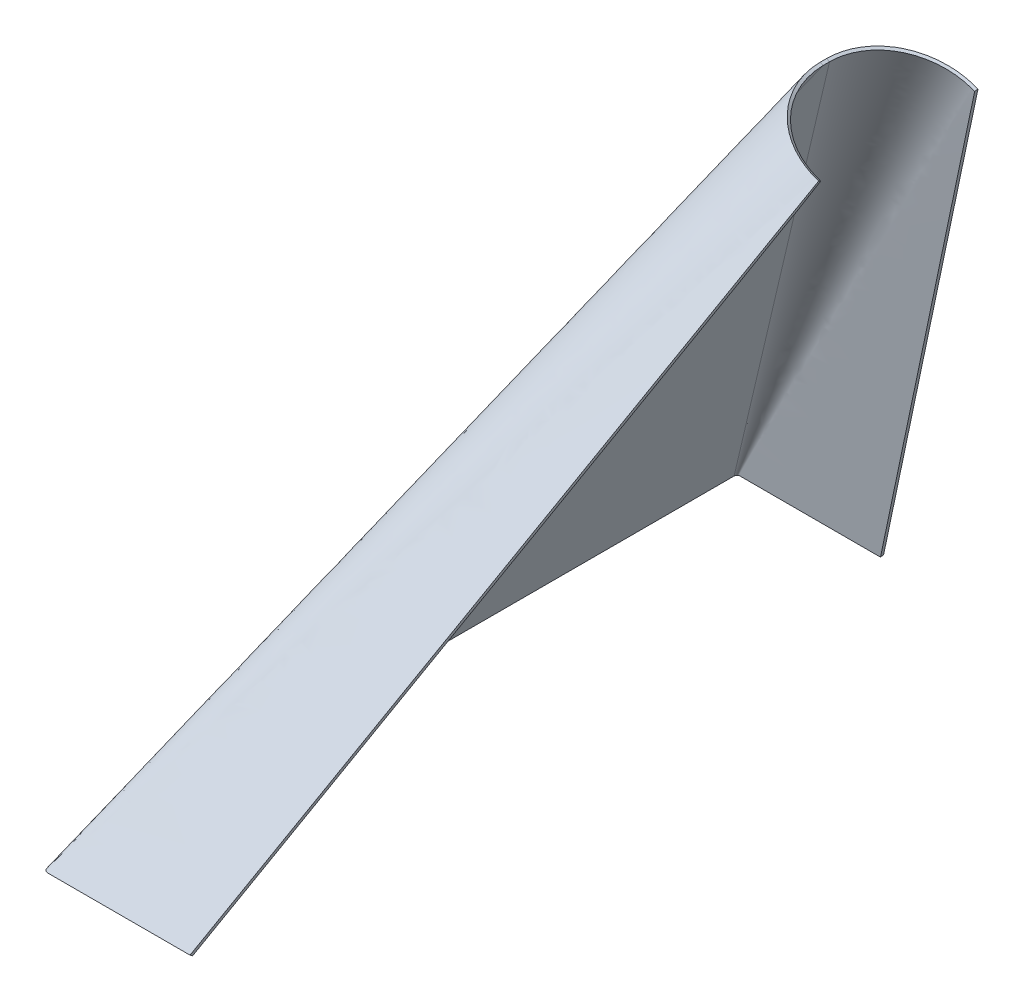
ISO-10303-21;
HEADER;
FILE_DESCRIPTION(('STEP AP214'),'2;1');
FILE_NAME('part.step','',(''),(''),'','','');
FILE_SCHEMA(('AUTOMOTIVE_DESIGN { 1 0 10303 214 1 1 1 1 }'));
ENDSEC;
DATA;
#1=APPLICATION_CONTEXT('core data for automotive mechanical design processes');
#2=APPLICATION_PROTOCOL_DEFINITION('international standard','automotive_design',2000,#1);
#3=PRODUCT_CONTEXT('',#1,'mechanical');
#4=PRODUCT('Part','Part','',(#3));
#5=PRODUCT_RELATED_PRODUCT_CATEGORY('part','',(#4));
#6=PRODUCT_DEFINITION_FORMATION('','',#4);
#7=PRODUCT_DEFINITION_CONTEXT('part definition',#1,'design');
#8=PRODUCT_DEFINITION('design','',#6,#7);
#9=PRODUCT_DEFINITION_SHAPE('','',#8);
#10=(LENGTH_UNIT() NAMED_UNIT(*) SI_UNIT(.MILLI.,.METRE.));
#11=(NAMED_UNIT(*) PLANE_ANGLE_UNIT() SI_UNIT($,.RADIAN.));
#12=(NAMED_UNIT(*) SI_UNIT($,.STERADIAN.) SOLID_ANGLE_UNIT());
#13=UNCERTAINTY_MEASURE_WITH_UNIT(LENGTH_MEASURE(1.E-05),#10,'distance_accuracy_value','');
#14=(GEOMETRIC_REPRESENTATION_CONTEXT(3) GLOBAL_UNCERTAINTY_ASSIGNED_CONTEXT((#13)) GLOBAL_UNIT_ASSIGNED_CONTEXT((#10,
#11,#12)) REPRESENTATION_CONTEXT('',''));
#15=CARTESIAN_POINT('',(0.,0.,0.));
#16=DIRECTION('',(0.,0.,1.));
#17=DIRECTION('',(1.,0.,0.));
#18=AXIS2_PLACEMENT_3D('',#15,#16,#17);
#19=CARTESIAN_POINT('',(-135.785085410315,-1.27641637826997,-321.5));
#20=CARTESIAN_POINT('',(-135.804633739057,-1.31799532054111,-321.629796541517));
#21=CARTESIAN_POINT('',(-135.808948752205,-1.35087482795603,-321.776125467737));
#22=CARTESIAN_POINT('',(-135.780939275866,-1.40260921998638,-322.074193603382));
#23=CARTESIAN_POINT('',(-135.749485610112,-1.4214357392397,-322.22413680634));
#24=CARTESIAN_POINT('',(-135.645868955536,-1.44182338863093,-322.51594398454));
#25=CARTESIAN_POINT('',(-135.571090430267,-1.44341897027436,-322.663282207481));
#26=CARTESIAN_POINT('',(-135.389156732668,-1.42763384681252,-322.925842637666));
#27=CARTESIAN_POINT('',(-135.276081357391,-1.4108478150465,-323.050529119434));
#28=CARTESIAN_POINT('',(-135.030201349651,-1.35551915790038,-323.255753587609));
#29=CARTESIAN_POINT('',(-134.890298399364,-1.31871291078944,-323.344761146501));
#30=CARTESIAN_POINT('',(-134.607290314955,-1.22143583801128,-323.475475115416));
#31=CARTESIAN_POINT('',(-134.454679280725,-1.16450407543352,-323.5249612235));
#32=CARTESIAN_POINT('',(-134.169787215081,-1.023506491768,-323.578357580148));
#33=CARTESIAN_POINT('',(-134.025596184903,-0.944697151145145,-323.589872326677));
#34=CARTESIAN_POINT('',(-133.817826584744,-0.815114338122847,-323.5889905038));
#35=CARTESIAN_POINT('',(-133.750052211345,-0.769990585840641,-323.585664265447));
#36=CARTESIAN_POINT('',(-133.652568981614,-0.699136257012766,-323.576897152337));
#37=CARTESIAN_POINT('',(-133.620774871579,-0.674986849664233,-323.573347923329));
#38=CARTESIAN_POINT('',(-133.574412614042,-0.637900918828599,-323.567215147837));
#39=CARTESIAN_POINT('',(-133.559180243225,-0.625395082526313,-323.565036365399));
#40=CARTESIAN_POINT('',(-133.542320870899,-0.611156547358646,-323.562448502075));
#41=CARTESIAN_POINT('',(-133.540451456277,-0.609572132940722,-323.562159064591));
#42=CARTESIAN_POINT('',(-133.536720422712,-0.606398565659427,-323.561576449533));
#43=CARTESIAN_POINT('',(-133.533633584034,-0.605613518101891,-323.56146526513));
#44=CARTESIAN_POINT('',(-133.537424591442,-0.597760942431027,-323.559796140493));
#45=CARTESIAN_POINT('',(-133.541267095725,-0.592316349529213,-323.558652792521));
#46=CARTESIAN_POINT('',(-133.538620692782,-0.584811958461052,-323.557173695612));
#47=CARTESIAN_POINT('',(-133.532878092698,-0.582321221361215,-323.556722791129));
#48=CARTESIAN_POINT('',(-133.47844399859,-0.573631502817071,-323.555215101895));
#49=CARTESIAN_POINT('',(-133.360378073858,-0.574170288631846,-323.555457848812));
#50=CARTESIAN_POINT('',(-131.951338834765,-0.57427645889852,-323.555478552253));
#51=CARTESIAN_POINT('',(-130.659486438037,-0.574315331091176,-323.555486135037));
#52=CARTESIAN_POINT('',(-128.629108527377,-0.574347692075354,-323.555492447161));
#53=CARTESIAN_POINT('',(-127.93688267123,-0.574354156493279,-323.555493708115));
#54=CARTESIAN_POINT('',(-126.547286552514,-0.574365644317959,-323.555495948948));
#55=CARTESIAN_POINT('',(-125.8515625,-0.574371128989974,-323.555497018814));
#56=CARTESIAN_POINT('',(-122.375,-0.574399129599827,-323.555502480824));
#57=CARTESIAN_POINT('',(-119.59375,-0.574421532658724,-323.555506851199));
#58=CARTESIAN_POINT('',(-111.25,-0.574488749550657,-323.555519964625));
#59=CARTESIAN_POINT('',(-105.6875,-0.574533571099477,-323.555528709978));
#60=CARTESIAN_POINT('',(-89.,-0.574668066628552,-323.555554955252));
#61=CARTESIAN_POINT('',(-77.875,-0.574757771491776,-323.555572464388));
#62=CARTESIAN_POINT('',(-44.5000000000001,-0.575027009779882,-323.555625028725));
#63=CARTESIAN_POINT('',(-22.25,-0.575206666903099,-323.555660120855));
#64=CARTESIAN_POINT('',(0.,-0.575386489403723,-323.555695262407));
#65=CARTESIAN_POINT('',(-138.5,0.,-321.5));
#66=CARTESIAN_POINT('',(-138.5,0.,-321.794627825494));
#67=CARTESIAN_POINT('',(-138.473151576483,0.,-322.100875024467));
#68=CARTESIAN_POINT('',(-138.358538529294,0.,-322.719926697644));
#69=CARTESIAN_POINT('',(-138.270773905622,0.,-323.03273117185));
#70=CARTESIAN_POINT('',(-138.027109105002,0.,-323.648215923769));
#71=CARTESIAN_POINT('',(-137.871858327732,0.,-323.95020158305));
#72=CARTESIAN_POINT('',(-137.498096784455,0.,-324.521895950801));
#73=CARTESIAN_POINT('',(-137.279611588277,0.,-324.791456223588));
#74=CARTESIAN_POINT('',(-136.791456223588,0.,-325.279611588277));
#75=CARTESIAN_POINT('',(-136.521895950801,0.,-325.498096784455));
#76=CARTESIAN_POINT('',(-135.95020158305,0.,-325.871858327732));
#77=CARTESIAN_POINT('',(-135.648215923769,0.,-326.027109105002));
#78=CARTESIAN_POINT('',(-135.03273117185,0.,-326.270773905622));
#79=CARTESIAN_POINT('',(-134.719926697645,0.,-326.358538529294));
#80=CARTESIAN_POINT('',(-134.255637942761,0.,-326.444498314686));
#81=CARTESIAN_POINT('',(-134.101694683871,0.,-326.465537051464));
#82=CARTESIAN_POINT('',(-133.873573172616,0.,-326.486350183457));
#83=CARTESIAN_POINT('',(-133.797998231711,0.,-326.491497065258));
#84=CARTESIAN_POINT('',(-133.68552965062,0.,-326.496615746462));
#85=CARTESIAN_POINT('',(-133.648189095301,0.,-326.497888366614));
#86=CARTESIAN_POINT('',(-133.606366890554,0.,-326.498840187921));
#87=CARTESIAN_POINT('',(-133.601722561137,0.,-326.498939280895));
#88=CARTESIAN_POINT('',(-133.592439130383,0.,-326.499124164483));
#89=CARTESIAN_POINT('',(-133.587954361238,0.,-326.499209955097));
#90=CARTESIAN_POINT('',(-133.578167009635,0.,-326.499368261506));
#91=CARTESIAN_POINT('',(-133.572632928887,0.,-326.4994407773));
#92=CARTESIAN_POINT('',(-133.557068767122,0.,-326.499572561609));
#93=CARTESIAN_POINT('',(-133.547038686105,0.,-326.499631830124));
#94=CARTESIAN_POINT('',(-133.477610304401,0.,-326.499895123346));
#95=CARTESIAN_POINT('',(-133.360378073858,0.,-326.5));
#96=CARTESIAN_POINT('',(-131.951338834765,0.,-326.5));
#97=CARTESIAN_POINT('',(-130.659486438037,0.,-326.5));
#98=CARTESIAN_POINT('',(-128.629108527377,0.,-326.5));
#99=CARTESIAN_POINT('',(-127.93688267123,0.,-326.5));
#100=CARTESIAN_POINT('',(-126.547286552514,0.,-326.5));
#101=CARTESIAN_POINT('',(-125.8515625,0.,-326.5));
#102=CARTESIAN_POINT('',(-122.375,0.,-326.5));
#103=CARTESIAN_POINT('',(-119.59375,0.,-326.5));
#104=CARTESIAN_POINT('',(-111.25,0.,-326.5));
#105=CARTESIAN_POINT('',(-105.6875,0.,-326.5));
#106=CARTESIAN_POINT('',(-89.,0.,-326.5));
#107=CARTESIAN_POINT('',(-77.875,0.,-326.5));
#108=CARTESIAN_POINT('',(-44.5000000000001,0.,-326.5));
#109=CARTESIAN_POINT('',(-22.25,0.,-326.5));
#110=CARTESIAN_POINT('',(0.,0.,-326.5));
#111=B_SPLINE_SURFACE_WITH_KNOTS('',1,3,((#19,#20,#21,#22,#23,#24,#25,#26,#27,#28,#29,#30,#31,
#32,#33,#34,#35,#36,#37,#38,#39,#40,#41,#42,#43,#44,#45,#46,#47,#48,#49,#50,#51,#52,#53,#54,#55,
#56,#57,#58,#59,#60,#61,#62,#63,#64),(#65,#66,#67,#68,#69,#70,#71,#72,#73,#74,#75,#76,#77,#78,
#79,#80,#81,#82,#83,#84,#85,#86,#87,#88,#89,#90,#91,#92,#93,#94,#95,#96,#97,#98,#99,#100,#101,
#102,#103,#104,#105,#106,#107,#108,#109,#110)),.UNSPECIFIED.,.F.,.F.,.F.,(2,2),(4,2,2,2,2,2,2,2,
2,2,2,2,2,2,2,2,2,2,2,2,2,2,4),(0.,1.),(0.,0.0625,0.125,0.1875,0.25,0.3125,0.375,0.4375,0.46875,
0.484375,0.4921875,0.4931640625,0.494140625,0.4951171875,0.49609375,0.5,0.515625,0.5234375,
0.53125,0.5625,0.625,0.75,1.),.UNSPECIFIED.);
#112=CARTESIAN_POINT('',(-135.785085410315,-1.27641637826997,-321.5));
#113=CARTESIAN_POINT('',(-138.5,0.,-321.5));
#114=B_SPLINE_CURVE_WITH_KNOTS('',1,(#112,#113),.UNSPECIFIED.,.F.,.F.,(2,2),(0.,1.),.UNSPECIFIED.);
#115=CARTESIAN_POINT('',(-138.5,0.,-321.5));
#116=VERTEX_POINT('',#115);
#117=CARTESIAN_POINT('',(-135.785085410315,-1.27641637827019,-321.5));
#118=VERTEX_POINT('',#117);
#119=EDGE_CURVE('E14',#116,#118,#114,.F.);
#120=CARTESIAN_POINT('',(-138.5,0.,-321.5));
#121=CARTESIAN_POINT('',(-138.5,0.,-321.794627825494));
#122=CARTESIAN_POINT('',(-138.473151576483,0.,-322.100875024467));
#123=CARTESIAN_POINT('',(-138.358538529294,0.,-322.719926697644));
#124=CARTESIAN_POINT('',(-138.270773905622,0.,-323.03273117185));
#125=CARTESIAN_POINT('',(-138.027109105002,0.,-323.648215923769));
#126=CARTESIAN_POINT('',(-137.871858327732,0.,-323.95020158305));
#127=CARTESIAN_POINT('',(-137.498096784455,0.,-324.521895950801));
#128=CARTESIAN_POINT('',(-137.279611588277,0.,-324.791456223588));
#129=CARTESIAN_POINT('',(-136.791456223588,0.,-325.279611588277));
#130=CARTESIAN_POINT('',(-136.521895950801,0.,-325.498096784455));
#131=CARTESIAN_POINT('',(-135.95020158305,0.,-325.871858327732));
#132=CARTESIAN_POINT('',(-135.648215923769,0.,-326.027109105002));
#133=CARTESIAN_POINT('',(-135.03273117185,0.,-326.270773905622));
#134=CARTESIAN_POINT('',(-134.719926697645,0.,-326.358538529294));
#135=CARTESIAN_POINT('',(-134.255637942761,0.,-326.444498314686));
#136=CARTESIAN_POINT('',(-134.101694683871,0.,-326.465537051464));
#137=CARTESIAN_POINT('',(-133.873573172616,0.,-326.486350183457));
#138=CARTESIAN_POINT('',(-133.797998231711,0.,-326.491497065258));
#139=CARTESIAN_POINT('',(-133.68552965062,0.,-326.496615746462));
#140=CARTESIAN_POINT('',(-133.648189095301,0.,-326.497888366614));
#141=CARTESIAN_POINT('',(-133.606366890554,0.,-326.498840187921));
#142=CARTESIAN_POINT('',(-133.601722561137,0.,-326.498939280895));
#143=CARTESIAN_POINT('',(-133.592439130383,0.,-326.499124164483));
#144=CARTESIAN_POINT('',(-133.587954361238,0.,-326.499209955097));
#145=CARTESIAN_POINT('',(-133.578167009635,0.,-326.499368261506));
#146=CARTESIAN_POINT('',(-133.572632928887,0.,-326.4994407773));
#147=CARTESIAN_POINT('',(-133.557068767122,0.,-326.499572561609));
#148=CARTESIAN_POINT('',(-133.547038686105,0.,-326.499631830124));
#149=CARTESIAN_POINT('',(-133.477610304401,0.,-326.499895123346));
#150=CARTESIAN_POINT('',(-133.360378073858,0.,-326.5));
#151=CARTESIAN_POINT('',(-131.951338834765,0.,-326.5));
#152=CARTESIAN_POINT('',(-130.659486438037,0.,-326.5));
#153=CARTESIAN_POINT('',(-128.629108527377,0.,-326.5));
#154=CARTESIAN_POINT('',(-127.93688267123,0.,-326.5));
#155=CARTESIAN_POINT('',(-126.547286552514,0.,-326.5));
#156=CARTESIAN_POINT('',(-125.8515625,0.,-326.5));
#157=CARTESIAN_POINT('',(-122.375,0.,-326.5));
#158=CARTESIAN_POINT('',(-119.59375,0.,-326.5));
#159=CARTESIAN_POINT('',(-111.25,0.,-326.5));
#160=CARTESIAN_POINT('',(-105.6875,0.,-326.5));
#161=CARTESIAN_POINT('',(-89.,0.,-326.5));
#162=CARTESIAN_POINT('',(-77.875,0.,-326.5));
#163=CARTESIAN_POINT('',(-44.5000000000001,0.,-326.5));
#164=CARTESIAN_POINT('',(-22.25,0.,-326.5));
#165=CARTESIAN_POINT('',(0.,0.,-326.5));
#166=B_SPLINE_CURVE_WITH_KNOTS('',3,(#120,#121,#122,#123,#124,#125,#126,#127,#128,#129,#130,
#131,#132,#133,#134,#135,#136,#137,#138,#139,#140,#141,#142,#143,#144,#145,#146,#147,#148,#149,
#150,#151,#152,#153,#154,#155,#156,#157,#158,#159,#160,#161,#162,#163,#164,#165),.UNSPECIFIED.,
.F.,.F.,(4,2,2,2,2,2,2,2,2,2,2,2,2,2,2,2,2,2,2,2,2,2,4),(0.,0.0625,0.125,0.1875,0.25,0.3125,
0.375,0.4375,0.46875,0.484375,0.4921875,0.4931640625,0.494140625,0.4951171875,0.49609375,0.5,
0.515625,0.5234375,0.53125,0.5625,0.625,0.75,1.),.UNSPECIFIED.);
#167=CARTESIAN_POINT('',(0.,0.,-326.5));
#168=VERTEX_POINT('',#167);
#169=EDGE_CURVE('E536',#116,#168,#166,.T.);
#170=CARTESIAN_POINT('',(0.,0.,-326.5));
#171=CARTESIAN_POINT('',(0.,-0.575386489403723,-323.555695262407));
#172=B_SPLINE_CURVE_WITH_KNOTS('',1,(#170,#171),.UNSPECIFIED.,.F.,.F.,(2,2),(0.,1.),.UNSPECIFIED.);
#173=CARTESIAN_POINT('',(0.,-0.575386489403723,-323.555695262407));
#174=VERTEX_POINT('',#173);
#175=EDGE_CURVE('E84',#168,#174,#172,.T.);
#176=CARTESIAN_POINT('',(-135.785085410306,-1.27641637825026,-321.5));
#177=CARTESIAN_POINT('',(-135.78755091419,-1.28165978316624,-321.516374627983));
#178=CARTESIAN_POINT('',(-135.789754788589,-1.28670926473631,-321.532848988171));
#179=CARTESIAN_POINT('',(-135.793688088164,-1.29654749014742,-321.566266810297));
#180=CARTESIAN_POINT('',(-135.795408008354,-1.30132970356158,-321.58321331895));
#181=CARTESIAN_POINT('',(-135.798355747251,-1.31064467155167,-321.617514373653));
#182=CARTESIAN_POINT('',(-135.799575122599,-1.31517211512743,-321.634871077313));
#183=CARTESIAN_POINT('',(-135.801505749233,-1.32398470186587,-321.669935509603));
#184=CARTESIAN_POINT('',(-135.802209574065,-1.32826551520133,-321.687644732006));
#185=CARTESIAN_POINT('',(-135.803095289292,-1.33659096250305,-321.723358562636));
#186=CARTESIAN_POINT('',(-135.803270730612,-1.3406320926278,-321.741364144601));
#187=CARTESIAN_POINT('',(-135.803087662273,-1.34848254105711,-321.777617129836));
#188=CARTESIAN_POINT('',(-135.802723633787,-1.35228904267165,-321.795865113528));
#189=CARTESIAN_POINT('',(-135.801451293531,-1.35967317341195,-321.832551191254));
#190=CARTESIAN_POINT('',(-135.800538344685,-1.3632485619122,-321.85098957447));
#191=CARTESIAN_POINT('',(-135.798159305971,-1.37017193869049,-321.88800664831));
#192=CARTESIAN_POINT('',(-135.79668941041,-1.37351817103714,-321.906585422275));
#193=CARTESIAN_POINT('',(-135.793189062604,-1.37998352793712,-321.943835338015));
#194=CARTESIAN_POINT('',(-135.791155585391,-1.38310130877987,-321.962506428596));
#195=CARTESIAN_POINT('',(-135.786521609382,-1.38910827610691,-321.999894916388));
#196=CARTESIAN_POINT('',(-135.783918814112,-1.39199647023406,-322.018612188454));
#197=CARTESIAN_POINT('',(-135.778140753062,-1.39754142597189,-322.056048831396));
#198=CARTESIAN_POINT('',(-135.774963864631,-1.40019749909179,-322.074768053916));
#199=CARTESIAN_POINT('',(-135.768033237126,-1.40527444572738,-322.112166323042));
#200=CARTESIAN_POINT('',(-135.764278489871,-1.40769489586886,-322.130845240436));
#201=CARTESIAN_POINT('',(-135.756188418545,-1.41229530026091,-322.168122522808));
#202=CARTESIAN_POINT('',(-135.751852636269,-1.41447506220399,-322.18672081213));
#203=CARTESIAN_POINT('',(-135.742598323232,-1.41858962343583,-322.22379865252));
#204=CARTESIAN_POINT('',(-135.737679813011,-1.42052443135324,-322.242278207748));
#205=CARTESIAN_POINT('',(-135.727255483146,-1.42413693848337,-322.279081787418));
#206=CARTESIAN_POINT('',(-135.721750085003,-1.42581482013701,-322.297405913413));
#207=CARTESIAN_POINT('',(-135.710159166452,-1.4289256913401,-322.333866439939));
#208=CARTESIAN_POINT('',(-135.704074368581,-1.43035897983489,-322.352003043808));
#209=CARTESIAN_POINT('',(-135.691167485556,-1.43292252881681,-322.388395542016));
#210=CARTESIAN_POINT('',(-135.684334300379,-1.43404700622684,-322.406647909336));
#211=CARTESIAN_POINT('',(-135.669997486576,-1.4360336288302,-322.443132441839));
#212=CARTESIAN_POINT('',(-135.662487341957,-1.43689276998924,-322.461362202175));
#213=CARTESIAN_POINT('',(-135.646805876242,-1.43833696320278,-322.497728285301));
#214=CARTESIAN_POINT('',(-135.638629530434,-1.43891965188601,-322.515862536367));
#215=CARTESIAN_POINT('',(-135.621638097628,-1.43981314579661,-322.551968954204));
#216=CARTESIAN_POINT('',(-135.612819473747,-1.4401222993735,-322.569939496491));
#217=CARTESIAN_POINT('',(-135.594565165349,-1.44046479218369,-322.605651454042));
#218=CARTESIAN_POINT('',(-135.585127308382,-1.44049710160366,-322.623391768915));
#219=CARTESIAN_POINT('',(-135.565659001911,-1.44028102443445,-322.658578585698));
#220=CARTESIAN_POINT('',(-135.555627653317,-1.44003220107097,-322.676024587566));
#221=CARTESIAN_POINT('',(-135.534998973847,-1.43924781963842,-322.71056060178));
#222=CARTESIAN_POINT('',(-135.524401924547,-1.43871240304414,-322.727650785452));
#223=CARTESIAN_POINT('',(-135.502669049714,-1.43734329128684,-322.761414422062));
#224=CARTESIAN_POINT('',(-135.491534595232,-1.43651032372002,-322.778088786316));
#225=CARTESIAN_POINT('',(-135.468691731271,-1.43454069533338,-322.811066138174));
#226=CARTESIAN_POINT('',(-135.456982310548,-1.43340348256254,-322.827368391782));
#227=CARTESIAN_POINT('',(-135.432932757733,-1.43084818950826,-322.859716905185));
#228=CARTESIAN_POINT('',(-135.420587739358,-1.42942757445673,-322.875759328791));
#229=CARTESIAN_POINT('',(-135.39530419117,-1.42629531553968,-322.907518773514));
#230=CARTESIAN_POINT('',(-135.382362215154,-1.42458177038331,-322.923232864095));
#231=CARTESIAN_POINT('',(-135.355928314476,-1.42086070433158,-322.954271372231));
#232=CARTESIAN_POINT('',(-135.342434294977,-1.41885197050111,-322.969593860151));
#233=CARTESIAN_POINT('',(-135.314941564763,-1.41453330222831,-322.999786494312));
#234=CARTESIAN_POINT('',(-135.300941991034,-1.41222283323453,-323.014655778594));
#235=CARTESIAN_POINT('',(-135.272485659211,-1.40728965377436,-323.043880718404));
#236=CARTESIAN_POINT('',(-135.258029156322,-1.40466711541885,-323.058236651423));
#237=CARTESIAN_POINT('',(-135.228710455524,-1.39910296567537,-323.086379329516));
#238=CARTESIAN_POINT('',(-135.213849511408,-1.39616227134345,-323.10016756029));
#239=CARTESIAN_POINT('',(-135.183770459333,-1.38992794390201,-323.12710907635));
#240=CARTESIAN_POINT('',(-135.168554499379,-1.38663614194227,-323.140265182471));
#241=CARTESIAN_POINT('',(-135.137711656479,-1.3797271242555,-323.166031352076));
#242=CARTESIAN_POINT('',(-135.122084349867,-1.37610956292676,-323.178640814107));
#243=CARTESIAN_POINT('',(-135.090365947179,-1.36859299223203,-323.203415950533));
#244=CARTESIAN_POINT('',(-135.074272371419,-1.36469219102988,-323.215577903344));
#245=CARTESIAN_POINT('',(-135.041672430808,-1.35658383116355,-323.239399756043));
#246=CARTESIAN_POINT('',(-135.025164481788,-1.35237491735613,-323.251057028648));
#247=CARTESIAN_POINT('',(-134.991794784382,-1.34364702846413,-323.273825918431));
#248=CARTESIAN_POINT('',(-134.974932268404,-1.33912731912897,-323.284936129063));
#249=CARTESIAN_POINT('',(-134.940913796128,-1.32976664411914,-323.306566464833));
#250=CARTESIAN_POINT('',(-134.923757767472,-1.324925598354,-323.317086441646));
#251=CARTESIAN_POINT('',(-134.889215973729,-1.31490593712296,-323.337492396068));
#252=CARTESIAN_POINT('',(-134.871830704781,-1.30972797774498,-323.347379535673));
#253=CARTESIAN_POINT('',(-134.836896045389,-1.29903009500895,-323.366487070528));
#254=CARTESIAN_POINT('',(-134.819347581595,-1.29351161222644,-323.375709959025));
#255=CARTESIAN_POINT('',(-134.784158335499,-1.28207054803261,-323.393425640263));
#256=CARTESIAN_POINT('',(-134.766518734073,-1.27615058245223,-323.40192247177));
#257=CARTESIAN_POINT('',(-134.731056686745,-1.263993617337,-323.418319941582));
#258=CARTESIAN_POINT('',(-134.713234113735,-1.25775638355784,-323.42622012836));
#259=CARTESIAN_POINT('',(-134.677362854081,-1.24499961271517,-323.441493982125));
#260=CARTESIAN_POINT('',(-134.65931351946,-1.23847896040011,-323.448865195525));
#261=CARTESIAN_POINT('',(-134.623046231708,-1.22512995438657,-323.463048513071));
#262=CARTESIAN_POINT('',(-134.604827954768,-1.21830081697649,-323.469859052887));
#263=CARTESIAN_POINT('',(-134.568281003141,-1.20433124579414,-323.48290482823));
#264=CARTESIAN_POINT('',(-134.549952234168,-1.19719049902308,-323.489139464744));
#265=CARTESIAN_POINT('',(-134.513246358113,-1.18258406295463,-323.501014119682));
#266=CARTESIAN_POINT('',(-134.494869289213,-1.17511858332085,-323.506654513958));
#267=CARTESIAN_POINT('',(-134.458129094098,-1.15985437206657,-323.517327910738));
#268=CARTESIAN_POINT('',(-134.439766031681,-1.1520564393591,-323.522362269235));
#269=CARTESIAN_POINT('',(-134.403127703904,-1.13609440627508,-323.53180005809));
#270=CARTESIAN_POINT('',(-134.384852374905,-1.12793184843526,-323.53620586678));
#271=CARTESIAN_POINT('',(-134.348433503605,-1.11128628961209,-323.544413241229));
#272=CARTESIAN_POINT('',(-134.330289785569,-1.10280527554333,-323.5482179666));
#273=CARTESIAN_POINT('',(-134.294351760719,-1.08529054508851,-323.555067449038));
#274=CARTESIAN_POINT('',(-134.276555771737,-1.07626298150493,-323.558119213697));
#275=CARTESIAN_POINT('',(-134.240903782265,-1.05805288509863,-323.563820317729));
#276=CARTESIAN_POINT('',(-134.223047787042,-1.04886992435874,-323.566468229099));
#277=CARTESIAN_POINT('',(-134.169423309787,-1.02087796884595,-323.573733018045));
#278=CARTESIAN_POINT('',(-134.133747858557,-1.00169934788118,-323.577643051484));
#279=CARTESIAN_POINT('',(-134.062615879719,-0.962390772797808,-323.583777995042));
#280=CARTESIAN_POINT('',(-134.027160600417,-0.942257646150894,-323.58599679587));
#281=CARTESIAN_POINT('',(-133.956722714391,-0.901024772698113,-323.588824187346));
#282=CARTESIAN_POINT('',(-133.921740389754,-0.879924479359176,-323.589431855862));
#283=CARTESIAN_POINT('',(-133.852525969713,-0.836755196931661,-323.589137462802));
#284=CARTESIAN_POINT('',(-133.818291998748,-0.814689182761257,-323.588239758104));
#285=CARTESIAN_POINT('',(-133.750883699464,-0.769547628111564,-323.585043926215));
#286=CARTESIAN_POINT('',(-133.717703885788,-0.746479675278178,-323.582755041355));
#287=CARTESIAN_POINT('',(-133.668860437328,-0.710976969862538,-323.578362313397));
#288=CARTESIAN_POINT('',(-133.65279038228,-0.699037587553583,-323.576745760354));
#289=CARTESIAN_POINT('',(-133.621046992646,-0.674882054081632,-323.573219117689));
#290=CARTESIAN_POINT('',(-133.605371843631,-0.662668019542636,-323.571310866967));
#291=CARTESIAN_POINT('',(-133.5821533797,-0.644091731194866,-323.56823886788));
#292=CARTESIAN_POINT('',(-133.574482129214,-0.637873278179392,-323.567182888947));
#293=CARTESIAN_POINT('',(-133.563051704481,-0.628488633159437,-323.56555069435));
#294=CARTESIAN_POINT('',(-133.559259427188,-0.62535523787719,-323.564999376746));
#295=CARTESIAN_POINT('',(-133.553592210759,-0.620628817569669,-323.564158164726));
#296=CARTESIAN_POINT('',(-133.55170798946,-0.619050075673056,-323.56387559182));
#297=CARTESIAN_POINT('',(-133.547944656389,-0.615906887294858,-323.563310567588));
#298=CARTESIAN_POINT('',(-133.546065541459,-0.614342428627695,-323.563028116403));
#299=CARTESIAN_POINT('',(-133.54232454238,-0.611136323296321,-323.56244424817));
#300=CARTESIAN_POINT('',(-133.540462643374,-0.60949475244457,-323.562142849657));
#301=CARTESIAN_POINT('',(-133.537648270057,-0.607231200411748,-323.561730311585));
#302=CARTESIAN_POINT('',(-133.536706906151,-0.606510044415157,-323.561599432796));
#303=CARTESIAN_POINT('',(-133.535353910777,-0.605171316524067,-323.561348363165));
#304=CARTESIAN_POINT('',(-133.534922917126,-0.604697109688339,-323.561258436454));
#305=CARTESIAN_POINT('',(-133.534597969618,-0.603394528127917,-323.560996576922));
#306=CARTESIAN_POINT('',(-133.535082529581,-0.60250790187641,-323.560806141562));
#307=CARTESIAN_POINT('',(-133.536161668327,-0.600524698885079,-323.560382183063));
#308=CARTESIAN_POINT('',(-133.536717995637,-0.599494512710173,-323.560163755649));
#309=CARTESIAN_POINT('',(-133.53792204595,-0.597340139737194,-323.559708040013));
#310=CARTESIAN_POINT('',(-133.538573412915,-0.596214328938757,-323.559470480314));
#311=CARTESIAN_POINT('',(-133.540014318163,-0.592898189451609,-323.558782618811));
#312=CARTESIAN_POINT('',(-133.540624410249,-0.590488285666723,-323.558293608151));
#313=CARTESIAN_POINT('',(-133.539195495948,-0.586448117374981,-323.557494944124));
#314=CARTESIAN_POINT('',(-133.536886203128,-0.584919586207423,-323.557208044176));
#315=CARTESIAN_POINT('',(-133.530411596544,-0.581809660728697,-323.556630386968));
#316=CARTESIAN_POINT('',(-133.526234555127,-0.581157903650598,-323.556518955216));
#317=CARTESIAN_POINT('',(-133.515349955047,-0.579683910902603,-323.556268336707));
#318=CARTESIAN_POINT('',(-133.508546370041,-0.578973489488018,-323.556149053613));
#319=CARTESIAN_POINT('',(-133.492260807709,-0.577712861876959,-323.555943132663));
#320=CARTESIAN_POINT('',(-133.482795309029,-0.577340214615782,-323.555888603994));
#321=CARTESIAN_POINT('',(-133.460854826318,-0.576615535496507,-323.555783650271));
#322=CARTESIAN_POINT('',(-133.448369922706,-0.576306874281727,-323.555739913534));
#323=CARTESIAN_POINT('',(-133.420104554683,-0.57576223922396,-323.555665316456));
#324=CARTESIAN_POINT('',(-133.404326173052,-0.575567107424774,-323.555640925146));
#325=CARTESIAN_POINT('',(-133.345678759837,-0.574963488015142,-323.555566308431));
#326=CARTESIAN_POINT('',(-133.302801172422,-0.574763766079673,-323.555543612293));
#327=CARTESIAN_POINT('',(-133.199471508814,-0.574391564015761,-323.555496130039));
#328=CARTESIAN_POINT('',(-133.139021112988,-0.574263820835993,-323.555474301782));
#329=CARTESIAN_POINT('',(-132.935163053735,-0.574020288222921,-323.555432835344));
#330=CARTESIAN_POINT('',(-132.791752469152,-0.574161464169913,-323.555457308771));
#331=CARTESIAN_POINT('',(-132.500190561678,-0.574283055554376,-323.555478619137));
#332=CARTESIAN_POINT('',(-132.352039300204,-0.574258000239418,-323.55547451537));
#333=CARTESIAN_POINT('',(-131.89496515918,-0.574224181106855,-323.555469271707));
#334=CARTESIAN_POINT('',(-131.586041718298,-0.574262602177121,-323.555476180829));
#335=CARTESIAN_POINT('',(-130.620045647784,-0.574341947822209,-323.555490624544));
#336=CARTESIAN_POINT('',(-129.962973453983,-0.574336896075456,-323.55549008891));
#337=CARTESIAN_POINT('',(-127.922684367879,-0.574336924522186,-323.555490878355));
#338=CARTESIAN_POINT('',(-126.539467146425,-0.57435937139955,-323.555494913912));
#339=CARTESIAN_POINT('',(-122.374999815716,-0.574411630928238,-323.555504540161));
#340=CARTESIAN_POINT('',(-119.593749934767,-0.574425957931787,-323.555507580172));
#341=CARTESIAN_POINT('',(-111.250000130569,-0.574479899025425,-323.555518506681));
#342=CARTESIAN_POINT('',(-105.687500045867,-0.574530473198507,-323.555528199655));
#343=CARTESIAN_POINT('',(-88.999999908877,-0.57467426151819,-323.555555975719));
#344=CARTESIAN_POINT('',(-77.8749999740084,-0.574759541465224,-323.555572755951));
#345=CARTESIAN_POINT('',(-55.6250000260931,-0.574935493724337,-323.555607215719));
#346=CARTESIAN_POINT('',(-44.5000000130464,-0.575026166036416,-323.555624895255));
#347=CARTESIAN_POINT('',(-22.249999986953,-0.575207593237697,-323.555660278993));
#348=CARTESIAN_POINT('',(-11.1249999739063,-0.575298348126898,-323.555677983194));
#349=CARTESIAN_POINT('',(0.,-0.575386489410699,-323.555695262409));
#350=B_SPLINE_CURVE_WITH_KNOTS('',3,(#176,#177,#178,#179,#180,#181,#182,#183,#184,#185,#186,
#187,#188,#189,#190,#191,#192,#193,#194,#195,#196,#197,#198,#199,#200,#201,#202,#203,#204,#205,
#206,#207,#208,#209,#210,#211,#212,#213,#214,#215,#216,#217,#218,#219,#220,#221,#222,#223,#224,
#225,#226,#227,#228,#229,#230,#231,#232,#233,#234,#235,#236,#237,#238,#239,#240,#241,#242,#243,
#244,#245,#246,#247,#248,#249,#250,#251,#252,#253,#254,#255,#256,#257,#258,#259,#260,#261,#262,
#263,#264,#265,#266,#267,#268,#269,#270,#271,#272,#273,#274,#275,#276,#277,#278,#279,#280,#281,
#282,#283,#284,#285,#286,#287,#288,#289,#290,#291,#292,#293,#294,#295,#296,#297,#298,#299,#300,
#301,#302,#303,#304,#305,#306,#307,#308,#309,#310,#311,#312,#313,#314,#315,#316,#317,#318,#319,
#320,#321,#322,#323,#324,#325,#326,#327,#328,#329,#330,#331,#332,#333,#334,#335,#336,#337,#338,
#339,#340,#341,#342,#343,#344,#345,#346,#347,#348,#349),.UNSPECIFIED.,.F.,.F.,(4,2,2,2,2,2,2,2,
2,2,2,2,2,2,2,2,2,2,2,2,2,2,2,2,2,2,2,2,2,2,2,2,2,2,2,2,2,2,2,2,2,2,2,2,2,2,2,2,2,2,2,2,2,2,2,2,
2,2,2,2,2,2,2,2,2,2,2,2,2,2,2,2,2,2,2,2,2,2,2,2,2,2,2,2,2,2,4),(0.,0.0521028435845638,
0.105167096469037,0.159092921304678,0.213781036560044,0.269133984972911,0.325057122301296,
0.381459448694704,0.438254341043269,0.495360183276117,0.552700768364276,0.610206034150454,
0.66781279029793,0.725465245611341,0.783115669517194,0.840724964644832,0.898263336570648,
0.95681532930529,1.01600778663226,1.07569754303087,1.13574530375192,1.19601633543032,
1.25638113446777,1.31671616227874,1.37690465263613,1.4372030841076,1.4980671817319,
1.55934246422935,1.62087695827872,1.68252198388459,1.74413316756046,1.80557126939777,
1.86670331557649,1.92790099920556,1.98952679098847,2.05144212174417,2.11350911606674,
2.17559163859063,2.23755668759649,2.29927551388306,2.36062500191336,2.42202046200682,
2.48368440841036,2.54551495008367,2.60740909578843,2.6692638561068,2.73097753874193,
2.79245113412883,2.85358999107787,2.91413634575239,2.97489205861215,3.09690962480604,
3.21936589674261,3.34189224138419,3.46406457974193,3.58543400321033,3.64568257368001,
3.70556590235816,3.73535598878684,3.75021055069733,3.75762740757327,3.76503719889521,
3.77243985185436,3.77613847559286,3.77790111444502,3.7805491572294,3.78430025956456,
3.78830679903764,3.79488371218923,3.80211659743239,3.81511661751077,3.83546342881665,
3.86394352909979,3.90138379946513,3.94873054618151,4.07735420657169,4.2587098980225,
4.68893718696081,5.13339211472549,6.06016158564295,8.03137882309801,12.1810299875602,
20.5247799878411,37.2122799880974,70.5872799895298,103.962279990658,137.337279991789),.UNSPECIFIED.);
#351=EDGE_CURVE('E143',#118,#174,#350,.T.);
#352=ORIENTED_EDGE('',*,*,#119,.F.);
#353=ORIENTED_EDGE('',*,*,#169,.T.);
#354=ORIENTED_EDGE('',*,*,#175,.T.);
#355=ORIENTED_EDGE('',*,*,#351,.F.);
#356=EDGE_LOOP('',(#352,#353,#354,#355));
#357=FACE_BOUND('',#356,.T.);
#358=ADVANCED_FACE('F72',(#357),#111,.T.);
#359=CARTESIAN_POINT('',(-1.11022302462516E-13,-0.575386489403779,-323.555695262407));
#360=CARTESIAN_POINT('',(31.9716410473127,87.2682587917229,-306.388978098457));
#361=CARTESIAN_POINT('',(63.9432493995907,175.111915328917,-289.222257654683));
#362=CARTESIAN_POINT('',(111.89759754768,306.878476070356,-263.471975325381));
#363=CARTESIAN_POINT('',(127.882266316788,350.800702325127,-254.888536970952));
#364=CARTESIAN_POINT('',(151.853845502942,416.685950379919,-242.013044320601));
#365=CARTESIAN_POINT('',(159.844020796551,438.64782151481,-237.721182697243));
#366=CARTESIAN_POINT('',(171.82066832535,471.593671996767,-231.282919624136));
#367=CARTESIAN_POINT('',(175.812008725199,482.5759281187,-229.136767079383));
#368=CARTESIAN_POINT('',(181.787630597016,499.053361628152,-225.917047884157));
#369=CARTESIAN_POINT('',(183.777927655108,504.546396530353,-224.843721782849));
#370=CARTESIAN_POINT('',(186.751944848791,512.790048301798,-223.233424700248));
#371=CARTESIAN_POINT('',(187.741428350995,515.538596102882,-222.696600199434));
#372=CARTESIAN_POINT('',(189.709585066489,521.039608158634,-221.62285822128));
#373=CARTESIAN_POINT('',(190.690175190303,523.791365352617,-221.085795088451));
#374=CARTESIAN_POINT('',(191.648943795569,526.551145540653,-220.549339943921));
#375=CARTESIAN_POINT('',(-1.11022302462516E-13,0.,-326.5));
#376=CARTESIAN_POINT('',(31.9723781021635,87.8433868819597,-309.333333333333));
#377=CARTESIAN_POINT('',(63.9447562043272,175.686773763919,-292.166666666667));
#378=CARTESIAN_POINT('',(111.903323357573,307.451854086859,-266.416666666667));
#379=CARTESIAN_POINT('',(127.889512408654,351.373547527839,-257.833333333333));
#380=CARTESIAN_POINT('',(151.868795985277,417.256087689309,-244.958333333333));
#381=CARTESIAN_POINT('',(159.861890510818,439.216934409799,-240.666666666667));
#382=CARTESIAN_POINT('',(171.851532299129,472.158204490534,-234.229166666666));
#383=CARTESIAN_POINT('',(175.8480795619,483.138627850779,-232.083333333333));
#384=CARTESIAN_POINT('',(181.842900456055,499.609262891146,-228.864583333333));
#385=CARTESIAN_POINT('',(183.841174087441,505.099474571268,-227.791666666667));
#386=CARTESIAN_POINT('',(186.838584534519,513.334792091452,-226.182291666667));
#387=CARTESIAN_POINT('',(187.837721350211,516.079897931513,-225.645833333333));
#388=CARTESIAN_POINT('',(189.835994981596,521.570109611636,-224.572916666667));
#389=CARTESIAN_POINT('',(190.835131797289,524.315215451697,-224.036458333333));
#390=CARTESIAN_POINT('',(191.834268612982,527.060321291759,-223.5));
#391=B_SPLINE_SURFACE_WITH_KNOTS('',1,3,((#359,#360,#361,#362,#363,#364,#365,#366,#367,#368,
#369,#370,#371,#372,#373,#374),(#375,#376,#377,#378,#379,#380,#381,#382,#383,#384,#385,#386,
#387,#388,#389,#390)),.UNSPECIFIED.,.F.,.F.,.F.,(2,2),(4,2,2,2,2,2,2,4),(0.,1.),
(-0.285132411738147,0.,0.142566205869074,0.21384930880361,0.249490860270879,0.267311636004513,
0.27622202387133,0.285132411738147),.UNSPECIFIED.);
#392=CARTESIAN_POINT('',(-1.11022302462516E-13,0.,-326.5));
#393=CARTESIAN_POINT('',(31.9723781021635,87.8433868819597,-309.333333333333));
#394=CARTESIAN_POINT('',(63.9447562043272,175.686773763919,-292.166666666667));
#395=CARTESIAN_POINT('',(111.903323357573,307.451854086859,-266.416666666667));
#396=CARTESIAN_POINT('',(127.889512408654,351.373547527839,-257.833333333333));
#397=CARTESIAN_POINT('',(151.868795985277,417.256087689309,-244.958333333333));
#398=CARTESIAN_POINT('',(159.861890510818,439.216934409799,-240.666666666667));
#399=CARTESIAN_POINT('',(171.851532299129,472.158204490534,-234.229166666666));
#400=CARTESIAN_POINT('',(175.8480795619,483.138627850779,-232.083333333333));
#401=CARTESIAN_POINT('',(181.842900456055,499.609262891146,-228.864583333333));
#402=CARTESIAN_POINT('',(183.841174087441,505.099474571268,-227.791666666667));
#403=CARTESIAN_POINT('',(186.838584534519,513.334792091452,-226.182291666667));
#404=CARTESIAN_POINT('',(187.837721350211,516.079897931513,-225.645833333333));
#405=CARTESIAN_POINT('',(189.835994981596,521.570109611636,-224.572916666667));
#406=CARTESIAN_POINT('',(190.835131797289,524.315215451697,-224.036458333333));
#407=CARTESIAN_POINT('',(191.834268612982,527.060321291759,-223.5));
#408=B_SPLINE_CURVE_WITH_KNOTS('',3,(#392,#393,#394,#395,#396,#397,#398,#399,#400,#401,#402,
#403,#404,#405,#406,#407),.UNSPECIFIED.,.F.,.F.,(4,2,2,2,2,2,2,4),(-0.285132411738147,0.,
0.142566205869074,0.21384930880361,0.249490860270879,0.267311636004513,0.27622202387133,
0.285132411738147),.UNSPECIFIED.);
#409=CARTESIAN_POINT('',(191.834268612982,527.060321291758,-223.5));
#410=VERTEX_POINT('',#409);
#411=EDGE_CURVE('E540',#168,#410,#408,.T.);
#412=CARTESIAN_POINT('',(191.834268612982,527.060321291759,-223.5));
#413=CARTESIAN_POINT('',(191.648943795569,526.551145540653,-220.549339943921));
#414=B_SPLINE_CURVE_WITH_KNOTS('',1,(#412,#413),.UNSPECIFIED.,.F.,.F.,(2,2),(0.,1.),.UNSPECIFIED.);
#415=CARTESIAN_POINT('',(191.648943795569,526.551145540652,-220.549339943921));
#416=VERTEX_POINT('',#415);
#417=EDGE_CURVE('E317',#410,#416,#414,.T.);
#418=CARTESIAN_POINT('',(0.,-0.575386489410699,-323.555695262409));
#419=CARTESIAN_POINT('',(7.99290736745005,21.3855258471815,-319.264015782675));
#420=CARTESIAN_POINT('',(15.9857976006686,43.3464441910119,-314.972335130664));
#421=CARTESIAN_POINT('',(31.9715103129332,87.2683046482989,-306.388969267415));
#422=CARTESIAN_POINT('',(39.9643327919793,109.229246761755,-302.097284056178));
#423=CARTESIAN_POINT('',(55.949876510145,153.151166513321,-293.513906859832));
#424=CARTESIAN_POINT('',(63.9425977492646,175.11214415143,-289.222214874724));
#425=CARTESIAN_POINT('',(79.9278716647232,219.034158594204,-280.638819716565));
#426=CARTESIAN_POINT('',(87.9204243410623,240.995195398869,-276.347116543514));
#427=CARTESIAN_POINT('',(99.90901007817,273.936836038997,-269.909545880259));
#428=CARTESIAN_POINT('',(103.905164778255,284.917397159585,-267.763686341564));
#429=CARTESIAN_POINT('',(111.897353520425,306.87856179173,-263.471959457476));
#430=CARTESIAN_POINT('',(115.89338756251,317.859165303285,-261.326092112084));
#431=CARTESIAN_POINT('',(123.885269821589,339.820437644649,-257.034345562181));
#432=CARTESIAN_POINT('',(127.881118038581,350.801106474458,-254.88846635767));
#433=CARTESIAN_POINT('',(135.872511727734,372.762550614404,-250.596688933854));
#434=CARTESIAN_POINT('',(139.868057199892,383.743325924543,-248.450790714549));
#435=CARTESIAN_POINT('',(145.860950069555,400.21463860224,-245.231917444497));
#436=CARTESIAN_POINT('',(147.858510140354,405.70510112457,-244.158955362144));
#437=CARTESIAN_POINT('',(151.853422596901,416.686099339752,-242.013018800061));
#438=CARTESIAN_POINT('',(153.850774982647,422.176635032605,-240.940044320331));
#439=CARTESIAN_POINT('',(157.845170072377,433.157815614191,-238.794077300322));
#440=CARTESIAN_POINT('',(159.842212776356,438.648460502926,-237.721084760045));
#441=CARTESIAN_POINT('',(163.835797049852,449.629927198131,-235.57507157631));
#442=CARTESIAN_POINT('',(165.832338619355,455.120749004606,-234.502050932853));
#443=CARTESIAN_POINT('',(169.824566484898,466.102695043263,-232.355963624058));
#444=CARTESIAN_POINT('',(171.820252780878,471.593819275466,-231.282896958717));
#445=CARTESIAN_POINT('',(174.812460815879,479.830973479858,-229.673232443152));
#446=CARTESIAN_POINT('',(175.809643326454,482.576769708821,-229.13666681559));
#447=CARTESIAN_POINT('',(177.803323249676,488.068605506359,-228.063504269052));
#448=CARTESIAN_POINT('',(178.799820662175,490.814645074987,-227.526907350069));
#449=CARTESIAN_POINT('',(180.791693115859,496.307123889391,-226.45366761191));
#450=CARTESIAN_POINT('',(181.787068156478,499.053563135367,-225.91702479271));
#451=CARTESIAN_POINT('',(183.775861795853,504.547141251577,-224.843668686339));
#452=CARTESIAN_POINT('',(184.769280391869,507.294280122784,-224.306955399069));
#453=CARTESIAN_POINT('',(186.256269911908,511.416110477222,-223.501807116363));
#454=CARTESIAN_POINT('',(186.75141073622,512.790242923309,-223.233410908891));
#455=CARTESIAN_POINT('',(187.74000518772,515.539116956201,-222.696589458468));
#456=CARTESIAN_POINT('',(188.233458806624,516.91385854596,-222.42816421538));
#457=CARTESIAN_POINT('',(189.217560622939,519.664362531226,-221.891290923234));
#458=CARTESIAN_POINT('',(189.708208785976,521.040124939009,-221.622842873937));
#459=CARTESIAN_POINT('',(190.440144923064,523.10522525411,-221.220203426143));
#460=CARTESIAN_POINT('',(190.683453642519,523.793842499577,-221.085994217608));
#461=CARTESIAN_POINT('',(191.167968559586,525.17185123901,-220.817621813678));
#462=CARTESIAN_POINT('',(191.409174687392,525.861242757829,-220.683458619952));
#463=CARTESIAN_POINT('',(191.648943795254,526.551145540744,-220.549339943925));
#464=B_SPLINE_CURVE_WITH_KNOTS('',3,(#418,#419,#420,#421,#422,#423,#424,#425,#426,#427,#428,
#429,#430,#431,#432,#433,#434,#435,#436,#437,#438,#439,#440,#441,#442,#443,#444,#445,#446,#447,
#448,#449,#450,#451,#452,#453,#454,#455,#456,#457,#458,#459,#460,#461,#462,#463),.UNSPECIFIED.,
.F.,.F.,(4,2,2,2,2,2,2,2,2,2,2,2,2,2,2,2,2,2,2,2,2,2,4),(0.,71.2831029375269,142.566205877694,
213.849308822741,285.1324117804,320.773963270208,356.415514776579,392.057066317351,
427.698617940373,445.519393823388,463.340169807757,481.160945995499,498.981722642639,
516.802500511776,525.712890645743,534.623282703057,543.533679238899,552.444088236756,
556.899305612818,561.3545448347,565.80983852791,568.037535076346,570.26530530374),.UNSPECIFIED.);
#465=EDGE_CURVE('E151',#174,#416,#464,.T.);
#466=ORIENTED_EDGE('',*,*,#175,.F.);
#467=ORIENTED_EDGE('',*,*,#411,.T.);
#468=ORIENTED_EDGE('',*,*,#417,.T.);
#469=ORIENTED_EDGE('',*,*,#465,.F.);
#470=EDGE_LOOP('',(#466,#467,#468,#469));
#471=FACE_BOUND('',#470,.T.);
#472=ADVANCED_FACE('F270',(#471),#391,.T.);
#473=CARTESIAN_POINT('',(124.072236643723,551.435415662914,-151.5));
#474=CARTESIAN_POINT('',(124.051268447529,551.390816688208,-155.565216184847));
#475=CARTESIAN_POINT('',(124.370194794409,551.225204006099,-159.787559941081));
#476=CARTESIAN_POINT('',(125.814442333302,550.605604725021,-168.333617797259));
#477=CARTESIAN_POINT('',(126.943785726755,550.152366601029,-172.6656096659));
#478=CARTESIAN_POINT('',(130.068838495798,548.939101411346,-181.166207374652));
#479=CARTESIAN_POINT('',(132.069455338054,548.179240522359,-185.342135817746));
#480=CARTESIAN_POINT('',(136.89593959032,546.371505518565,-193.243565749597));
#481=CARTESIAN_POINT('',(139.723925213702,545.323537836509,-196.970870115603));
#482=CARTESIAN_POINT('',(146.049778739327,542.998090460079,-203.717608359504));
#483=CARTESIAN_POINT('',(149.549389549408,541.720134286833,-206.738406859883));
#484=CARTESIAN_POINT('',(156.97121246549,539.024733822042,-211.899160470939));
#485=CARTESIAN_POINT('',(160.898560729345,537.605215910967,-214.043599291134));
#486=CARTESIAN_POINT('',(168.899101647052,534.726285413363,-217.40225925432));
#487=CARTESIAN_POINT('',(172.977262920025,533.264444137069,-218.620520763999));
#488=CARTESIAN_POINT('',(179.017184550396,531.107939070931,-219.799238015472));
#489=CARTESIAN_POINT('',(181.018556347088,530.394615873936,-220.084731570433));
#490=CARTESIAN_POINT('',(183.984554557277,529.339334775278,-220.36449051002));
#491=CARTESIAN_POINT('',(184.967206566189,528.990027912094,-220.432997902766));
#492=CARTESIAN_POINT('',(186.429858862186,528.470578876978,-220.500238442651));
#493=CARTESIAN_POINT('',(186.91552177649,528.298181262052,-220.516732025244));
#494=CARTESIAN_POINT('',(187.519998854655,528.083712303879,-220.530116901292));
#495=CARTESIAN_POINT('',(187.640775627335,528.040933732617,-220.532415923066));
#496=CARTESIAN_POINT('',(187.882126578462,527.955125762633,-220.536375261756));
#497=CARTESIAN_POINT('',(188.001708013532,527.91240595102,-220.538044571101));
#498=CARTESIAN_POINT('',(188.218428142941,527.835011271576,-220.540676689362));
#499=CARTESIAN_POINT('',(188.315691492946,527.800261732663,-220.541645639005));
#500=CARTESIAN_POINT('',(188.429044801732,527.760244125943,-220.542500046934));
#501=CARTESIAN_POINT('',(188.461446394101,527.748898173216,-220.542686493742));
#502=CARTESIAN_POINT('',(188.498996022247,527.736238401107,-220.542770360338));
#503=CARTESIAN_POINT('',(188.50967426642,527.732742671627,-220.542765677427));
#504=CARTESIAN_POINT('',(188.522056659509,527.729060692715,-220.54268600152));
#505=CARTESIAN_POINT('',(188.525574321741,527.728096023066,-220.542647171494));
#506=CARTESIAN_POINT('',(188.531046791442,527.726889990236,-220.542535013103));
#507=CARTESIAN_POINT('',(188.530345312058,527.72824714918,-220.542360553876));
#508=CARTESIAN_POINT('',(188.756550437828,527.645579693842,-220.542414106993));
#509=CARTESIAN_POINT('',(188.858343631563,527.608150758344,-220.542474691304));
#510=CARTESIAN_POINT('',(188.943008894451,527.576737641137,-220.542570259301));
#511=CARTESIAN_POINT('',(188.959893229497,527.570388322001,-220.54260289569));
#512=CARTESIAN_POINT('',(188.989882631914,527.559063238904,-220.542668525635));
#513=CARTESIAN_POINT('',(189.004197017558,527.5536478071,-220.542701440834));
#514=CARTESIAN_POINT('',(189.077280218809,527.526020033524,-220.542866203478));
#515=CARTESIAN_POINT('',(189.135745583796,527.503914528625,-220.54299892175));
#516=CARTESIAN_POINT('',(189.311138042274,527.437588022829,-220.543399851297));
#517=CARTESIAN_POINT('',(189.42806149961,527.393357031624,-220.543670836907));
#518=CARTESIAN_POINT('',(189.778816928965,527.260623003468,-220.544495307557));
#519=CARTESIAN_POINT('',(190.012633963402,527.172078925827,-220.545060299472));
#520=CARTESIAN_POINT('',(190.714021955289,526.906273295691,-220.546804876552));
#521=CARTESIAN_POINT('',(191.181529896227,526.728838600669,-220.548033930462));
#522=CARTESIAN_POINT('',(191.648943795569,526.551145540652,-220.549339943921));
#523=CARTESIAN_POINT('',(121.357322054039,552.711832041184,-151.5));
#524=CARTESIAN_POINT('',(121.357322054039,552.711832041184,-155.742640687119));
#525=CARTESIAN_POINT('',(121.711737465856,552.582835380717,-160.143941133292));
#526=CARTESIAN_POINT('',(123.26195302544,552.018603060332,-169.058738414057));
#527=CARTESIAN_POINT('',(124.459111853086,551.58287288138,-173.571328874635));
#528=CARTESIAN_POINT('',(127.756280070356,550.382801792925,-182.434309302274));
#529=CARTESIAN_POINT('',(129.857067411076,549.618177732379,-186.782902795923));
#530=CARTESIAN_POINT('',(134.914649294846,547.777368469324,-195.015301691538));
#531=CARTESIAN_POINT('',(137.871097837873,546.701309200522,-198.89696961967));
#532=CARTESIAN_POINT('',(144.476608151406,544.297100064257,-205.926406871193));
#533=CARTESIAN_POINT('',(148.124182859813,542.969491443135,-209.072593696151));
#534=CARTESIAN_POINT('',(155.860107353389,540.153845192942,-214.454759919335));
#535=CARTESIAN_POINT('',(159.946448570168,538.66653862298,-216.690371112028));
#536=CARTESIAN_POINT('',(168.27492587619,535.635220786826,-220.199144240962));
#537=CARTESIAN_POINT('',(172.515373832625,534.091823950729,-221.473134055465));
#538=CARTESIAN_POINT('',(178.798250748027,531.805043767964,-222.710412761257));
#539=CARTESIAN_POINT('',(180.879364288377,531.047580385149,-223.010916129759));
#540=CARTESIAN_POINT('',(183.963195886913,529.925157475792,-223.307011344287));
#541=CARTESIAN_POINT('',(184.984833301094,529.553311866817,-223.379933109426));
#542=CARTESIAN_POINT('',(186.505570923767,528.999808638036,-223.452303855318));
#543=CARTESIAN_POINT('',(187.010530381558,528.816018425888,-223.47025878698));
#544=CARTESIAN_POINT('',(187.63905305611,528.58725488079,-223.485163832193));
#545=CARTESIAN_POINT('',(187.764926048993,528.541440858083,-223.487767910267));
#546=CARTESIAN_POINT('',(188.015038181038,528.450407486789,-223.492226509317));
#547=CARTESIAN_POINT('',(188.138068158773,528.405628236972,-223.494081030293));
#548=CARTESIAN_POINT('',(188.361176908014,528.324423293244,-223.497044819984));
#549=CARTESIAN_POINT('',(188.46125567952,528.287997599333,-223.4981540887));
#550=CARTESIAN_POINT('',(188.579986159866,528.244783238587,-223.499262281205));
#551=CARTESIAN_POINT('',(188.614331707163,528.232282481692,-223.49953906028));
#552=CARTESIAN_POINT('',(188.65623132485,528.217032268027,-223.499815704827));
#553=CARTESIAN_POINT('',(188.668594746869,528.212532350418,-223.499884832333));
#554=CARTESIAN_POINT('',(188.68451373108,528.206738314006,-223.499953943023));
#555=CARTESIAN_POINT('',(188.68938236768,528.204966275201,-223.499971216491));
#556=CARTESIAN_POINT('',(188.698207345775,528.201754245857,-223.49999424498));
#557=CARTESIAN_POINT('',(188.702163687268,528.200314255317,-223.5));
#558=CARTESIAN_POINT('',(188.928476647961,528.117943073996,-223.5));
#559=CARTESIAN_POINT('',(189.030391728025,528.08084901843,-223.5));
#560=CARTESIAN_POINT('',(189.11524901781,528.049963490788,-223.5));
#561=CARTESIAN_POINT('',(189.132198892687,528.043794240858,-223.5));
#562=CARTESIAN_POINT('',(189.162320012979,528.032831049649,-223.5));
#563=CARTESIAN_POINT('',(189.176700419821,528.027597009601,-223.5));
#564=CARTESIAN_POINT('',(189.25011390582,528.000876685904,-223.5));
#565=CARTESIAN_POINT('',(189.308844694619,527.979500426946,-223.5));
#566=CARTESIAN_POINT('',(189.485037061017,527.915371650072,-223.5));
#567=CARTESIAN_POINT('',(189.602498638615,527.872619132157,-223.5));
#568=CARTESIAN_POINT('',(189.95488337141,527.74436157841,-223.5));
#569=CARTESIAN_POINT('',(190.189806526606,527.658856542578,-223.5));
#570=CARTESIAN_POINT('',(190.894575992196,527.402341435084,-223.5));
#571=CARTESIAN_POINT('',(191.364422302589,527.231331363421,-223.5));
#572=CARTESIAN_POINT('',(191.834268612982,527.060321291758,-223.5));
#573=B_SPLINE_SURFACE_WITH_KNOTS('',1,3,((#473,#474,#475,#476,#477,#478,#479,#480,#481,#482,
#483,#484,#485,#486,#487,#488,#489,#490,#491,#492,#493,#494,#495,#496,#497,#498,#499,#500,#501,
#502,#503,#504,#505,#506,#507,#508,#509,#510,#511,#512,#513,#514,#515,#516,#517,#518,#519,#520,
#521,#522),(#523,#524,#525,#526,#527,#528,#529,#530,#531,#532,#533,#534,#535,#536,#537,#538,
#539,#540,#541,#542,#543,#544,#545,#546,#547,#548,#549,#550,#551,#552,#553,#554,#555,#556,#557,
#558,#559,#560,#561,#562,#563,#564,#565,#566,#567,#568,#569,#570,#571,#572)),.UNSPECIFIED.,.F.,
.F.,.F.,(2,2),(4,2,2,2,2,2,2,2,2,2,2,2,2,2,2,2,2,2,2,2,2,2,2,2,4),(0.,1.),(0.,0.0625,0.125,
0.1875,0.25,0.3125,0.375,0.4375,0.46875,0.484375,0.4921875,0.494140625,0.49609375,0.498046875,
0.4990234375,0.49951171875,0.499755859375,0.5,0.515625,0.5234375,0.53125,0.5625,0.625,0.75,1.),.UNSPECIFIED.);
#574=CARTESIAN_POINT('',(191.834268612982,527.060321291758,-223.5));
#575=CARTESIAN_POINT('',(191.364422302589,527.231331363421,-223.5));
#576=CARTESIAN_POINT('',(190.894575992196,527.402341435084,-223.5));
#577=CARTESIAN_POINT('',(190.189806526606,527.658856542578,-223.5));
#578=CARTESIAN_POINT('',(189.95488337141,527.74436157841,-223.5));
#579=CARTESIAN_POINT('',(189.602498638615,527.872619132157,-223.5));
#580=CARTESIAN_POINT('',(189.485037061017,527.915371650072,-223.5));
#581=CARTESIAN_POINT('',(189.308844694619,527.979500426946,-223.5));
#582=CARTESIAN_POINT('',(189.25011390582,528.000876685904,-223.5));
#583=CARTESIAN_POINT('',(189.176700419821,528.027597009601,-223.5));
#584=CARTESIAN_POINT('',(189.162320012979,528.032831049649,-223.5));
#585=CARTESIAN_POINT('',(189.132198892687,528.043794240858,-223.5));
#586=CARTESIAN_POINT('',(189.11524901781,528.049963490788,-223.5));
#587=CARTESIAN_POINT('',(189.030391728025,528.08084901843,-223.5));
#588=CARTESIAN_POINT('',(188.928476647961,528.117943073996,-223.5));
#589=CARTESIAN_POINT('',(188.702163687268,528.200314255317,-223.5));
#590=CARTESIAN_POINT('',(188.698207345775,528.201754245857,-223.49999424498));
#591=CARTESIAN_POINT('',(188.68938236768,528.204966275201,-223.499971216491));
#592=CARTESIAN_POINT('',(188.68451373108,528.206738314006,-223.499953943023));
#593=CARTESIAN_POINT('',(188.668594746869,528.212532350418,-223.499884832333));
#594=CARTESIAN_POINT('',(188.65623132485,528.217032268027,-223.499815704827));
#595=CARTESIAN_POINT('',(188.614331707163,528.232282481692,-223.49953906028));
#596=CARTESIAN_POINT('',(188.579986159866,528.244783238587,-223.499262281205));
#597=CARTESIAN_POINT('',(188.46125567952,528.287997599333,-223.4981540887));
#598=CARTESIAN_POINT('',(188.361176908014,528.324423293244,-223.497044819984));
#599=CARTESIAN_POINT('',(188.138068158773,528.405628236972,-223.494081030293));
#600=CARTESIAN_POINT('',(188.015038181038,528.450407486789,-223.492226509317));
#601=CARTESIAN_POINT('',(187.764926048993,528.541440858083,-223.487767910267));
#602=CARTESIAN_POINT('',(187.63905305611,528.58725488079,-223.485163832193));
#603=CARTESIAN_POINT('',(187.010530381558,528.816018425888,-223.47025878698));
#604=CARTESIAN_POINT('',(186.505570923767,528.999808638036,-223.452303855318));
#605=CARTESIAN_POINT('',(184.984833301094,529.553311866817,-223.379933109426));
#606=CARTESIAN_POINT('',(183.963195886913,529.925157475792,-223.307011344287));
#607=CARTESIAN_POINT('',(180.879364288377,531.047580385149,-223.010916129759));
#608=CARTESIAN_POINT('',(178.798250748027,531.805043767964,-222.710412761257));
#609=CARTESIAN_POINT('',(172.515373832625,534.091823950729,-221.473134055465));
#610=CARTESIAN_POINT('',(168.27492587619,535.635220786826,-220.199144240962));
#611=CARTESIAN_POINT('',(159.946448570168,538.66653862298,-216.690371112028));
#612=CARTESIAN_POINT('',(155.860107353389,540.153845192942,-214.454759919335));
#613=CARTESIAN_POINT('',(148.124182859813,542.969491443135,-209.072593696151));
#614=CARTESIAN_POINT('',(144.476608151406,544.297100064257,-205.926406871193));
#615=CARTESIAN_POINT('',(137.871097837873,546.701309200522,-198.89696961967));
#616=CARTESIAN_POINT('',(134.914649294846,547.777368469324,-195.015301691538));
#617=CARTESIAN_POINT('',(129.857067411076,549.618177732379,-186.782902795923));
#618=CARTESIAN_POINT('',(127.756280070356,550.382801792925,-182.434309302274));
#619=CARTESIAN_POINT('',(124.459111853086,551.58287288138,-173.571328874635));
#620=CARTESIAN_POINT('',(123.26195302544,552.018603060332,-169.058738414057));
#621=CARTESIAN_POINT('',(121.711737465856,552.582835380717,-160.143941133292));
#622=CARTESIAN_POINT('',(121.357322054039,552.711832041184,-155.742640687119));
#623=CARTESIAN_POINT('',(121.357322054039,552.711832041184,-151.5));
#624=B_SPLINE_CURVE_WITH_KNOTS('',3,(#574,#575,#576,#577,#578,#579,#580,#581,#582,#583,#584,
#585,#586,#587,#588,#589,#590,#591,#592,#593,#594,#595,#596,#597,#598,#599,#600,#601,#602,#603,
#604,#605,#606,#607,#608,#609,#610,#611,#612,#613,#614,#615,#616,#617,#618,#619,#620,#621,#622,
#623),.UNSPECIFIED.,.F.,.F.,(4,2,2,2,2,2,2,2,2,2,2,2,2,2,2,2,2,2,2,2,2,2,2,2,4),(0.,0.25,0.375,
0.4375,0.46875,0.4765625,0.484375,0.5,0.500244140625,0.50048828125,0.5009765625,0.501953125,
0.50390625,0.505859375,0.5078125,0.515625,0.53125,0.5625,0.625,0.6875,0.75,0.8125,0.875,0.9375,
1.),.UNSPECIFIED.);
#625=CARTESIAN_POINT('',(121.357322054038,552.711832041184,-151.5));
#626=VERTEX_POINT('',#625);
#627=EDGE_CURVE('E547',#410,#626,#624,.T.);
#628=CARTESIAN_POINT('',(121.357322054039,552.711832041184,-151.5));
#629=CARTESIAN_POINT('',(124.072236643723,551.435415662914,-151.5));
#630=B_SPLINE_CURVE_WITH_KNOTS('',1,(#628,#629),.UNSPECIFIED.,.F.,.F.,(2,2),(0.,1.),.UNSPECIFIED.);
#631=CARTESIAN_POINT('',(124.072236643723,551.435415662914,-151.5));
#632=VERTEX_POINT('',#631);
#633=EDGE_CURVE('E304',#626,#632,#630,.T.);
#634=CARTESIAN_POINT('',(191.648943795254,526.551145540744,-220.549339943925));
#635=CARTESIAN_POINT('',(191.415236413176,526.639988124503,-220.54868762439));
#636=CARTESIAN_POINT('',(191.18150658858,526.728771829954,-220.548053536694));
#637=CARTESIAN_POINT('',(190.714002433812,526.906216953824,-220.546821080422));
#638=CARTESIAN_POINT('',(190.480228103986,526.994878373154,-220.546222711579));
#639=CARTESIAN_POINT('',(190.012633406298,527.172075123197,-220.545060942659));
#640=CARTESIAN_POINT('',(189.778813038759,527.260610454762,-220.544497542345));
#641=CARTESIAN_POINT('',(189.428063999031,527.39336309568,-220.543669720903));
#642=CARTESIAN_POINT('',(189.311144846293,527.437605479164,-220.543396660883));
#643=CARTESIAN_POINT('',(189.135742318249,527.50390574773,-220.543000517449));
#644=CARTESIAN_POINT('',(189.077270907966,527.525995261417,-220.542870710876));
#645=CARTESIAN_POINT('',(189.004174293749,527.553663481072,-220.542700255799));
#646=CARTESIAN_POINT('',(188.989535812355,527.559207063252,-220.542665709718));
#647=CARTESIAN_POINT('',(188.954871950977,527.572266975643,-220.542594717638));
#648=CARTESIAN_POINT('',(188.934838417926,527.579761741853,-220.542562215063));
#649=CARTESIAN_POINT('',(188.897458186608,527.593644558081,-220.542517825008));
#650=CARTESIAN_POINT('',(188.880115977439,527.60004471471,-220.542503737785));
#651=CARTESIAN_POINT('',(188.837407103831,527.615781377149,-220.542473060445));
#652=CARTESIAN_POINT('',(188.812036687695,527.625107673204,-220.542458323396));
#653=CARTESIAN_POINT('',(188.770229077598,527.640453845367,-220.542437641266));
#654=CARTESIAN_POINT('',(188.753794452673,527.646480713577,-220.542430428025));
#655=CARTESIAN_POINT('',(188.728075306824,527.655907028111,-220.542419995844));
#656=CARTESIAN_POINT('',(188.718791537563,527.659308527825,-220.542416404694));
#657=CARTESIAN_POINT('',(188.699463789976,527.666388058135,-220.542409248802));
#658=CARTESIAN_POINT('',(188.68941975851,527.670065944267,-220.54240571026));
#659=CARTESIAN_POINT('',(188.668534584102,527.67771163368,-220.542398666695));
#660=CARTESIAN_POINT('',(188.657693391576,527.681679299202,-220.542395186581));
#661=CARTESIAN_POINT('',(188.635177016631,527.689918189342,-220.54238822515));
#662=CARTESIAN_POINT('',(188.623501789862,527.694189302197,-220.542384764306));
#663=CARTESIAN_POINT('',(188.605664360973,527.700712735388,-220.542379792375));
#664=CARTESIAN_POINT('',(188.599502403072,527.702965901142,-220.542378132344));
#665=CARTESIAN_POINT('',(188.586956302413,527.707554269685,-220.542374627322));
#666=CARTESIAN_POINT('',(188.580572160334,527.70988950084,-220.542372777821));
#667=CARTESIAN_POINT('',(188.570910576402,527.713419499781,-220.54237062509));
#668=CARTESIAN_POINT('',(188.567633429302,527.71461614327,-220.542370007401));
#669=CARTESIAN_POINT('',(188.561022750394,527.717036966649,-220.542367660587));
#670=CARTESIAN_POINT('',(188.557689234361,527.718261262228,-220.542365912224));
#671=CARTESIAN_POINT('',(188.550960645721,527.720704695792,-220.54236678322));
#672=CARTESIAN_POINT('',(188.547565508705,527.721923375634,-220.542369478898));
#673=CARTESIAN_POINT('',(188.542461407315,527.723834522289,-220.542361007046));
#674=CARTESIAN_POINT('',(188.540747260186,527.724489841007,-220.542356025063));
#675=CARTESIAN_POINT('',(188.538155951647,527.725370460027,-220.542365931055));
#676=CARTESIAN_POINT('',(188.537286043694,527.72564765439,-220.542372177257));
#677=CARTESIAN_POINT('',(188.535573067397,527.726399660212,-220.542351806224));
#678=CARTESIAN_POINT('',(188.534730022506,527.726874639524,-220.542325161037));
#679=CARTESIAN_POINT('',(188.533167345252,527.727041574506,-220.542388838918));
#680=CARTESIAN_POINT('',(188.532471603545,527.726903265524,-220.542450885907));
#681=CARTESIAN_POINT('',(188.530606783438,527.72685438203,-220.542564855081));
#682=CARTESIAN_POINT('',(188.529456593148,527.727178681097,-220.542577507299));
#683=CARTESIAN_POINT('',(188.524819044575,527.728450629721,-220.542632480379));
#684=CARTESIAN_POINT('',(188.52136608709,527.729315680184,-220.542682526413));
#685=CARTESIAN_POINT('',(188.513194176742,527.731627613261,-220.542753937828));
#686=CARTESIAN_POINT('',(188.508489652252,527.733170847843,-220.542757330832));
#687=CARTESIAN_POINT('',(188.498011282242,527.736619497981,-220.542757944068));
#688=CARTESIAN_POINT('',(188.492242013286,527.738526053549,-220.542753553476));
#689=CARTESIAN_POINT('',(188.472165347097,527.74525808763,-220.542714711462));
#690=CARTESIAN_POINT('',(188.457892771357,527.75021652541,-220.542645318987));
#691=CARTESIAN_POINT('',(188.426160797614,527.761295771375,-220.542464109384));
#692=CARTESIAN_POINT('',(188.408706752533,527.767427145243,-220.542346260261));
#693=CARTESIAN_POINT('',(188.371053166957,527.780713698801,-220.542063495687));
#694=CARTESIAN_POINT('',(188.350856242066,527.787877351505,-220.541894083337));
#695=CARTESIAN_POINT('',(188.308082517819,527.803074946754,-220.541511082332));
#696=CARTESIAN_POINT('',(188.285506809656,527.811111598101,-220.541294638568));
#697=CARTESIAN_POINT('',(188.211969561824,527.837315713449,-220.540552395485));
#698=CARTESIAN_POINT('',(188.161018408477,527.8555119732,-220.539979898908));
#699=CARTESIAN_POINT('',(188.053507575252,527.893908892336,-220.538673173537));
#700=CARTESIAN_POINT('',(187.9969480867,527.914109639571,-220.537928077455));
#701=CARTESIAN_POINT('',(187.880747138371,527.955563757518,-220.536283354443));
#702=CARTESIAN_POINT('',(187.821104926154,527.976814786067,-220.535377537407));
#703=CARTESIAN_POINT('',(187.640693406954,528.040975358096,-220.532407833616));
#704=CARTESIAN_POINT('',(187.519888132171,528.083773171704,-220.530108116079));
#705=CARTESIAN_POINT('',(187.278062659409,528.169529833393,-220.524766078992));
#706=CARTESIAN_POINT('',(187.157042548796,528.212488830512,-220.521722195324));
#707=CARTESIAN_POINT('',(186.914742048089,528.298490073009,-220.514914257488));
#708=CARTESIAN_POINT('',(186.793461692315,528.341532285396,-220.511148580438));
#709=CARTESIAN_POINT('',(186.428842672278,528.470955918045,-220.498741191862));
#710=CARTESIAN_POINT('',(186.185542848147,528.557344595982,-220.489007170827));
#711=CARTESIAN_POINT('',(185.697997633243,528.730494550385,-220.466593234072));
#712=CARTESIAN_POINT('',(185.453752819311,528.817255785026,-220.453900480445));
#713=CARTESIAN_POINT('',(184.964367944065,528.991137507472,-220.425534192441));
#714=CARTESIAN_POINT('',(184.719228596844,529.07825792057,-220.409847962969));
#715=CARTESIAN_POINT('',(183.980986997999,529.340682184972,-220.358159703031));
#716=CARTESIAN_POINT('',(183.488176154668,529.515942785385,-220.317670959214));
#717=CARTESIAN_POINT('',(182.499538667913,529.86769278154,-220.224420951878));
#718=CARTESIAN_POINT('',(182.003720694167,530.04418038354,-220.171561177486));
#719=CARTESIAN_POINT('',(181.00945605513,530.398246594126,-220.053301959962));
#720=CARTESIAN_POINT('',(180.51102008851,530.575822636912,-219.987805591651));
#721=CARTESIAN_POINT('',(179.006576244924,531.112034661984,-219.771293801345));
#722=CARTESIAN_POINT('',(178.002997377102,531.470039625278,-219.601340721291));
#723=CARTESIAN_POINT('',(175.989785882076,532.188854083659,-219.208401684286));
#724=CARTESIAN_POINT('',(174.980287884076,532.549625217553,-218.98465921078));
#725=CARTESIAN_POINT('',(172.958627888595,533.272860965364,-218.48292203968));
#726=CARTESIAN_POINT('',(171.946626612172,533.635278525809,-218.204211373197));
#727=CARTESIAN_POINT('',(169.924054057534,534.360282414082,-217.591596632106));
#728=CARTESIAN_POINT('',(168.913659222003,534.722814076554,-217.257045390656));
#729=CARTESIAN_POINT('',(166.898350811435,535.446588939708,-216.531830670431));
#730=CARTESIAN_POINT('',(165.893627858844,535.807771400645,-216.140576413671));
#731=CARTESIAN_POINT('',(163.893600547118,536.527484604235,-215.3009016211));
#732=CARTESIAN_POINT('',(162.898505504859,536.88594780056,-214.85192453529));
#733=CARTESIAN_POINT('',(160.921622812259,537.598880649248,-213.897221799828));
#734=CARTESIAN_POINT('',(159.940049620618,537.95328060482,-213.391000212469));
#735=CARTESIAN_POINT('',(157.994737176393,538.656413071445,-212.322667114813));
#736=CARTESIAN_POINT('',(157.031196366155,539.005079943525,-211.760151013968));
#737=CARTESIAN_POINT('',(155.126511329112,539.695106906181,-210.580021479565));
#738=CARTESIAN_POINT('',(154.185546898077,540.036406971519,-209.962082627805));
#739=CARTESIAN_POINT('',(152.329923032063,540.710324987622,-208.671916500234));
#740=CARTESIAN_POINT('',(151.415438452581,541.042884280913,-207.999407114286));
#741=CARTESIAN_POINT('',(149.616825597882,541.697844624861,-206.602530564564));
#742=CARTESIAN_POINT('',(148.732833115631,542.020199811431,-205.877967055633));
#743=CARTESIAN_POINT('',(146.999293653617,542.653275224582,-204.379055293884));
#744=CARTESIAN_POINT('',(146.149844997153,542.96396207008,-203.604579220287));
#745=CARTESIAN_POINT('',(144.488925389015,543.572418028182,-202.008828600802));
#746=CARTESIAN_POINT('',(143.677506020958,543.870169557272,-201.187493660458));
#747=CARTESIAN_POINT('',(142.09621781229,544.451451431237,-199.501006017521));
#748=CARTESIAN_POINT('',(141.326347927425,544.734982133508,-198.635854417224));
#749=CARTESIAN_POINT('',(139.831052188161,545.286759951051,-196.865443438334));
#750=CARTESIAN_POINT('',(139.105566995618,545.555027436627,-195.960240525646));
#751=CARTESIAN_POINT('',(137.701948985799,546.075210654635,-194.113400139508));
#752=CARTESIAN_POINT('',(137.023693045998,546.327168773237,-193.171868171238));
#753=CARTESIAN_POINT('',(135.716570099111,546.8139507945,-191.256649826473));
#754=CARTESIAN_POINT('',(135.087515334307,547.048839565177,-190.28310808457));
#755=CARTESIAN_POINT('',(133.881243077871,547.500646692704,-188.308100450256));
#756=CARTESIAN_POINT('',(133.303756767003,547.717657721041,-187.30681995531));
#757=CARTESIAN_POINT('',(132.20135837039,548.133257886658,-185.28047729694));
#758=CARTESIAN_POINT('',(131.676137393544,548.331954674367,-184.255605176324));
#759=CARTESIAN_POINT('',(130.679164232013,548.710639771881,-182.186877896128));
#760=CARTESIAN_POINT('',(130.207028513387,548.890761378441,-181.143231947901));
#761=CARTESIAN_POINT('',(129.317214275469,549.232012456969,-179.041743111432));
#762=CARTESIAN_POINT('',(128.899065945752,549.393304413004,-177.984125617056));
#763=CARTESIAN_POINT('',(128.117646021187,549.69657712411,-175.858809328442));
#764=CARTESIAN_POINT('',(127.75384856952,549.838741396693,-174.79133002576));
#765=CARTESIAN_POINT('',(127.080149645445,550.104007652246,-172.650477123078));
#766=CARTESIAN_POINT('',(126.769690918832,550.227305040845,-171.577302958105));
#767=CARTESIAN_POINT('',(126.201904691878,550.455119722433,-169.429383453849));
#768=CARTESIAN_POINT('',(125.943967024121,550.559850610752,-168.354822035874));
#769=CARTESIAN_POINT('',(125.480482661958,550.750877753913,-166.208499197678));
#770=CARTESIAN_POINT('',(125.274260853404,550.837408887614,-165.136904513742));
#771=CARTESIAN_POINT('',(124.913063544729,550.992247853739,-163.000170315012));
#772=CARTESIAN_POINT('',(124.757376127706,551.0608059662,-161.935169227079));
#773=CARTESIAN_POINT('',(124.495144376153,551.180381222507,-159.814868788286));
#774=CARTESIAN_POINT('',(124.387880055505,551.231652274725,-158.75967266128));
#775=CARTESIAN_POINT('',(124.220540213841,551.317357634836,-156.662214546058));
#776=CARTESIAN_POINT('',(124.159723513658,551.352052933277,-155.620022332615));
#777=CARTESIAN_POINT('',(124.083326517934,551.405315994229,-153.551855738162));
#778=CARTESIAN_POINT('',(124.066972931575,551.424155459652,-152.525916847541));
#779=CARTESIAN_POINT('',(124.072236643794,551.435415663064,-151.500000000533));
#780=B_SPLINE_CURVE_WITH_KNOTS('',3,(#634,#635,#636,#637,#638,#639,#640,#641,#642,#643,#644,
#645,#646,#647,#648,#649,#650,#651,#652,#653,#654,#655,#656,#657,#658,#659,#660,#661,#662,#663,
#664,#665,#666,#667,#668,#669,#670,#671,#672,#673,#674,#675,#676,#677,#678,#679,#680,#681,#682,
#683,#684,#685,#686,#687,#688,#689,#690,#691,#692,#693,#694,#695,#696,#697,#698,#699,#700,#701,
#702,#703,#704,#705,#706,#707,#708,#709,#710,#711,#712,#713,#714,#715,#716,#717,#718,#719,#720,
#721,#722,#723,#724,#725,#726,#727,#728,#729,#730,#731,#732,#733,#734,#735,#736,#737,#738,#739,
#740,#741,#742,#743,#744,#745,#746,#747,#748,#749,#750,#751,#752,#753,#754,#755,#756,#757,#758,
#759,#760,#761,#762,#763,#764,#765,#766,#767,#768,#769,#770,#771,#772,#773,#774,#775,#776,#777,
#778,#779),.UNSPECIFIED.,.F.,.F.,(4,2,2,2,2,2,2,2,2,2,2,2,2,2,2,2,2,2,2,2,2,2,2,2,2,2,2,2,2,2,2,
2,2,2,2,2,2,2,2,2,2,2,2,2,2,2,2,2,2,2,2,2,2,2,2,2,2,2,2,2,2,2,2,2,2,2,2,2,2,2,2,2,4),(0.,
0.75007542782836,1.50014523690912,2.25020994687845,2.62524053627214,2.81275541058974,
2.85971451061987,2.92388299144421,2.97933948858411,3.06043044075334,3.11294501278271,
3.14260689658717,3.17469559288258,3.20932890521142,3.24662464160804,3.26630773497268,
3.2867006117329,3.29716781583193,3.30781799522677,3.31865298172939,3.32414035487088,
3.32690160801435,3.3296652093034,3.33171923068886,3.33524832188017,3.34600004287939,
3.3608127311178,3.37905453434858,3.42436716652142,3.47987288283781,3.54416212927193,
3.61605616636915,3.77837331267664,3.95856330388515,4.14852779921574,4.533074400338,
4.91843631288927,5.30467505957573,6.07975294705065,6.85825863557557,7.64014238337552,
9.21383356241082,10.8005101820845,12.3998789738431,15.6355499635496,18.9197062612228,
22.2498606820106,25.6216971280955,29.0315956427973,32.4772590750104,35.9554667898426,
39.4607645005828,42.9881916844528,46.5351844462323,50.0963403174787,53.6670091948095,
57.2423889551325,60.8176788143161,64.3880794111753,67.9487938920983,71.4951801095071,
75.0218444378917,78.5262445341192,82.0034316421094,85.4479613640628,88.8566406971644,
92.2271984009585,95.556029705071,98.8388319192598,102.073147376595,105.257646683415,
108.390202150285,111.467917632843),.UNSPECIFIED.);
#781=EDGE_CURVE('E157',#416,#632,#780,.T.);
#782=ORIENTED_EDGE('',*,*,#417,.F.);
#783=ORIENTED_EDGE('',*,*,#627,.T.);
#784=ORIENTED_EDGE('',*,*,#633,.T.);
#785=ORIENTED_EDGE('',*,*,#781,.F.);
#786=EDGE_LOOP('',(#782,#783,#784,#785));
#787=FACE_BOUND('',#786,.T.);
#788=ADVANCED_FACE('F257',(#787),#573,.F.);
#789=CARTESIAN_POINT('',(121.357322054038,552.711832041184,-145.5));
#790=DIRECTION('',(0.425472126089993,0.90497152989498,0.));
#791=DIRECTION('',(0.,0.,-1.));
#792=AXIS2_PLACEMENT_3D('',#789,#790,#791);
#793=PLANE('',#792);
#794=ORIENTED_EDGE('',*,*,#633,.F.);
#795=DIRECTION('',(0.,0.,-1.));
#796=VECTOR('',#795,1.);
#797=CARTESIAN_POINT('',(121.357322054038,552.711832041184,-145.5));
#798=LINE('',#797,#796);
#799=CARTESIAN_POINT('',(121.357322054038,552.711832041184,-145.5));
#800=VERTEX_POINT('',#799);
#801=EDGE_CURVE('E486',#800,#626,#798,.T.);
#802=ORIENTED_EDGE('',*,*,#801,.F.);
#803=CARTESIAN_POINT('',(124.072236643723,551.435415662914,-145.5));
#804=CARTESIAN_POINT('',(121.357322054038,552.711832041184,-145.5));
#805=B_SPLINE_CURVE_WITH_KNOTS('',1,(#803,#804),.UNSPECIFIED.,.F.,.F.,(2,2),(0.,1.),.UNSPECIFIED.);
#806=CARTESIAN_POINT('',(124.072236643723,551.435415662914,-145.5));
#807=VERTEX_POINT('',#806);
#808=EDGE_CURVE('E557',#800,#807,#805,.F.);
#809=ORIENTED_EDGE('',*,*,#808,.T.);
#810=DIRECTION('',(0.,0.,1.));
#811=VECTOR('',#810,1.);
#812=CARTESIAN_POINT('',(124.072236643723,551.435415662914,-151.5));
#813=LINE('',#812,#811);
#814=EDGE_CURVE('E140',#807,#632,#813,.F.);
#815=ORIENTED_EDGE('',*,*,#814,.T.);
#816=EDGE_LOOP('',(#794,#802,#809,#815));
#817=FACE_BOUND('',#816,.T.);
#818=ADVANCED_FACE('F269',(#817),#793,.T.);
#819=CARTESIAN_POINT('',(191.238507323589,525.423480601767,-75.9425030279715));
#820=CARTESIAN_POINT('',(190.774019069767,525.609211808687,-75.9536752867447));
#821=CARTESIAN_POINT('',(190.309422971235,525.79464672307,-75.9643957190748));
#822=CARTESIAN_POINT('',(189.612371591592,526.072367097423,-75.9798595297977));
#823=CARTESIAN_POINT('',(189.379994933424,526.164868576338,-75.9849112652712));
#824=CARTESIAN_POINT('',(189.031391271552,526.303514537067,-75.9923416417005));
#825=CARTESIAN_POINT('',(188.915183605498,526.349712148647,-75.9947938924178));
#826=CARTESIAN_POINT('',(188.740862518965,526.418982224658,-75.9984363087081));
#827=CARTESIAN_POINT('',(188.682753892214,526.442067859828,-75.9996444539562));
#828=CARTESIAN_POINT('',(188.610116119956,526.470919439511,-76.0011472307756));
#829=CARTESIAN_POINT('',(188.595890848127,526.476579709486,-76.0014475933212));
#830=CARTESIAN_POINT('',(188.566079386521,526.488393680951,-76.0020467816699));
#831=CARTESIAN_POINT('',(188.549283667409,526.494986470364,-76.0023448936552));
#832=CARTESIAN_POINT('',(188.493013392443,526.516404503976,-76.0029271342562));
#833=CARTESIAN_POINT('',(188.453538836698,526.531229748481,-76.0032112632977));
#834=CARTESIAN_POINT('',(188.363143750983,526.564787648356,-76.0036187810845));
#835=CARTESIAN_POINT('',(188.327814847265,526.577860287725,-76.0037515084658));
#836=CARTESIAN_POINT('',(188.265253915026,526.600942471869,-76.0039449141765));
#837=CARTESIAN_POINT('',(188.242805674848,526.609215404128,-76.004008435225));
#838=CARTESIAN_POINT('',(188.206519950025,526.622573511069,-76.0041021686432));
#839=CARTESIAN_POINT('',(188.19398914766,526.627184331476,-76.0041331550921));
#840=CARTESIAN_POINT('',(188.174511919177,526.634347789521,-76.004179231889));
#841=CARTESIAN_POINT('',(188.167906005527,526.636776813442,-76.0041945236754));
#842=CARTESIAN_POINT('',(188.157823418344,526.640483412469,-76.0042173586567));
#843=CARTESIAN_POINT('',(188.154433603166,526.641729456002,-76.0042249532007));
#844=CARTESIAN_POINT('',(188.147595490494,526.644242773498,-76.0042401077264));
#845=CARTESIAN_POINT('',(188.141834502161,526.646737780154,-76.0044869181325));
#846=CARTESIAN_POINT('',(188.13600882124,526.646989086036,-76.0033283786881));
#847=CARTESIAN_POINT('',(188.116602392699,526.653758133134,-76.0032064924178));
#848=CARTESIAN_POINT('',(188.065768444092,526.671511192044,-76.0030754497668));
#849=CARTESIAN_POINT('',(188.033110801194,526.683153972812,-76.0031854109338));
#850=CARTESIAN_POINT('',(187.919047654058,526.723989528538,-76.0038254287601));
#851=CARTESIAN_POINT('',(187.821410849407,526.759164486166,-76.0046800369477));
#852=CARTESIAN_POINT('',(187.603836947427,526.837511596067,-76.0070421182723));
#853=CARTESIAN_POINT('',(187.483792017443,526.88074032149,-76.0085615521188));
#854=CARTESIAN_POINT('',(187.241261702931,526.967842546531,-76.0121485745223));
#855=CARTESIAN_POINT('',(187.119798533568,527.011376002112,-76.0142366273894));
#856=CARTESIAN_POINT('',(186.512083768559,527.229424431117,-76.0266643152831));
#857=CARTESIAN_POINT('',(186.023823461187,527.404742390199,-76.0424985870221));
#858=CARTESIAN_POINT('',(184.553367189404,527.933118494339,-76.1080852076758));
#859=CARTESIAN_POINT('',(183.565496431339,528.288598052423,-76.1759218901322));
#860=CARTESIAN_POINT('',(180.583885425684,529.363030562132,-76.4550077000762));
#861=CARTESIAN_POINT('',(178.571894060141,530.090073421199,-76.7418992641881));
#862=CARTESIAN_POINT('',(172.502804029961,532.289400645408,-77.9301744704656));
#863=CARTESIAN_POINT('',(168.405702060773,533.782512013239,-79.1626518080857));
#864=CARTESIAN_POINT('',(160.379979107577,536.727253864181,-82.5632789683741));
#865=CARTESIAN_POINT('',(156.445575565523,538.180503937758,-84.7348444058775));
#866=CARTESIAN_POINT('',(149.023203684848,540.948072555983,-89.9613293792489));
#867=CARTESIAN_POINT('',(145.533751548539,542.262356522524,-93.0174574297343));
#868=CARTESIAN_POINT('',(139.246293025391,544.666657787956,-99.8366317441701));
#869=CARTESIAN_POINT('',(136.446334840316,545.756002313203,-103.60051876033));
#870=CARTESIAN_POINT('',(131.696976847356,547.657100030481,-111.563115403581));
#871=CARTESIAN_POINT('',(129.74099274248,548.467346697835,-115.765787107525));
#872=CARTESIAN_POINT('',(126.714072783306,549.796295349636,-124.307065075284));
#873=CARTESIAN_POINT('',(125.636596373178,550.312915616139,-128.650303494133));
#874=CARTESIAN_POINT('',(124.289192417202,551.072442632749,-137.211700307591));
#875=CARTESIAN_POINT('',(124.014628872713,551.312884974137,-141.434296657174));
#876=CARTESIAN_POINT('',(124.072236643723,551.435415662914,-145.5));
#877=CARTESIAN_POINT('',(191.834268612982,527.060321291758,-73.4999999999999));
#878=CARTESIAN_POINT('',(191.364422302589,527.231331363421,-73.4999999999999));
#879=CARTESIAN_POINT('',(190.894575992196,527.402341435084,-73.4999999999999));
#880=CARTESIAN_POINT('',(190.189806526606,527.658856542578,-73.4999999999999));
#881=CARTESIAN_POINT('',(189.95488337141,527.74436157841,-73.4999999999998));
#882=CARTESIAN_POINT('',(189.602498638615,527.872619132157,-73.4999999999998));
#883=CARTESIAN_POINT('',(189.485037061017,527.915371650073,-73.4999999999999));
#884=CARTESIAN_POINT('',(189.308844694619,527.979500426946,-73.4999999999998));
#885=CARTESIAN_POINT('',(189.25011390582,528.000876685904,-73.4999999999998));
#886=CARTESIAN_POINT('',(189.176700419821,528.027597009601,-73.4999999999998));
#887=CARTESIAN_POINT('',(189.162320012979,528.032831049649,-73.4999999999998));
#888=CARTESIAN_POINT('',(189.132198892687,528.043794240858,-73.4999999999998));
#889=CARTESIAN_POINT('',(189.11524901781,528.049963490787,-73.4999999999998));
#890=CARTESIAN_POINT('',(189.058677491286,528.070553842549,-73.4999999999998));
#891=CARTESIAN_POINT('',(189.01905583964,528.084974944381,-73.4999999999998));
#892=CARTESIAN_POINT('',(188.928449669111,528.117952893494,-73.4999999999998));
#893=CARTESIAN_POINT('',(188.893051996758,528.130836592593,-73.4999999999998));
#894=CARTESIAN_POINT('',(188.830390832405,528.153643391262,-73.4999999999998));
#895=CARTESIAN_POINT('',(188.807909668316,528.161825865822,-73.4999999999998));
#896=CARTESIAN_POINT('',(188.771575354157,528.175050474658,-73.4999999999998));
#897=CARTESIAN_POINT('',(188.759028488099,528.179617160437,-73.4999999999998));
#898=CARTESIAN_POINT('',(188.739527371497,528.186714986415,-73.4999999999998));
#899=CARTESIAN_POINT('',(188.732913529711,528.189122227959,-73.4999999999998));
#900=CARTESIAN_POINT('',(188.722819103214,528.192796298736,-73.4999999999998));
#901=CARTESIAN_POINT('',(188.719425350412,528.194031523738,-73.4999999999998));
#902=CARTESIAN_POINT('',(188.712579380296,528.196523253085,-73.4999999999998));
#903=CARTESIAN_POINT('',(188.709127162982,528.19777975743,-73.4999999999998));
#904=CARTESIAN_POINT('',(188.691718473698,528.204116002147,-73.4999999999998));
#905=CARTESIAN_POINT('',(188.670197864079,528.211948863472,-73.5000920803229));
#906=CARTESIAN_POINT('',(188.614331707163,528.232282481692,-73.5004609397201));
#907=CARTESIAN_POINT('',(188.579986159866,528.244783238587,-73.5007377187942));
#908=CARTESIAN_POINT('',(188.461255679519,528.287997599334,-73.5018459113));
#909=CARTESIAN_POINT('',(188.361176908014,528.324423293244,-73.5029551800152));
#910=CARTESIAN_POINT('',(188.138068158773,528.405628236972,-73.5059189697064));
#911=CARTESIAN_POINT('',(188.015038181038,528.450407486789,-73.5077734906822));
#912=CARTESIAN_POINT('',(187.764926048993,528.541440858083,-73.5122320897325));
#913=CARTESIAN_POINT('',(187.63905305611,528.58725488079,-73.5148361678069));
#914=CARTESIAN_POINT('',(187.010530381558,528.816018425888,-73.5297412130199));
#915=CARTESIAN_POINT('',(186.505570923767,528.999808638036,-73.5476961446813));
#916=CARTESIAN_POINT('',(184.984833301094,529.553311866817,-73.6200668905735));
#917=CARTESIAN_POINT('',(183.963195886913,529.925157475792,-73.6929886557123));
#918=CARTESIAN_POINT('',(180.879364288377,531.047580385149,-73.9890838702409));
#919=CARTESIAN_POINT('',(178.798250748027,531.805043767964,-74.2895872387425));
#920=CARTESIAN_POINT('',(172.515373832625,534.091823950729,-75.5268659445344));
#921=CARTESIAN_POINT('',(168.27492587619,535.635220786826,-76.8008557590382));
#922=CARTESIAN_POINT('',(159.946448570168,538.66653862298,-80.3096288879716));
#923=CARTESIAN_POINT('',(155.860107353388,540.153845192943,-82.545240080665));
#924=CARTESIAN_POINT('',(148.124182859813,542.969491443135,-87.9274063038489));
#925=CARTESIAN_POINT('',(144.476608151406,544.297100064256,-91.0735931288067));
#926=CARTESIAN_POINT('',(137.871097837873,546.701309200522,-98.1030303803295));
#927=CARTESIAN_POINT('',(134.914649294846,547.777368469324,-101.984698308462));
#928=CARTESIAN_POINT('',(129.857067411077,549.618177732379,-110.217097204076));
#929=CARTESIAN_POINT('',(127.756280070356,550.382801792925,-114.565690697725));
#930=CARTESIAN_POINT('',(124.459111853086,551.58287288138,-123.428671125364));
#931=CARTESIAN_POINT('',(123.26195302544,552.018603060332,-127.941261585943));
#932=CARTESIAN_POINT('',(121.711737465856,552.582835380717,-136.856058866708));
#933=CARTESIAN_POINT('',(121.357322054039,552.711832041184,-141.257359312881));
#934=CARTESIAN_POINT('',(121.357322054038,552.711832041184,-145.5));
#935=B_SPLINE_SURFACE_WITH_KNOTS('',1,3,((#819,#820,#821,#822,#823,#824,#825,#826,#827,#828,
#829,#830,#831,#832,#833,#834,#835,#836,#837,#838,#839,#840,#841,#842,#843,#844,#845,#846,#847,
#848,#849,#850,#851,#852,#853,#854,#855,#856,#857,#858,#859,#860,#861,#862,#863,#864,#865,#866,
#867,#868,#869,#870,#871,#872,#873,#874,#875,#876),(#877,#878,#879,#880,#881,#882,#883,#884,
#885,#886,#887,#888,#889,#890,#891,#892,#893,#894,#895,#896,#897,#898,#899,#900,#901,#902,#903,
#904,#905,#906,#907,#908,#909,#910,#911,#912,#913,#914,#915,#916,#917,#918,#919,#920,#921,#922,
#923,#924,#925,#926,#927,#928,#929,#930,#931,#932,#933,#934)),.UNSPECIFIED.,.F.,.F.,.F.,(2,2),
(4,2,2,2,2,2,2,2,2,2,2,2,2,2,2,2,2,2,2,2,2,2,2,2,2,2,2,2,4),(0.,1.),(0.,0.25,0.375,0.4375,
0.46875,0.4765625,0.484375,0.4921875,0.49609375,0.498046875,0.4990234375,0.49951171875,
0.499755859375,0.5,0.5009765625,0.501953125,0.50390625,0.505859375,0.5078125,0.515625,0.53125,
0.5625,0.625,0.6875,0.75,0.8125,0.875,0.9375,1.),.UNSPECIFIED.);
#936=CARTESIAN_POINT('',(121.357322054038,552.711832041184,-145.5));
#937=CARTESIAN_POINT('',(121.357322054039,552.711832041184,-141.257359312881));
#938=CARTESIAN_POINT('',(121.711737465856,552.582835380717,-136.856058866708));
#939=CARTESIAN_POINT('',(123.26195302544,552.018603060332,-127.941261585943));
#940=CARTESIAN_POINT('',(124.459111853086,551.58287288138,-123.428671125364));
#941=CARTESIAN_POINT('',(127.756280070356,550.382801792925,-114.565690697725));
#942=CARTESIAN_POINT('',(129.857067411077,549.618177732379,-110.217097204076));
#943=CARTESIAN_POINT('',(134.914649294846,547.777368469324,-101.984698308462));
#944=CARTESIAN_POINT('',(137.871097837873,546.701309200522,-98.1030303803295));
#945=CARTESIAN_POINT('',(144.476608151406,544.297100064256,-91.0735931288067));
#946=CARTESIAN_POINT('',(148.124182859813,542.969491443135,-87.9274063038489));
#947=CARTESIAN_POINT('',(155.860107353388,540.153845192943,-82.545240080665));
#948=CARTESIAN_POINT('',(159.946448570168,538.66653862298,-80.3096288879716));
#949=CARTESIAN_POINT('',(168.27492587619,535.635220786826,-76.8008557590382));
#950=CARTESIAN_POINT('',(172.515373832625,534.091823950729,-75.5268659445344));
#951=CARTESIAN_POINT('',(178.798250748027,531.805043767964,-74.2895872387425));
#952=CARTESIAN_POINT('',(180.879364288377,531.047580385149,-73.9890838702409));
#953=CARTESIAN_POINT('',(183.963195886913,529.925157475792,-73.6929886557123));
#954=CARTESIAN_POINT('',(184.984833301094,529.553311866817,-73.6200668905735));
#955=CARTESIAN_POINT('',(186.505570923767,528.999808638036,-73.5476961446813));
#956=CARTESIAN_POINT('',(187.010530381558,528.816018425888,-73.5297412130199));
#957=CARTESIAN_POINT('',(187.63905305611,528.58725488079,-73.5148361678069));
#958=CARTESIAN_POINT('',(187.764926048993,528.541440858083,-73.5122320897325));
#959=CARTESIAN_POINT('',(188.015038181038,528.450407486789,-73.5077734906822));
#960=CARTESIAN_POINT('',(188.138068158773,528.405628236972,-73.5059189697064));
#961=CARTESIAN_POINT('',(188.361176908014,528.324423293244,-73.5029551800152));
#962=CARTESIAN_POINT('',(188.461255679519,528.287997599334,-73.5018459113));
#963=CARTESIAN_POINT('',(188.579986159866,528.244783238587,-73.5007377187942));
#964=CARTESIAN_POINT('',(188.614331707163,528.232282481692,-73.5004609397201));
#965=CARTESIAN_POINT('',(188.670197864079,528.211948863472,-73.5000920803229));
#966=CARTESIAN_POINT('',(188.691718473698,528.204116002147,-73.4999999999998));
#967=CARTESIAN_POINT('',(188.709127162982,528.19777975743,-73.4999999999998));
#968=CARTESIAN_POINT('',(188.712579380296,528.196523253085,-73.4999999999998));
#969=CARTESIAN_POINT('',(188.719425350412,528.194031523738,-73.4999999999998));
#970=CARTESIAN_POINT('',(188.722819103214,528.192796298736,-73.4999999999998));
#971=CARTESIAN_POINT('',(188.732913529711,528.189122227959,-73.4999999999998));
#972=CARTESIAN_POINT('',(188.739527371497,528.186714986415,-73.4999999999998));
#973=CARTESIAN_POINT('',(188.759028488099,528.179617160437,-73.4999999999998));
#974=CARTESIAN_POINT('',(188.771575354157,528.175050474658,-73.4999999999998));
#975=CARTESIAN_POINT('',(188.807909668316,528.161825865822,-73.4999999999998));
#976=CARTESIAN_POINT('',(188.830390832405,528.153643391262,-73.4999999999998));
#977=CARTESIAN_POINT('',(188.893051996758,528.130836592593,-73.4999999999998));
#978=CARTESIAN_POINT('',(188.928449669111,528.117952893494,-73.4999999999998));
#979=CARTESIAN_POINT('',(189.01905583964,528.084974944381,-73.4999999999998));
#980=CARTESIAN_POINT('',(189.058677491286,528.070553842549,-73.4999999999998));
#981=CARTESIAN_POINT('',(189.11524901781,528.049963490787,-73.4999999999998));
#982=CARTESIAN_POINT('',(189.132198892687,528.043794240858,-73.4999999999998));
#983=CARTESIAN_POINT('',(189.162320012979,528.032831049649,-73.4999999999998));
#984=CARTESIAN_POINT('',(189.176700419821,528.027597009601,-73.4999999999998));
#985=CARTESIAN_POINT('',(189.25011390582,528.000876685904,-73.4999999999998));
#986=CARTESIAN_POINT('',(189.308844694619,527.979500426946,-73.4999999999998));
#987=CARTESIAN_POINT('',(189.485037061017,527.915371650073,-73.4999999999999));
#988=CARTESIAN_POINT('',(189.602498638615,527.872619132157,-73.4999999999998));
#989=CARTESIAN_POINT('',(189.95488337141,527.74436157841,-73.4999999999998));
#990=CARTESIAN_POINT('',(190.189806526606,527.658856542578,-73.4999999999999));
#991=CARTESIAN_POINT('',(190.894575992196,527.402341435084,-73.4999999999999));
#992=CARTESIAN_POINT('',(191.364422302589,527.231331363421,-73.4999999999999));
#993=CARTESIAN_POINT('',(191.834268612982,527.060321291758,-73.4999999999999));
#994=B_SPLINE_CURVE_WITH_KNOTS('',3,(#936,#937,#938,#939,#940,#941,#942,#943,#944,#945,#946,
#947,#948,#949,#950,#951,#952,#953,#954,#955,#956,#957,#958,#959,#960,#961,#962,#963,#964,#965,
#966,#967,#968,#969,#970,#971,#972,#973,#974,#975,#976,#977,#978,#979,#980,#981,#982,#983,#984,
#985,#986,#987,#988,#989,#990,#991,#992,#993),.UNSPECIFIED.,.F.,.F.,(4,2,2,2,2,2,2,2,2,2,2,2,2,
2,2,2,2,2,2,2,2,2,2,2,2,2,2,2,4),(0.,0.0625,0.125,0.1875,0.25,0.3125,0.375,0.4375,0.46875,
0.484375,0.4921875,0.494140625,0.49609375,0.498046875,0.4990234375,0.5,0.500244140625,
0.50048828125,0.5009765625,0.501953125,0.50390625,0.5078125,0.515625,0.5234375,0.53125,0.5625,
0.625,0.75,1.),.UNSPECIFIED.);
#995=CARTESIAN_POINT('',(191.834268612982,527.060321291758,-73.4999999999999));
#996=VERTEX_POINT('',#995);
#997=EDGE_CURVE('E482',#800,#996,#994,.T.);
#998=CARTESIAN_POINT('',(191.834268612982,527.060321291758,-73.4999999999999));
#999=CARTESIAN_POINT('',(191.238507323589,525.423480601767,-75.9425030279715));
#1000=B_SPLINE_CURVE_WITH_KNOTS('',1,(#998,#999),.UNSPECIFIED.,.F.,.F.,(2,2),(0.,1.),.UNSPECIFIED.);
#1001=CARTESIAN_POINT('',(191.238507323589,525.423480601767,-75.9425030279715));
#1002=VERTEX_POINT('',#1001);
#1003=EDGE_CURVE('E92',#996,#1002,#1000,.T.);
#1004=CARTESIAN_POINT('',(124.072236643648,551.435415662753,-145.500000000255));
#1005=CARTESIAN_POINT('',(124.057729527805,551.404495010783,-144.474045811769));
#1006=CARTESIAN_POINT('',(124.064465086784,551.366383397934,-143.448010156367));
#1007=CARTESIAN_POINT('',(124.120785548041,551.27500785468,-141.379346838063));
#1008=CARTESIAN_POINT('',(124.171136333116,551.221484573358,-140.336751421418));
#1009=CARTESIAN_POINT('',(124.316783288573,551.098602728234,-138.238049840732));
#1010=CARTESIAN_POINT('',(124.412817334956,551.028994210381,-137.182009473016));
#1011=CARTESIAN_POINT('',(124.651919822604,550.873255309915,-135.059456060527));
#1012=CARTESIAN_POINT('',(124.795708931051,550.786880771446,-133.993041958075));
#1013=CARTESIAN_POINT('',(125.132623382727,550.597044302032,-131.852804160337));
#1014=CARTESIAN_POINT('',(125.326466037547,550.493342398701,-130.77911456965));
#1015=CARTESIAN_POINT('',(125.765064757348,550.268880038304,-128.627865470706));
#1016=CARTESIAN_POINT('',(126.010507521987,550.147897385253,-127.550469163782));
#1017=CARTESIAN_POINT('',(126.553242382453,549.888329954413,-125.396074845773));
#1018=CARTESIAN_POINT('',(126.851158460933,549.749539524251,-124.319258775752));
#1019=CARTESIAN_POINT('',(127.499832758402,549.453966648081,-122.170255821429));
#1020=CARTESIAN_POINT('',(127.85116488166,549.296993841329,-121.098268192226));
#1021=CARTESIAN_POINT('',(128.607979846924,548.964857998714,-118.963075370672));
#1022=CARTESIAN_POINT('',(129.014008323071,548.789516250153,-117.900091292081));
#1023=CARTESIAN_POINT('',(129.880268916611,548.421067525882,-115.787112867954));
#1024=CARTESIAN_POINT('',(130.340992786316,548.227803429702,-114.737347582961));
#1025=CARTESIAN_POINT('',(131.315845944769,547.823518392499,-112.655638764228));
#1026=CARTESIAN_POINT('',(131.830380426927,547.61236539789,-111.62391061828));
#1027=CARTESIAN_POINT('',(132.912127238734,547.172348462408,-109.583110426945));
#1028=CARTESIAN_POINT('',(133.479670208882,546.94337507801,-108.57423712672));
#1029=CARTESIAN_POINT('',(134.667144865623,546.468325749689,-106.583523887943));
#1030=CARTESIAN_POINT('',(135.287366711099,546.222156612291,-105.601879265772));
#1031=CARTESIAN_POINT('',(136.577873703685,545.713293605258,-103.669999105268));
#1032=CARTESIAN_POINT('',(137.248365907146,545.450532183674,-102.71991968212));
#1033=CARTESIAN_POINT('',(138.637613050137,544.909190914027,-100.855671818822));
#1034=CARTESIAN_POINT('',(139.356508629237,544.63056536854,-99.9416214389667));
#1035=CARTESIAN_POINT('',(140.839810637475,544.058446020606,-98.1533402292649));
#1036=CARTESIAN_POINT('',(141.604291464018,543.764928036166,-97.2791788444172));
#1037=CARTESIAN_POINT('',(143.176003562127,543.163990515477,-95.574638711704));
#1038=CARTESIAN_POINT('',(143.983248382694,542.856566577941,-94.7442740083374));
#1039=CARTESIAN_POINT('',(145.637009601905,542.229035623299,-93.1305742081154));
#1040=CARTESIAN_POINT('',(146.483484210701,541.908942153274,-92.3471910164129));
#1041=CARTESIAN_POINT('',(148.212229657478,541.25727755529,-90.8307085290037));
#1042=CARTESIAN_POINT('',(149.09440934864,540.925735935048,-90.0974926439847));
#1043=CARTESIAN_POINT('',(150.890513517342,540.252617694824,-88.6836982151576));
#1044=CARTESIAN_POINT('',(151.804306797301,539.911083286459,-88.0029329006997));
#1045=CARTESIAN_POINT('',(153.659557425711,539.219325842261,-86.6967014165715));
#1046=CARTESIAN_POINT('',(154.600843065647,538.869158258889,-86.0709620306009));
#1047=CARTESIAN_POINT('',(156.50715091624,538.161666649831,-84.8759147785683));
#1048=CARTESIAN_POINT('',(157.471992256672,537.804399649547,-84.3062845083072));
#1049=CARTESIAN_POINT('',(159.420752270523,537.084232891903,-83.2244125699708));
#1050=CARTESIAN_POINT('',(160.4044712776,536.721396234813,-82.7117691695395));
#1051=CARTESIAN_POINT('',(162.386407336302,535.991683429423,-81.7449424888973));
#1052=CARTESIAN_POINT('',(163.384408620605,535.624874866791,-81.2902660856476));
#1053=CARTESIAN_POINT('',(165.390911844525,534.888692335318,-80.4400548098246));
#1054=CARTESIAN_POINT('',(166.39920055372,534.519383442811,-80.0439603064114));
#1055=CARTESIAN_POINT('',(168.422169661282,533.77963617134,-79.309986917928));
#1056=CARTESIAN_POINT('',(169.436654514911,533.409255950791,-78.9715100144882));
#1057=CARTESIAN_POINT('',(171.467839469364,532.668816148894,-78.3519624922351));
#1058=CARTESIAN_POINT('',(172.484358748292,532.298808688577,-78.0702368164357));
#1059=CARTESIAN_POINT('',(174.51540239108,531.560625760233,-77.5633942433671));
#1060=CARTESIAN_POINT('',(175.529762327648,531.192494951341,-77.3375528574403));
#1061=CARTESIAN_POINT('',(177.552923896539,530.459321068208,-76.9413746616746));
#1062=CARTESIAN_POINT('',(178.561586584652,530.094312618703,-76.7702678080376));
#1063=CARTESIAN_POINT('',(180.073779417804,529.54786136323,-76.5527241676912));
#1064=CARTESIAN_POINT('',(180.574796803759,529.366937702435,-76.48700029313));
#1065=CARTESIAN_POINT('',(181.574242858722,529.006279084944,-76.3685151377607));
#1066=CARTESIAN_POINT('',(182.072660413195,528.826546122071,-76.3156548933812));
#1067=CARTESIAN_POINT('',(183.066498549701,528.468413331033,-76.2226292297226));
#1068=CARTESIAN_POINT('',(183.561910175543,528.29001466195,-76.1823632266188));
#1069=CARTESIAN_POINT('',(184.54935378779,527.934689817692,-76.114259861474));
#1070=CARTESIAN_POINT('',(185.041378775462,527.757763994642,-76.0863199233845));
#1071=CARTESIAN_POINT('',(185.778204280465,527.492999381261,-76.0534531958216));
#1072=CARTESIAN_POINT('',(186.022803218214,527.405138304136,-76.0440212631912));
#1073=CARTESIAN_POINT('',(186.389371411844,527.27351982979,-76.0321098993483));
#1074=CARTESIAN_POINT('',(186.511300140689,527.229749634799,-76.0285163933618));
#1075=CARTESIAN_POINT('',(186.754899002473,527.142306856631,-76.0220622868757));
#1076=CARTESIAN_POINT('',(186.876569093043,527.098634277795,-76.019200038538));
#1077=CARTESIAN_POINT('',(187.119676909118,527.01143220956,-76.0142496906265));
#1078=CARTESIAN_POINT('',(187.241114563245,526.967902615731,-76.012159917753));
#1079=CARTESIAN_POINT('',(187.42244293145,526.902769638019,-76.0094643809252));
#1080=CARTESIAN_POINT('',(187.482352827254,526.881227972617,-76.008643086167));
#1081=CARTESIAN_POINT('',(187.59904920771,526.839235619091,-76.0071524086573));
#1082=CARTESIAN_POINT('',(187.655836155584,526.818786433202,-76.006477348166));
#1083=CARTESIAN_POINT('',(187.763784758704,526.779915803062,-76.0053058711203));
#1084=CARTESIAN_POINT('',(187.814946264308,526.761494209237,-76.0047983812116));
#1085=CARTESIAN_POINT('',(187.909094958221,526.727617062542,-76.0039723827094));
#1086=CARTESIAN_POINT('',(187.952080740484,526.712158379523,-76.0036366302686));
#1087=CARTESIAN_POINT('',(188.012669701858,526.690474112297,-76.0033015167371));
#1088=CARTESIAN_POINT('',(188.030253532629,526.684193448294,-76.003220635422));
#1089=CARTESIAN_POINT('',(188.062280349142,526.672798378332,-76.0031232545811));
#1090=CARTESIAN_POINT('',(188.076720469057,526.667677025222,-76.0030978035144));
#1091=CARTESIAN_POINT('',(188.097058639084,526.66058730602,-76.0031584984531));
#1092=CARTESIAN_POINT('',(188.10293595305,526.658552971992,-76.0031873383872));
#1093=CARTESIAN_POINT('',(188.113658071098,526.654867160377,-76.0032621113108));
#1094=CARTESIAN_POINT('',(188.118500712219,526.653211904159,-76.0033040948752));
#1095=CARTESIAN_POINT('',(188.126998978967,526.650471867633,-76.0034867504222));
#1096=CARTESIAN_POINT('',(188.13064534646,526.649348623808,-76.0035998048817));
#1097=CARTESIAN_POINT('',(188.135579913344,526.647839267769,-76.0037648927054));
#1098=CARTESIAN_POINT('',(188.136855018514,526.647450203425,-76.0038086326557));
#1099=CARTESIAN_POINT('',(188.138995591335,526.647057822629,-76.0040456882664));
#1100=CARTESIAN_POINT('',(188.139846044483,526.646966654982,-76.0041804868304));
#1101=CARTESIAN_POINT('',(188.142459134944,526.646392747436,-76.0044133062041));
#1102=CARTESIAN_POINT('',(188.144149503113,526.645580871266,-76.0042919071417));
#1103=CARTESIAN_POINT('',(188.147566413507,526.644182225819,-76.0041961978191));
#1104=CARTESIAN_POINT('',(188.149292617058,526.643593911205,-76.0042208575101));
#1105=CARTESIAN_POINT('',(188.154414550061,526.641786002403,-76.0042555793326));
#1106=CARTESIAN_POINT('',(188.157797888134,526.640509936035,-76.0042279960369));
#1107=CARTESIAN_POINT('',(188.16778435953,526.636788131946,-76.004174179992));
#1108=CARTESIAN_POINT('',(188.174396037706,526.634381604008,-76.0041740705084));
#1109=CARTESIAN_POINT('',(188.187385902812,526.629621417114,-76.0041540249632));
#1110=CARTESIAN_POINT('',(188.193764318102,526.627268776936,-76.0041347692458));
#1111=CARTESIAN_POINT('',(188.206300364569,526.622651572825,-76.0041010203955));
#1112=CARTESIAN_POINT('',(188.212457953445,526.620386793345,-76.0040863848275));
#1113=CARTESIAN_POINT('',(188.230282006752,526.613827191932,-76.0040416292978));
#1114=CARTESIAN_POINT('',(188.241947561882,526.60952924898,-76.0040093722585));
#1115=CARTESIAN_POINT('',(188.264445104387,526.601238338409,-76.0039458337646));
#1116=CARTESIAN_POINT('',(188.275277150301,526.597245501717,-76.0039146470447));
#1117=CARTESIAN_POINT('',(188.321840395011,526.58006078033,-76.0037676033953));
#1118=CARTESIAN_POINT('',(188.357555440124,526.566826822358,-76.0036219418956));
#1119=CARTESIAN_POINT('',(188.435962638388,526.537796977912,-76.0033168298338));
#1120=CARTESIAN_POINT('',(188.478656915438,526.522004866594,-76.0031602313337));
#1121=CARTESIAN_POINT('',(188.555740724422,526.492418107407,-76.0022092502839));
#1122=CARTESIAN_POINT('',(188.590198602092,526.478797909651,-76.0015388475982));
#1123=CARTESIAN_POINT('',(188.682775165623,526.442114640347,-75.9996785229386));
#1124=CARTESIAN_POINT('',(188.740870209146,526.418998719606,-75.9984483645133));
#1125=CARTESIAN_POINT('',(188.915169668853,526.349678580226,-75.9947697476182));
#1126=CARTESIAN_POINT('',(189.03138701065,526.303502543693,-75.9923331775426));
#1127=CARTESIAN_POINT('',(189.380009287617,526.164890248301,-75.9849280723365));
#1128=CARTESIAN_POINT('',(189.612378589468,526.072372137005,-75.9798642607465));
#1129=CARTESIAN_POINT('',(190.077073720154,525.887211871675,-75.9695454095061));
#1130=CARTESIAN_POINT('',(190.309399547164,525.794569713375,-75.9642903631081));
#1131=CARTESIAN_POINT('',(190.773998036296,525.609139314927,-75.9535645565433));
#1132=CARTESIAN_POINT('',(191.006270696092,525.51635106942,-75.9480937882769));
#1133=CARTESIAN_POINT('',(191.238507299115,525.423480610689,-75.9425030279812));
#1134=B_SPLINE_CURVE_WITH_KNOTS('',3,(#1004,#1005,#1006,#1007,#1008,#1009,#1010,#1011,#1012,
#1013,#1014,#1015,#1016,#1017,#1018,#1019,#1020,#1021,#1022,#1023,#1024,#1025,#1026,#1027,#1028,
#1029,#1030,#1031,#1032,#1033,#1034,#1035,#1036,#1037,#1038,#1039,#1040,#1041,#1042,#1043,#1044,
#1045,#1046,#1047,#1048,#1049,#1050,#1051,#1052,#1053,#1054,#1055,#1056,#1057,#1058,#1059,#1060,
#1061,#1062,#1063,#1064,#1065,#1066,#1067,#1068,#1069,#1070,#1071,#1072,#1073,#1074,#1075,#1076,
#1077,#1078,#1079,#1080,#1081,#1082,#1083,#1084,#1085,#1086,#1087,#1088,#1089,#1090,#1091,#1092,
#1093,#1094,#1095,#1096,#1097,#1098,#1099,#1100,#1101,#1102,#1103,#1104,#1105,#1106,#1107,#1108,
#1109,#1110,#1111,#1112,#1113,#1114,#1115,#1116,#1117,#1118,#1119,#1120,#1121,#1122,#1123,#1124,
#1125,#1126,#1127,#1128,#1129,#1130,#1131,#1132,#1133),.UNSPECIFIED.,.F.,.F.,(4,2,2,2,2,2,2,2,2,
2,2,2,2,2,2,2,2,2,2,2,2,2,2,2,2,2,2,2,2,2,2,2,2,2,2,2,2,2,2,2,2,2,2,2,2,2,2,2,2,2,2,2,2,2,2,2,2,
2,2,2,2,2,2,2,4),(0.,3.07932246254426,6.21383979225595,9.40079995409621,12.6382225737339,
15.9248987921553,19.2584496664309,22.6347083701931,26.0502068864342,29.5027238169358,
32.9890419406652,36.5038147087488,40.0421976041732,43.6015206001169,47.1764077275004,
50.7621720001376,54.3539577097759,57.9468882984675,61.5360757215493,65.1166166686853,
68.6837540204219,72.2320409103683,75.7585773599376,79.2584220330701,82.7261623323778,
86.1582747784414,89.5522471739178,92.9044621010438,96.210626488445,99.4679920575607,
101.078041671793,102.675282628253,104.25942072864,105.830114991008,106.610314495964,
106.999103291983,107.387008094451,107.774067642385,107.965078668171,108.146159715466,
108.309298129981,108.44634311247,108.502360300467,108.5483207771,108.566982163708,
108.58232653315,108.593793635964,108.597781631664,108.600355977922,108.605882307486,
108.611369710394,108.622204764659,108.643322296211,108.663715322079,108.683398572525,
108.720694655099,108.755328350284,108.869595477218,109.006150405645,109.117318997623,
109.304933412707,109.680166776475,110.430652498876,111.181164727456,111.931705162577),.UNSPECIFIED.);
#1135=EDGE_CURVE('E423',#807,#1002,#1134,.T.);
#1136=ORIENTED_EDGE('',*,*,#808,.F.);
#1137=ORIENTED_EDGE('',*,*,#997,.T.);
#1138=ORIENTED_EDGE('',*,*,#1003,.T.);
#1139=ORIENTED_EDGE('',*,*,#1135,.F.);
#1140=EDGE_LOOP('',(#1136,#1137,#1138,#1139));
#1141=FACE_BOUND('',#1140,.T.);
#1142=ADVANCED_FACE('F391',(#1141),#935,.F.);
#1143=CARTESIAN_POINT('',(191.238507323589,525.423480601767,-75.9425030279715));
#1144=CARTESIAN_POINT('',(190.803819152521,524.027326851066,-74.9008455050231));
#1145=CARTESIAN_POINT('',(190.3499997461,522.639365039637,-73.8575146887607));
#1146=CARTESIAN_POINT('',(189.425973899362,519.869478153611,-71.7708119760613));
#1147=CARTESIAN_POINT('',(188.955251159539,518.487839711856,-70.7272828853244));
#1148=CARTESIAN_POINT('',(187.529620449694,514.347564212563,-67.5970383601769));
#1149=CARTESIAN_POINT('',(186.56165539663,511.593451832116,-65.5106229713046));
#1150=CARTESIAN_POINT('',(183.63967664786,503.33654844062,-59.2528896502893));
#1151=CARTESIAN_POINT('',(181.666975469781,497.839607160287,-55.0828260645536));
#1152=CARTESIAN_POINT('',(175.73367728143,481.352671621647,-42.5747990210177));
#1153=CARTESIAN_POINT('',(171.753680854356,470.368205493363,-34.2388551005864));
#1154=CARTESIAN_POINT('',(159.80540536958,437.41662189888,-9.23260602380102));
#1155=CARTESIAN_POINT('',(151.821534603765,415.453616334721,7.43563962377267));
#1156=CARTESIAN_POINT('',(127.866654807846,349.565231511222,57.4396421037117));
#1157=CARTESIAN_POINT('',(111.885255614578,305.642437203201,90.7738220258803));
#1158=CARTESIAN_POINT('',(63.9400103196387,173.874240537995,190.776104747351));
#1159=CARTESIAN_POINT('',(31.9700549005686,86.0303003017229,257.443204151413));
#1160=CARTESIAN_POINT('',(0.,-1.81362313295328,324.110278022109));
#1161=CARTESIAN_POINT('',(191.834268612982,527.060321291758,-73.4999999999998));
#1162=CARTESIAN_POINT('',(191.334700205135,525.687768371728,-72.4583333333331));
#1163=CARTESIAN_POINT('',(190.835131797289,524.315215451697,-71.4166666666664));
#1164=CARTESIAN_POINT('',(189.835994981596,521.570109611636,-69.3333333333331));
#1165=CARTESIAN_POINT('',(189.33642657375,520.197556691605,-68.2916666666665));
#1166=CARTESIAN_POINT('',(187.837721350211,516.079897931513,-65.1666666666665));
#1167=CARTESIAN_POINT('',(186.838584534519,513.334792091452,-63.0833333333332));
#1168=CARTESIAN_POINT('',(183.841174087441,505.099474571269,-56.8333333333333));
#1169=CARTESIAN_POINT('',(181.842900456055,499.609262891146,-52.6666666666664));
#1170=CARTESIAN_POINT('',(175.8480795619,483.138627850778,-40.1666666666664));
#1171=CARTESIAN_POINT('',(171.851532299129,472.158204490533,-31.8333333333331));
#1172=CARTESIAN_POINT('',(159.861890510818,439.216934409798,-6.83333333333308));
#1173=CARTESIAN_POINT('',(151.868795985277,417.256087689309,9.83333333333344));
#1174=CARTESIAN_POINT('',(127.889512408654,351.373547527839,59.8333333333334));
#1175=CARTESIAN_POINT('',(111.903323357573,307.451854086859,93.1666666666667));
#1176=CARTESIAN_POINT('',(63.9447562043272,175.686773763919,193.166666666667));
#1177=CARTESIAN_POINT('',(31.9723781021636,87.8433868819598,259.833333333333));
#1178=CARTESIAN_POINT('',(0.,0.,326.5));
#1179=B_SPLINE_SURFACE_WITH_KNOTS('',1,3,((#1143,#1144,#1145,#1146,#1147,#1148,#1149,#1150,
#1151,#1152,#1153,#1154,#1155,#1156,#1157,#1158,#1159,#1160),(#1161,#1162,#1163,#1164,#1165,
#1166,#1167,#1168,#1169,#1170,#1171,#1172,#1173,#1174,#1175,#1176,#1177,#1178)),.UNSPECIFIED.,
.F.,.F.,.F.,(2,2),(4,2,2,2,2,2,2,2,4),(0.,1.),(-0.344453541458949,-0.339071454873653,
-0.333689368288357,-0.322925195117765,-0.301396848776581,-0.258340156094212,-0.172226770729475,
0.,0.344453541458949),.UNSPECIFIED.);
#1180=CARTESIAN_POINT('',(191.834268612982,527.060321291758,-73.4999999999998));
#1181=CARTESIAN_POINT('',(191.334700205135,525.687768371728,-72.4583333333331));
#1182=CARTESIAN_POINT('',(190.835131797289,524.315215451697,-71.4166666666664));
#1183=CARTESIAN_POINT('',(189.835994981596,521.570109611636,-69.3333333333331));
#1184=CARTESIAN_POINT('',(189.33642657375,520.197556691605,-68.2916666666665));
#1185=CARTESIAN_POINT('',(187.837721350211,516.079897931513,-65.1666666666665));
#1186=CARTESIAN_POINT('',(186.838584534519,513.334792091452,-63.0833333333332));
#1187=CARTESIAN_POINT('',(183.841174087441,505.099474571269,-56.8333333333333));
#1188=CARTESIAN_POINT('',(181.842900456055,499.609262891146,-52.6666666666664));
#1189=CARTESIAN_POINT('',(175.8480795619,483.138627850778,-40.1666666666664));
#1190=CARTESIAN_POINT('',(171.851532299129,472.158204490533,-31.8333333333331));
#1191=CARTESIAN_POINT('',(159.861890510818,439.216934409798,-6.83333333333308));
#1192=CARTESIAN_POINT('',(151.868795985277,417.256087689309,9.83333333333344));
#1193=CARTESIAN_POINT('',(127.889512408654,351.373547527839,59.8333333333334));
#1194=CARTESIAN_POINT('',(111.903323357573,307.451854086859,93.1666666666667));
#1195=CARTESIAN_POINT('',(63.9447562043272,175.686773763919,193.166666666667));
#1196=CARTESIAN_POINT('',(31.9723781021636,87.8433868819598,259.833333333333));
#1197=CARTESIAN_POINT('',(0.,0.,326.5));
#1198=B_SPLINE_CURVE_WITH_KNOTS('',3,(#1180,#1181,#1182,#1183,#1184,#1185,#1186,#1187,#1188,
#1189,#1190,#1191,#1192,#1193,#1194,#1195,#1196,#1197),.UNSPECIFIED.,.F.,.F.,(4,2,2,2,2,2,2,2,
4),(-0.344453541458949,-0.339071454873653,-0.333689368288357,-0.322925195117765,
-0.301396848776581,-0.258340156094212,-0.172226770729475,0.,0.344453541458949),.UNSPECIFIED.);
#1199=CARTESIAN_POINT('',(0.,0.,326.5));
#1200=VERTEX_POINT('',#1199);
#1201=EDGE_CURVE('E441',#996,#1200,#1198,.T.);
#1202=CARTESIAN_POINT('',(0.,0.,326.5));
#1203=CARTESIAN_POINT('',(0.,-1.81362313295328,324.110278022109));
#1204=B_SPLINE_CURVE_WITH_KNOTS('',1,(#1202,#1203),.UNSPECIFIED.,.F.,.F.,(2,2),(0.,1.),.UNSPECIFIED.);
#1205=CARTESIAN_POINT('',(0.,-1.81362313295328,324.110278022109));
#1206=VERTEX_POINT('',#1205);
#1207=EDGE_CURVE('E374',#1200,#1206,#1204,.T.);
#1208=CARTESIAN_POINT('',(191.238507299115,525.423480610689,-75.9425030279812));
#1209=CARTESIAN_POINT('',(191.020939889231,524.725650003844,-75.4216898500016));
#1210=CARTESIAN_POINT('',(190.798818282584,524.029600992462,-74.9004341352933));
#1211=CARTESIAN_POINT('',(190.347862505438,522.64024365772,-73.857530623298));
#1212=CARTESIAN_POINT('',(190.11902992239,521.946934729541,-73.3358829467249));
#1213=CARTESIAN_POINT('',(189.65697193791,520.561993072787,-72.2925074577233));
#1214=CARTESIAN_POINT('',(189.42374707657,519.870360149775,-71.7707796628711));
#1215=CARTESIAN_POINT('',(188.954083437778,518.48827005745,-70.7273197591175));
#1216=CARTESIAN_POINT('',(188.717644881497,517.797812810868,-70.2055876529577));
#1217=CARTESIAN_POINT('',(188.004858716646,515.727692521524,-68.6404851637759));
#1218=CARTESIAN_POINT('',(187.525015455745,514.349206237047,-67.5971522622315));
#1219=CARTESIAN_POINT('',(186.559917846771,511.594017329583,-65.5107484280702));
#1220=CARTESIAN_POINT('',(186.074663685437,510.21731464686,-64.4676774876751));
#1221=CARTESIAN_POINT('',(185.100668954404,507.465008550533,-62.3817627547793));
#1222=CARTESIAN_POINT('',(184.611928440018,506.089405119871,-61.3389189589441));
#1223=CARTESIAN_POINT('',(183.632086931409,503.33891642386,-59.2534191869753));
#1224=CARTESIAN_POINT('',(183.140985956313,501.964031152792,-58.2107632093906));
#1225=CARTESIAN_POINT('',(181.665227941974,497.840107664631,-55.0830246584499));
#1226=CARTESIAN_POINT('',(180.678110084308,495.091785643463,-52.9981592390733));
#1227=CARTESIAN_POINT('',(178.700312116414,489.596147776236,-48.8288153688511));
#1228=CARTESIAN_POINT('',(177.709632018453,486.848831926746,-46.7443369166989));
#1229=CARTESIAN_POINT('',(175.72606019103,481.35480776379,-42.5756408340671));
#1230=CARTESIAN_POINT('',(174.733168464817,478.608099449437,-40.491423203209));
#1231=CARTESIAN_POINT('',(172.74594355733,473.115069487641,-36.3231702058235));
#1232=CARTESIAN_POINT('',(171.751610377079,470.368747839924,-34.2391348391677));
#1233=CARTESIAN_POINT('',(169.761943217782,464.876368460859,-30.0711964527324));
#1234=CARTESIAN_POINT('',(168.766609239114,462.130310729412,-27.9872934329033));
#1235=CARTESIAN_POINT('',(165.779549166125,453.892412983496,-21.7357305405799));
#1236=CARTESIAN_POINT('',(163.78676437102,448.40084686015,-17.5682156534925));
#1237=CARTESIAN_POINT('',(159.79961895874,437.418114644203,-9.23341491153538));
#1238=CARTESIAN_POINT('',(157.805258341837,431.926948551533,-5.06612905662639));
#1239=CARTESIAN_POINT('',(153.815543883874,420.944865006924,3.26829386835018));
#1240=CARTESIAN_POINT('',(151.820190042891,415.453947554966,7.43543093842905));
#1241=CARTESIAN_POINT('',(147.828825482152,404.47227513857,15.7696041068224));
#1242=CARTESIAN_POINT('',(145.832814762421,398.981520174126,19.9366402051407));
#1243=CARTESIAN_POINT('',(141.840334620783,388.000122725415,28.2706406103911));
#1244=CARTESIAN_POINT('',(139.843865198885,382.509480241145,32.4376049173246));
#1245=CARTESIAN_POINT('',(135.850593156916,371.528276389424,40.7714806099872));
#1246=CARTESIAN_POINT('',(133.853790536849,366.037715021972,44.9383919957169));
#1247=CARTESIAN_POINT('',(127.863014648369,349.56611999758,57.4390669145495));
#1248=CARTESIAN_POINT('',(123.868673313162,338.585175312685,65.7727712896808));
#1249=CARTESIAN_POINT('',(115.879407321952,316.623425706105,82.4400844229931));
#1250=CARTESIAN_POINT('',(111.884482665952,305.642620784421,90.7736931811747));
#1251=CARTESIAN_POINT('',(103.894251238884,283.681101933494,107.440847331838));
#1252=CARTESIAN_POINT('',(99.8989444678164,272.700388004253,115.774392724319));
#1253=CARTESIAN_POINT('',(91.9080699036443,250.739021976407,132.441439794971));
#1254=CARTESIAN_POINT('',(87.9125021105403,239.758369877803,140.774941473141));
#1255=CARTESIAN_POINT('',(79.9211791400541,217.797109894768,157.441913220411));
#1256=CARTESIAN_POINT('',(75.925423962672,206.816502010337,165.77538328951));
#1257=CARTESIAN_POINT('',(63.9379537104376,173.874726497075,190.775758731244));
#1258=CARTESIAN_POINT('',(55.9460339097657,151.913606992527,207.442629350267));
#1259=CARTESIAN_POINT('',(39.9618779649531,107.991441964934,240.776316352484));
#1260=CARTESIAN_POINT('',(31.9696418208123,86.0303964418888,257.443132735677));
#1261=CARTESIAN_POINT('',(15.9849556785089,42.1083552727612,290.776728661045));
#1262=CARTESIAN_POINT('',(7.99250568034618,20.1473596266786,307.44350820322));
#1263=CARTESIAN_POINT('',(0.,-1.81362313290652,324.110278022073));
#1264=B_SPLINE_CURVE_WITH_KNOTS('',3,(#1208,#1209,#1210,#1211,#1212,#1213,#1214,#1215,#1216,
#1217,#1218,#1219,#1220,#1221,#1222,#1223,#1224,#1225,#1226,#1227,#1228,#1229,#1230,#1231,#1232,
#1233,#1234,#1235,#1236,#1237,#1238,#1239,#1240,#1241,#1242,#1243,#1244,#1245,#1246,#1247,#1248,
#1249,#1250,#1251,#1252,#1253,#1254,#1255,#1256,#1257,#1258,#1259,#1260,#1261,#1262,#1263),
.UNSPECIFIED.,.F.,.F.,(4,2,2,2,2,2,2,2,2,2,2,2,2,2,2,2,2,2,2,2,2,2,2,2,2,2,2,4),(0.,
2.69252420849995,5.38441657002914,8.07598005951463,10.7673592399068,16.1498269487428,
21.5321094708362,26.9143067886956,32.2964605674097,43.060705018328,53.8249124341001,
64.5891040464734,75.3532880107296,86.1174679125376,107.645821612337,129.174171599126,
150.70251994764,172.230867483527,193.759214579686,215.287561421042,258.344254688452,
301.400947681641,344.457640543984,387.514333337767,430.571026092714,516.684411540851,
602.797796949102,688.911182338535),.UNSPECIFIED.);
#1265=EDGE_CURVE('E139',#1002,#1206,#1264,.T.);
#1266=ORIENTED_EDGE('',*,*,#1003,.F.);
#1267=ORIENTED_EDGE('',*,*,#1201,.T.);
#1268=ORIENTED_EDGE('',*,*,#1207,.T.);
#1269=ORIENTED_EDGE('',*,*,#1265,.F.);
#1270=EDGE_LOOP('',(#1266,#1267,#1268,#1269));
#1271=FACE_BOUND('',#1270,.T.);
#1272=ADVANCED_FACE('F381',(#1271),#1179,.T.);
#1273=CARTESIAN_POINT('',(0.,-1.81362313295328,324.110278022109));
#1274=CARTESIAN_POINT('',(-22.25,-1.81324974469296,324.109994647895));
#1275=CARTESIAN_POINT('',(-44.5,-1.81287652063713,324.109711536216));
#1276=CARTESIAN_POINT('',(-77.875,-1.81231693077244,324.109287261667));
#1277=CARTESIAN_POINT('',(-89.,-1.81213044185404,324.109145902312));
#1278=CARTESIAN_POINT('',(-105.6875,-1.81185077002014,324.108933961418));
#1279=CARTESIAN_POINT('',(-111.25,-1.81175755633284,324.10886333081));
#1280=CARTESIAN_POINT('',(-119.59375,-1.81161775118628,324.10875740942));
#1281=CARTESIAN_POINT('',(-122.375,-1.8115711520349,324.108722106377));
#1282=CARTESIAN_POINT('',(-125.8515625,-1.81151290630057,324.10867798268));
#1283=CARTESIAN_POINT('',(-126.547286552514,-1.81150149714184,324.10866933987));
#1284=CARTESIAN_POINT('',(-127.936882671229,-1.81147759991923,324.108651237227));
#1285=CARTESIAN_POINT('',(-128.629108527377,-1.81146415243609,324.108641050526));
#1286=CARTESIAN_POINT('',(-130.659486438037,-1.81139683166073,324.108590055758));
#1287=CARTESIAN_POINT('',(-131.953712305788,-1.81039703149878,324.107832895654));
#1288=CARTESIAN_POINT('',(-133.359784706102,-1.81132478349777,324.108535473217));
#1289=CARTESIAN_POINT('',(-133.478280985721,-1.81071249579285,324.107943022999));
#1290=CARTESIAN_POINT('',(-133.54699817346,-1.81607409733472,324.111753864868));
#1291=CARTESIAN_POINT('',(-133.545739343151,-1.8211871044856,324.115612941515));
#1292=CARTESIAN_POINT('',(-133.543372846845,-1.82926473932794,324.121844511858));
#1293=CARTESIAN_POINT('',(-133.552119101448,-1.82919809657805,324.121636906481));
#1294=CARTESIAN_POINT('',(-133.576218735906,-1.83703977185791,324.127130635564));
#1295=CARTESIAN_POINT('',(-133.595787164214,-1.84313025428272,324.131199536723));
#1296=CARTESIAN_POINT('',(-133.655260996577,-1.86088716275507,324.142405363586));
#1297=CARTESIAN_POINT('',(-133.695933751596,-1.87204042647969,324.148540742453));
#1298=CARTESIAN_POINT('',(-133.820287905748,-1.90366357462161,324.162788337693));
#1299=CARTESIAN_POINT('',(-133.906289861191,-1.92231277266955,324.166735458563));
#1300=CARTESIAN_POINT('',(-134.168344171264,-1.97200411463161,324.161018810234));
#1301=CARTESIAN_POINT('',(-134.346880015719,-1.99714498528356,324.134508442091));
#1302=CARTESIAN_POINT('',(-134.697126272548,-2.03071051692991,324.028546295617));
#1303=CARTESIAN_POINT('',(-134.87308801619,-2.03877462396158,323.946680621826));
#1304=CARTESIAN_POINT('',(-135.190359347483,-2.03861245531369,323.739075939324));
#1305=CARTESIAN_POINT('',(-135.339357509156,-2.03025436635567,323.608045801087));
#1306=CARTESIAN_POINT('',(-135.585341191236,-1.99475778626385,323.316652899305));
#1307=CARTESIAN_POINT('',(-135.689441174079,-1.96854785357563,323.150395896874));
#1308=CARTESIAN_POINT('',(-135.837326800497,-1.89367773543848,322.809108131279));
#1309=CARTESIAN_POINT('',(-135.888324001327,-1.84762798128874,322.62639904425));
#1310=CARTESIAN_POINT('',(-135.948207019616,-1.66509098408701,322.107456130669));
#1311=CARTESIAN_POINT('',(-135.89245248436,-1.50478420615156,321.75951152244));
#1312=CARTESIAN_POINT('',(-135.785085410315,-1.27641637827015,321.5));
#1313=CARTESIAN_POINT('',(0.,0.,326.5));
#1314=CARTESIAN_POINT('',(-22.25,0.,326.5));
#1315=CARTESIAN_POINT('',(-44.5,0.,326.5));
#1316=CARTESIAN_POINT('',(-77.875,0.,326.5));
#1317=CARTESIAN_POINT('',(-89.,0.,326.5));
#1318=CARTESIAN_POINT('',(-105.6875,0.,326.5));
#1319=CARTESIAN_POINT('',(-111.25,0.,326.5));
#1320=CARTESIAN_POINT('',(-119.59375,0.,326.5));
#1321=CARTESIAN_POINT('',(-122.375,0.,326.5));
#1322=CARTESIAN_POINT('',(-125.8515625,0.,326.5));
#1323=CARTESIAN_POINT('',(-126.547286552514,0.,326.5));
#1324=CARTESIAN_POINT('',(-127.936882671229,0.,326.5));
#1325=CARTESIAN_POINT('',(-128.629108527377,0.,326.5));
#1326=CARTESIAN_POINT('',(-130.659486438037,0.,326.5));
#1327=CARTESIAN_POINT('',(-131.951338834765,0.,326.5));
#1328=CARTESIAN_POINT('',(-133.360378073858,0.,326.5));
#1329=CARTESIAN_POINT('',(-133.477610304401,0.,326.499895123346));
#1330=CARTESIAN_POINT('',(-133.560924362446,0.,326.49957917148));
#1331=CARTESIAN_POINT('',(-133.573273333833,0.,326.49944741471));
#1332=CARTESIAN_POINT('',(-133.59284803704,0.,326.499130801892));
#1333=CARTESIAN_POINT('',(-133.601719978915,0.,326.498945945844));
#1334=CARTESIAN_POINT('',(-133.648189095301,0.,326.497888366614));
#1335=CARTESIAN_POINT('',(-133.68552965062,0.,326.496615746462));
#1336=CARTESIAN_POINT('',(-133.797998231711,0.,326.491497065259));
#1337=CARTESIAN_POINT('',(-133.873573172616,0.,326.486350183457));
#1338=CARTESIAN_POINT('',(-134.101694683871,0.,326.465537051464));
#1339=CARTESIAN_POINT('',(-134.255637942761,0.,326.444498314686));
#1340=CARTESIAN_POINT('',(-134.719926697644,0.,326.358538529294));
#1341=CARTESIAN_POINT('',(-135.03273117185,0.,326.270773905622));
#1342=CARTESIAN_POINT('',(-135.648215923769,0.,326.027109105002));
#1343=CARTESIAN_POINT('',(-135.95020158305,0.,325.871858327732));
#1344=CARTESIAN_POINT('',(-136.521895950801,0.,325.498096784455));
#1345=CARTESIAN_POINT('',(-136.791456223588,0.,325.279611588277));
#1346=CARTESIAN_POINT('',(-137.279611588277,0.,324.791456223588));
#1347=CARTESIAN_POINT('',(-137.498096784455,0.,324.521895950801));
#1348=CARTESIAN_POINT('',(-137.871858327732,0.,323.95020158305));
#1349=CARTESIAN_POINT('',(-138.027109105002,0.,323.648215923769));
#1350=CARTESIAN_POINT('',(-138.392606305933,0.,322.72498879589));
#1351=CARTESIAN_POINT('',(-138.5,0.,322.089255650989));
#1352=CARTESIAN_POINT('',(-138.5,0.,321.5));
#1353=B_SPLINE_SURFACE_WITH_KNOTS('',1,3,((#1273,#1274,#1275,#1276,#1277,#1278,#1279,#1280,
#1281,#1282,#1283,#1284,#1285,#1286,#1287,#1288,#1289,#1290,#1291,#1292,#1293,#1294,#1295,#1296,
#1297,#1298,#1299,#1300,#1301,#1302,#1303,#1304,#1305,#1306,#1307,#1308,#1309,#1310,#1311,
#1312),(#1313,#1314,#1315,#1316,#1317,#1318,#1319,#1320,#1321,#1322,#1323,#1324,#1325,#1326,
#1327,#1328,#1329,#1330,#1331,#1332,#1333,#1334,#1335,#1336,#1337,#1338,#1339,#1340,#1341,#1342,
#1343,#1344,#1345,#1346,#1347,#1348,#1349,#1350,#1351,#1352)),.UNSPECIFIED.,.F.,.F.,.F.,(2,2),
(4,2,2,2,2,2,2,2,2,2,2,2,2,2,2,2,2,2,2,4),(0.,1.),(0.,0.25,0.375,0.4375,0.46875,0.4765625,
0.484375,0.5,0.50390625,0.505859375,0.5078125,0.515625,0.53125,0.5625,0.625,0.6875,0.75,0.8125,
0.875,1.),.UNSPECIFIED.);
#1354=CARTESIAN_POINT('',(0.,0.,326.5));
#1355=CARTESIAN_POINT('',(-22.25,0.,326.5));
#1356=CARTESIAN_POINT('',(-44.5,0.,326.5));
#1357=CARTESIAN_POINT('',(-77.875,0.,326.5));
#1358=CARTESIAN_POINT('',(-89.,0.,326.5));
#1359=CARTESIAN_POINT('',(-105.6875,0.,326.5));
#1360=CARTESIAN_POINT('',(-111.25,0.,326.5));
#1361=CARTESIAN_POINT('',(-119.59375,0.,326.5));
#1362=CARTESIAN_POINT('',(-122.375,0.,326.5));
#1363=CARTESIAN_POINT('',(-125.8515625,0.,326.5));
#1364=CARTESIAN_POINT('',(-126.547286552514,0.,326.5));
#1365=CARTESIAN_POINT('',(-127.936882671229,0.,326.5));
#1366=CARTESIAN_POINT('',(-128.629108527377,0.,326.5));
#1367=CARTESIAN_POINT('',(-130.659486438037,0.,326.5));
#1368=CARTESIAN_POINT('',(-131.951338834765,0.,326.5));
#1369=CARTESIAN_POINT('',(-133.360378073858,0.,326.5));
#1370=CARTESIAN_POINT('',(-133.477610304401,0.,326.499895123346));
#1371=CARTESIAN_POINT('',(-133.560924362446,0.,326.49957917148));
#1372=CARTESIAN_POINT('',(-133.573273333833,0.,326.49944741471));
#1373=CARTESIAN_POINT('',(-133.59284803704,0.,326.499130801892));
#1374=CARTESIAN_POINT('',(-133.601719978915,0.,326.498945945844));
#1375=CARTESIAN_POINT('',(-133.648189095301,0.,326.497888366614));
#1376=CARTESIAN_POINT('',(-133.68552965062,0.,326.496615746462));
#1377=CARTESIAN_POINT('',(-133.797998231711,0.,326.491497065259));
#1378=CARTESIAN_POINT('',(-133.873573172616,0.,326.486350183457));
#1379=CARTESIAN_POINT('',(-134.101694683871,0.,326.465537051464));
#1380=CARTESIAN_POINT('',(-134.255637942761,0.,326.444498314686));
#1381=CARTESIAN_POINT('',(-134.719926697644,0.,326.358538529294));
#1382=CARTESIAN_POINT('',(-135.03273117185,0.,326.270773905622));
#1383=CARTESIAN_POINT('',(-135.648215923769,0.,326.027109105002));
#1384=CARTESIAN_POINT('',(-135.95020158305,0.,325.871858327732));
#1385=CARTESIAN_POINT('',(-136.521895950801,0.,325.498096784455));
#1386=CARTESIAN_POINT('',(-136.791456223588,0.,325.279611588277));
#1387=CARTESIAN_POINT('',(-137.279611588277,0.,324.791456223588));
#1388=CARTESIAN_POINT('',(-137.498096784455,0.,324.521895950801));
#1389=CARTESIAN_POINT('',(-137.871858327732,0.,323.95020158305));
#1390=CARTESIAN_POINT('',(-138.027109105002,0.,323.648215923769));
#1391=CARTESIAN_POINT('',(-138.392606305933,0.,322.72498879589));
#1392=CARTESIAN_POINT('',(-138.5,0.,322.089255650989));
#1393=CARTESIAN_POINT('',(-138.5,0.,321.5));
#1394=B_SPLINE_CURVE_WITH_KNOTS('',3,(#1354,#1355,#1356,#1357,#1358,#1359,#1360,#1361,#1362,
#1363,#1364,#1365,#1366,#1367,#1368,#1369,#1370,#1371,#1372,#1373,#1374,#1375,#1376,#1377,#1378,
#1379,#1380,#1381,#1382,#1383,#1384,#1385,#1386,#1387,#1388,#1389,#1390,#1391,#1392,#1393),
.UNSPECIFIED.,.F.,.F.,(4,2,2,2,2,2,2,2,2,2,2,2,2,2,2,2,2,2,2,4),(0.,0.25,0.375,0.4375,0.46875,
0.4765625,0.484375,0.5,0.50390625,0.505859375,0.5078125,0.515625,0.53125,0.5625,0.625,0.6875,
0.75,0.8125,0.875,1.),.UNSPECIFIED.);
#1395=CARTESIAN_POINT('',(-138.5,0.,321.5));
#1396=VERTEX_POINT('',#1395);
#1397=EDGE_CURVE('E469',#1200,#1396,#1394,.T.);
#1398=CARTESIAN_POINT('',(-138.5,0.,321.5));
#1399=CARTESIAN_POINT('',(-135.785085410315,-1.27641637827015,321.5));
#1400=B_SPLINE_CURVE_WITH_KNOTS('',1,(#1398,#1399),.UNSPECIFIED.,.F.,.F.,(2,2),(0.,1.),.UNSPECIFIED.);
#1401=CARTESIAN_POINT('',(-135.78508541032,-1.27641637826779,321.5));
#1402=VERTEX_POINT('',#1401);
#1403=EDGE_CURVE('E453',#1396,#1402,#1400,.T.);
#1404=CARTESIAN_POINT('',(0.,-1.81362313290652,324.110278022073));
#1405=CARTESIAN_POINT('',(-11.1249999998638,-1.81343641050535,324.110136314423));
#1406=CARTESIAN_POINT('',(-22.2499999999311,-1.81324977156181,324.109994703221));
#1407=CARTESIAN_POINT('',(-44.5000000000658,-1.81287657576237,324.109711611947));
#1408=CARTESIAN_POINT('',(-55.6250000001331,-1.81269001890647,324.109570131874));
#1409=CARTESIAN_POINT('',(-77.8749999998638,-1.81231690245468,324.109287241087));
#1410=CARTESIAN_POINT('',(-88.999999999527,-1.8121303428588,324.109145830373));
#1411=CARTESIAN_POINT('',(-102.906250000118,-1.81189740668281,324.108969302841));
#1412=CARTESIAN_POINT('',(-105.687500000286,-1.81185083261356,324.108934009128));
#1413=CARTESIAN_POINT('',(-111.249999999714,-1.81175749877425,324.108863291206));
#1414=CARTESIAN_POINT('',(-114.031249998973,-1.8117107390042,324.108827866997));
#1415=CARTESIAN_POINT('',(-118.203125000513,-1.81164115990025,324.108775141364));
#1416=CARTESIAN_POINT('',(-119.593750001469,-1.81161806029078,324.108757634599));
#1417=CARTESIAN_POINT('',(-122.374999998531,-1.8115708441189,324.10872188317));
#1418=CARTESIAN_POINT('',(-123.765624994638,-1.81154672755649,324.108703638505));
#1419=CARTESIAN_POINT('',(-125.851528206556,-1.81151346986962,324.108678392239));
#1420=CARTESIAN_POINT('',(-126.546806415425,-1.81150287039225,324.108670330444));
#1421=CARTESIAN_POINT('',(-127.930023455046,-1.81147636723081,324.108650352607));
#1422=CARTESIAN_POINT('',(-128.617962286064,-1.81146052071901,324.108638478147));
#1423=CARTESIAN_POINT('',(-129.639903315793,-1.81143258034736,324.10861704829));
#1424=CARTESIAN_POINT('',(-129.973905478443,-1.81142275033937,324.108609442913));
#1425=CARTESIAN_POINT('',(-130.630977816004,-1.81137872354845,324.10857657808));
#1426=CARTESIAN_POINT('',(-130.954047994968,-1.81134533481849,324.108551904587));
#1427=CARTESIAN_POINT('',(-131.586041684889,-1.81133474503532,324.10854221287));
#1428=CARTESIAN_POINT('',(-131.894965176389,-1.81135514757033,324.108555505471));
#1429=CARTESIAN_POINT('',(-132.495448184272,-1.81115998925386,324.108413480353));
#1430=CARTESIAN_POINT('',(-132.787007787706,-1.81095762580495,324.108267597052));
#1431=CARTESIAN_POINT('',(-133.139069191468,-1.811176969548,324.108421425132));
#1432=CARTESIAN_POINT('',(-133.199568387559,-1.81123119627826,324.10845962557));
#1433=CARTESIAN_POINT('',(-133.303028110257,-1.81139287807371,324.108557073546));
#1434=CARTESIAN_POINT('',(-133.345989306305,-1.81148034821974,324.10860701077));
#1435=CARTESIAN_POINT('',(-133.40480763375,-1.81176966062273,324.108782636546));
#1436=CARTESIAN_POINT('',(-133.420662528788,-1.81186451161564,324.108840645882));
#1437=CARTESIAN_POINT('',(-133.449094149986,-1.81212299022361,324.10900449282));
#1438=CARTESIAN_POINT('',(-133.461672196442,-1.81226838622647,324.109097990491));
#1439=CARTESIAN_POINT('',(-133.483899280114,-1.81264424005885,324.109345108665));
#1440=CARTESIAN_POINT('',(-133.493545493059,-1.81284685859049,324.109479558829));
#1441=CARTESIAN_POINT('',(-133.510140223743,-1.81344852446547,324.109894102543));
#1442=CARTESIAN_POINT('',(-133.517101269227,-1.8137782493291,324.110123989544));
#1443=CARTESIAN_POINT('',(-133.52868829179,-1.81462126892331,324.110719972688));
#1444=CARTESIAN_POINT('',(-133.533297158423,-1.81503296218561,324.111012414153));
#1445=CARTESIAN_POINT('',(-133.539162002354,-1.816252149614,324.111906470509));
#1446=CARTESIAN_POINT('',(-133.540581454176,-1.81660496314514,324.112166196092));
#1447=CARTESIAN_POINT('',(-133.542966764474,-1.81740741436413,324.112760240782));
#1448=CARTESIAN_POINT('',(-133.54394239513,-1.81779738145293,324.113049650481));
#1449=CARTESIAN_POINT('',(-133.5456251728,-1.81929151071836,324.114174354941));
#1450=CARTESIAN_POINT('',(-133.546085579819,-1.8206123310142,324.115176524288));
#1451=CARTESIAN_POINT('',(-133.545748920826,-1.8229438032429,324.116963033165));
#1452=CARTESIAN_POINT('',(-133.544882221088,-1.82393372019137,324.117732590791));
#1453=CARTESIAN_POINT('',(-133.544442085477,-1.82567766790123,324.119076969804));
#1454=CARTESIAN_POINT('',(-133.544394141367,-1.82616635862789,324.11945290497));
#1455=CARTESIAN_POINT('',(-133.544921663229,-1.82685872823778,324.119974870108));
#1456=CARTESIAN_POINT('',(-133.545541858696,-1.82703958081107,324.120102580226));
#1457=CARTESIAN_POINT('',(-133.54743821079,-1.8276208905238,324.120514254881));
#1458=CARTESIAN_POINT('',(-133.548562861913,-1.82801264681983,324.120793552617));
#1459=CARTESIAN_POINT('',(-133.552045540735,-1.8291917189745,324.121630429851));
#1460=CARTESIAN_POINT('',(-133.554509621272,-1.82998181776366,324.122186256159));
#1461=CARTESIAN_POINT('',(-133.55937264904,-1.83155241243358,324.123286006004));
#1462=CARTESIAN_POINT('',(-133.561771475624,-1.83233288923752,324.123829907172));
#1463=CARTESIAN_POINT('',(-133.566597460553,-1.83388920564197,324.124907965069));
#1464=CARTESIAN_POINT('',(-133.569024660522,-1.83466503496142,324.125442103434));
#1465=CARTESIAN_POINT('',(-133.576320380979,-1.83698579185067,324.127030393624));
#1466=CARTESIAN_POINT('',(-133.581190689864,-1.83851998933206,324.128067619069));
#1467=CARTESIAN_POINT('',(-133.595880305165,-1.84309718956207,324.131122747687));
#1468=CARTESIAN_POINT('',(-133.605730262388,-1.84609916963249,324.133073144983));
#1469=CARTESIAN_POINT('',(-133.635560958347,-1.85500491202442,324.138693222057));
#1470=CARTESIAN_POINT('',(-133.655638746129,-1.86074896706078,324.142089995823));
#1471=CARTESIAN_POINT('',(-133.696242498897,-1.87191843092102,324.148211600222));
#1472=CARTESIAN_POINT('',(-133.716770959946,-1.87733934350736,324.150928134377));
#1473=CARTESIAN_POINT('',(-133.75821525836,-1.88787851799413,324.155676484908));
#1474=CARTESIAN_POINT('',(-133.779132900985,-1.89299301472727,324.157700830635));
#1475=CARTESIAN_POINT('',(-133.821298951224,-1.90293283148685,324.161053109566));
#1476=CARTESIAN_POINT('',(-133.842548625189,-1.90775501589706,324.162374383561));
#1477=CARTESIAN_POINT('',(-133.885323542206,-1.91712148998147,324.16430990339));
#1478=CARTESIAN_POINT('',(-133.906849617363,-1.92166318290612,324.164918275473));
#1479=CARTESIAN_POINT('',(-133.950124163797,-1.9304779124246,324.165418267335));
#1480=CARTESIAN_POINT('',(-133.971873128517,-1.93474881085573,324.165304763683));
#1481=CARTESIAN_POINT('',(-134.01554201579,-1.94302943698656,324.164352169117));
#1482=CARTESIAN_POINT('',(-134.037462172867,-1.94703741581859,324.16350866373));
#1483=CARTESIAN_POINT('',(-134.081423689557,-1.95479781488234,324.161087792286));
#1484=CARTESIAN_POINT('',(-134.103465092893,-1.9585488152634,324.159506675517));
#1485=CARTESIAN_POINT('',(-134.147620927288,-1.96579917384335,324.15560282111));
#1486=CARTESIAN_POINT('',(-134.169735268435,-1.96929738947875,324.153276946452));
#1487=CARTESIAN_POINT('',(-134.213990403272,-1.97604491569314,324.147876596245));
#1488=CARTESIAN_POINT('',(-134.236131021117,-1.97929331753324,324.144799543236));
#1489=CARTESIAN_POINT('',(-134.28039350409,-1.98554184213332,324.137889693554));
#1490=CARTESIAN_POINT('',(-134.302515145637,-1.98854124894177,324.134054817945));
#1491=CARTESIAN_POINT('',(-134.346696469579,-1.99429415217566,324.125625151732));
#1492=CARTESIAN_POINT('',(-134.368755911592,-1.99704709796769,324.121028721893));
#1493=CARTESIAN_POINT('',(-134.412769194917,-2.00229715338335,324.111062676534));
#1494=CARTESIAN_POINT('',(-134.434722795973,-2.00479382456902,324.105691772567));
#1495=CARTESIAN_POINT('',(-134.478489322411,-2.00956204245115,324.094199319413));
#1496=CARTESIAN_POINT('',(-134.500302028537,-2.0118332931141,324.088076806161));
#1497=CARTESIAN_POINT('',(-134.544013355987,-2.01605203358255,324.074884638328));
#1498=CARTESIAN_POINT('',(-134.56590877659,-2.01799445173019,324.06780273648));
#1499=CARTESIAN_POINT('',(-134.609658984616,-2.02162253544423,324.052790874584));
#1500=CARTESIAN_POINT('',(-134.631511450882,-2.02330561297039,324.044853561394));
#1501=CARTESIAN_POINT('',(-134.675099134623,-2.0264043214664,324.028133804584));
#1502=CARTESIAN_POINT('',(-134.696832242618,-2.02781785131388,324.019345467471));
#1503=CARTESIAN_POINT('',(-134.740110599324,-2.03038714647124,324.000950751));
#1504=CARTESIAN_POINT('',(-134.761654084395,-2.03154140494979,323.991340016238));
#1505=CARTESIAN_POINT('',(-134.804483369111,-2.03359345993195,323.971322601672));
#1506=CARTESIAN_POINT('',(-134.82576783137,-2.0344902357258,323.960912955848));
#1507=CARTESIAN_POINT('',(-134.868011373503,-2.03602823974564,323.939322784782));
#1508=CARTESIAN_POINT('',(-134.888969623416,-2.03666889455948,323.928140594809));
#1509=CARTESIAN_POINT('',(-134.930494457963,-2.03769278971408,323.905030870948));
#1510=CARTESIAN_POINT('',(-134.951060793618,-2.03807587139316,323.893102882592));
#1511=CARTESIAN_POINT('',(-134.991737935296,-2.03858177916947,323.868529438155));
#1512=CARTESIAN_POINT('',(-135.011849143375,-2.03870484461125,323.855884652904));
#1513=CARTESIAN_POINT('',(-135.051636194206,-2.0386822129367,323.829847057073));
#1514=CARTESIAN_POINT('',(-135.071311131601,-2.03853600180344,323.816452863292));
#1515=CARTESIAN_POINT('',(-135.110301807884,-2.03797734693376,323.788870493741));
#1516=CARTESIAN_POINT('',(-135.129614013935,-2.03756302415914,323.774677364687));
#1517=CARTESIAN_POINT('',(-135.167811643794,-2.03647079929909,323.745541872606));
#1518=CARTESIAN_POINT('',(-135.186694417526,-2.03579157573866,323.730596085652));
#1519=CARTESIAN_POINT('',(-135.223965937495,-2.03416805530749,323.700000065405));
#1520=CARTESIAN_POINT('',(-135.242352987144,-2.03322295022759,323.684347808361));
#1521=CARTESIAN_POINT('',(-135.278567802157,-2.03106450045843,323.652385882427));
#1522=CARTESIAN_POINT('',(-135.296394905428,-2.02985085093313,323.636075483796));
#1523=CARTESIAN_POINT('',(-135.331425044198,-2.02714841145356,323.602845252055));
#1524=CARTESIAN_POINT('',(-135.348628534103,-2.02565982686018,323.585925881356));
#1525=CARTESIAN_POINT('',(-135.382350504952,-2.02240148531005,323.551529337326));
#1526=CARTESIAN_POINT('',(-135.398870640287,-2.02063246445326,323.53405371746));
#1527=CARTESIAN_POINT('',(-135.431157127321,-2.01679233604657,323.498591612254));
#1528=CARTESIAN_POINT('',(-135.446926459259,-2.01472258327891,323.480607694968));
#1529=CARTESIAN_POINT('',(-135.47776963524,-2.01028994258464,323.444094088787));
#1530=CARTESIAN_POINT('',(-135.492843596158,-2.00792710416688,323.425564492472));
#1531=CARTESIAN_POINT('',(-135.522372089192,-2.0029313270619,323.387932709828));
#1532=CARTESIAN_POINT('',(-135.53682390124,-2.0002973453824,323.368828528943));
#1533=CARTESIAN_POINT('',(-135.565050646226,-1.99474453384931,323.330101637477));
#1534=CARTESIAN_POINT('',(-135.578824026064,-1.9918250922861,323.310477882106));
#1535=CARTESIAN_POINT('',(-135.605646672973,-1.98569614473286,323.270774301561));
#1536=CARTESIAN_POINT('',(-135.618695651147,-1.98248652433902,323.250694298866));
#1537=CARTESIAN_POINT('',(-135.64402144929,-1.97576680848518,323.210141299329));
#1538=CARTESIAN_POINT('',(-135.656299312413,-1.97225713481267,323.189668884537));
#1539=CARTESIAN_POINT('',(-135.68003398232,-1.96492205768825,323.148396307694));
#1540=CARTESIAN_POINT('',(-135.691493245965,-1.96109768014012,323.127597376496));
#1541=CARTESIAN_POINT('',(-135.713551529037,-1.9531244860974,323.085741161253));
#1542=CARTESIAN_POINT('',(-135.724154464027,-1.94897733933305,323.064685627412));
#1543=CARTESIAN_POINT('',(-135.744429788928,-1.94031075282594,323.022381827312));
#1544=CARTESIAN_POINT('',(-135.754107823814,-1.93579393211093,323.001135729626));
#1545=CARTESIAN_POINT('',(-135.772645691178,-1.92643895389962,322.958401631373));
#1546=CARTESIAN_POINT('',(-135.781506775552,-1.92160130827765,322.936914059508));
#1547=CARTESIAN_POINT('',(-135.798472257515,-1.9116255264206,322.893680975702));
#1548=CARTESIAN_POINT('',(-135.80657576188,-1.90648704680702,322.871935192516));
#1549=CARTESIAN_POINT('',(-135.821991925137,-1.89588711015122,322.82824597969));
#1550=CARTESIAN_POINT('',(-135.829304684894,-1.8904256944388,322.806302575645));
#1551=CARTESIAN_POINT('',(-135.843120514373,-1.87917051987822,322.762283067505));
#1552=CARTESIAN_POINT('',(-135.849624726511,-1.87337724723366,322.740207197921));
#1553=CARTESIAN_POINT('',(-135.861800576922,-1.86144092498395,322.695989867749));
#1554=CARTESIAN_POINT('',(-135.867474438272,-1.85529887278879,322.673848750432));
#1555=CARTESIAN_POINT('',(-135.877973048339,-1.84265033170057,322.629569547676));
#1556=CARTESIAN_POINT('',(-135.882801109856,-1.83614540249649,322.607431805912));
#1557=CARTESIAN_POINT('',(-135.891576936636,-1.82273591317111,322.563235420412));
#1558=CARTESIAN_POINT('',(-135.895529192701,-1.81583363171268,322.541176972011));
#1559=CARTESIAN_POINT('',(-135.902581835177,-1.80165403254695,322.497200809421));
#1560=CARTESIAN_POINT('',(-135.905687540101,-1.79437941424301,322.475283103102));
#1561=CARTESIAN_POINT('',(-135.910857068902,-1.77925943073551,322.431766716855));
#1562=CARTESIAN_POINT('',(-135.912930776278,-1.77142033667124,322.410167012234));
#1563=CARTESIAN_POINT('',(-135.916435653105,-1.75547883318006,322.366998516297));
#1564=CARTESIAN_POINT('',(-135.917866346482,-1.74737623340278,322.345429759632));
#1565=CARTESIAN_POINT('',(-135.920013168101,-1.73080342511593,322.302381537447));
#1566=CARTESIAN_POINT('',(-135.92072887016,-1.72233300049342,322.280902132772));
#1567=CARTESIAN_POINT('',(-135.921486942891,-1.70504720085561,322.238062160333));
#1568=CARTESIAN_POINT('',(-135.921529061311,-1.69623169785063,322.216701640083));
#1569=CARTESIAN_POINT('',(-135.920950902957,-1.6782428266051,322.174138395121));
#1570=CARTESIAN_POINT('',(-135.92033056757,-1.66906942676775,322.152935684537));
#1571=CARTESIAN_POINT('',(-135.918446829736,-1.65035969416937,322.11072626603));
#1572=CARTESIAN_POINT('',(-135.917183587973,-1.64082345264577,322.089719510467));
#1573=CARTESIAN_POINT('',(-135.914031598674,-1.62137900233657,322.047942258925));
#1574=CARTESIAN_POINT('',(-135.91214324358,-1.61147103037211,322.027171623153));
#1575=CARTESIAN_POINT('',(-135.907759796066,-1.59127312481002,321.985908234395));
#1576=CARTESIAN_POINT('',(-135.905265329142,-1.58098359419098,321.965415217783));
#1577=CARTESIAN_POINT('',(-135.899689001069,-1.56001045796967,321.924750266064));
#1578=CARTESIAN_POINT('',(-135.896607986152,-1.54932743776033,321.904577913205));
#1579=CARTESIAN_POINT('',(-135.889878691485,-1.52755277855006,321.864599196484));
#1580=CARTESIAN_POINT('',(-135.886231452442,-1.5164619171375,321.844792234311));
#1581=CARTESIAN_POINT('',(-135.878391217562,-1.49385492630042,321.805590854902));
#1582=CARTESIAN_POINT('',(-135.874199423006,-1.48233977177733,321.786195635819));
#1583=CARTESIAN_POINT('',(-135.865293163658,-1.45886509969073,321.747866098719));
#1584=CARTESIAN_POINT('',(-135.860580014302,-1.4469067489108,321.728930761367));
#1585=CARTESIAN_POINT('',(-135.850656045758,-1.42252399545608,321.691571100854));
#1586=CARTESIAN_POINT('',(-135.845446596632,-1.41010093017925,321.673145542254));
#1587=CARTESIAN_POINT('',(-135.834557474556,-1.38476424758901,321.636857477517));
#1588=CARTESIAN_POINT('',(-135.82887915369,-1.37185209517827,321.618993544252));
#1589=CARTESIAN_POINT('',(-135.817082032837,-1.34550970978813,321.583882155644));
#1590=CARTESIAN_POINT('',(-135.810964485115,-1.3320809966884,321.566633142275));
#1591=CARTESIAN_POINT('',(-135.79832360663,-1.30467471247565,321.532808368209));
#1592=CARTESIAN_POINT('',(-135.791801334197,-1.2906986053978,321.516231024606));
#1593=CARTESIAN_POINT('',(-135.785085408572,-1.27641637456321,321.500000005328));
#1594=B_SPLINE_CURVE_WITH_KNOTS('',3,(#1404,#1405,#1406,#1407,#1408,#1409,#1410,#1411,#1412,
#1413,#1414,#1415,#1416,#1417,#1418,#1419,#1420,#1421,#1422,#1423,#1424,#1425,#1426,#1427,#1428,
#1429,#1430,#1431,#1432,#1433,#1434,#1435,#1436,#1437,#1438,#1439,#1440,#1441,#1442,#1443,#1444,
#1445,#1446,#1447,#1448,#1449,#1450,#1451,#1452,#1453,#1454,#1455,#1456,#1457,#1458,#1459,#1460,
#1461,#1462,#1463,#1464,#1465,#1466,#1467,#1468,#1469,#1470,#1471,#1472,#1473,#1474,#1475,#1476,
#1477,#1478,#1479,#1480,#1481,#1482,#1483,#1484,#1485,#1486,#1487,#1488,#1489,#1490,#1491,#1492,
#1493,#1494,#1495,#1496,#1497,#1498,#1499,#1500,#1501,#1502,#1503,#1504,#1505,#1506,#1507,#1508,
#1509,#1510,#1511,#1512,#1513,#1514,#1515,#1516,#1517,#1518,#1519,#1520,#1521,#1522,#1523,#1524,
#1525,#1526,#1527,#1528,#1529,#1530,#1531,#1532,#1533,#1534,#1535,#1536,#1537,#1538,#1539,#1540,
#1541,#1542,#1543,#1544,#1545,#1546,#1547,#1548,#1549,#1550,#1551,#1552,#1553,#1554,#1555,#1556,
#1557,#1558,#1559,#1560,#1561,#1562,#1563,#1564,#1565,#1566,#1567,#1568,#1569,#1570,#1571,#1572,
#1573,#1574,#1575,#1576,#1577,#1578,#1579,#1580,#1581,#1582,#1583,#1584,#1585,#1586,#1587,#1588,
#1589,#1590,#1591,#1592,#1593),.UNSPECIFIED.,.F.,.F.,(4,2,2,2,2,2,2,2,2,2,2,2,2,2,2,2,2,2,2,2,2,
2,2,2,2,2,2,2,2,2,2,2,2,2,2,2,2,2,2,2,2,2,2,2,2,2,2,2,2,2,2,2,2,2,2,2,2,2,2,2,2,2,2,2,2,2,2,2,2,
2,2,2,2,2,2,2,2,2,2,2,2,2,2,2,2,2,2,2,2,2,2,2,2,2,4),(0.,33.3750000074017,66.7500000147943,
100.125000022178,108.468750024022,116.812500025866,120.984375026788,125.156250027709,
127.242084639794,129.305901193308,130.307907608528,131.277118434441,132.20388791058,
133.078570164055,133.260066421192,133.388953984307,133.436516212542,133.474263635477,
133.50318468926,133.524154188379,133.537939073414,133.542420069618,133.545573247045,
133.549936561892,133.554536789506,133.556145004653,133.557867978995,133.56174928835,
133.569522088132,133.577308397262,133.585108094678,133.600747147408,133.632180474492,
133.695639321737,133.759838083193,133.824709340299,133.890184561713,133.956195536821,
134.022675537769,134.089560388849,134.156789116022,134.224304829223,134.292055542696,
134.359994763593,134.428082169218,134.496284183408,134.564574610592,134.633837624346,
134.703752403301,134.774191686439,134.845030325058,134.916146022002,134.987420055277,
135.058737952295,135.129990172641,135.201378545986,135.27327273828,135.345530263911,
135.418009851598,135.490572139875,135.56308044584,135.635401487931,135.707406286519,
135.779398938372,135.851679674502,135.924118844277,135.996586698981,136.068954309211,
136.14109470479,136.212883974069,136.28420258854,136.3554100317,136.426700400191,
136.49798166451,136.569161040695,136.640146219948,136.710846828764,136.781176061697,
136.851052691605,136.920246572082,136.98949159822,137.058777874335,137.128090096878,
137.197408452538,137.266709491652,137.335967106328,137.40515354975,137.474240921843,
137.543202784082,137.61201502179,137.680657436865,137.749115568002,137.817382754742,
137.885462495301,137.953371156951),.UNSPECIFIED.);
#1595=EDGE_CURVE('E451',#1206,#1402,#1594,.T.);
#1596=ORIENTED_EDGE('',*,*,#1207,.F.);
#1597=ORIENTED_EDGE('',*,*,#1397,.T.);
#1598=ORIENTED_EDGE('',*,*,#1403,.T.);
#1599=ORIENTED_EDGE('',*,*,#1595,.F.);
#1600=EDGE_LOOP('',(#1596,#1597,#1598,#1599));
#1601=FACE_BOUND('',#1600,.T.);
#1602=ADVANCED_FACE('F181',(#1601),#1353,.T.);
#1603=CARTESIAN_POINT('',(-138.5,0.,-321.5));
#1604=DIRECTION('',(-0.425472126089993,-0.90497152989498,0.));
#1605=DIRECTION('',(0.,0.,1.));
#1606=AXIS2_PLACEMENT_3D('',#1603,#1604,#1605);
#1607=PLANE('',#1606);
#1608=DIRECTION('',(0.,0.,1.));
#1609=VECTOR('',#1608,1.);
#1610=CARTESIAN_POINT('',(-138.5,0.,-321.5));
#1611=LINE('',#1610,#1609);
#1612=EDGE_CURVE('E122',#116,#1396,#1611,.T.);
#1613=ORIENTED_EDGE('',*,*,#1612,.F.);
#1614=ORIENTED_EDGE('',*,*,#119,.T.);
#1615=DIRECTION('',(0.,0.,1.));
#1616=VECTOR('',#1615,1.);
#1617=CARTESIAN_POINT('',(-135.785085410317,-1.27641637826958,-151.5));
#1618=LINE('',#1617,#1616);
#1619=EDGE_CURVE('E118',#118,#1402,#1618,.T.);
#1620=ORIENTED_EDGE('',*,*,#1619,.T.);
#1621=ORIENTED_EDGE('',*,*,#1403,.F.);
#1622=EDGE_LOOP('',(#1613,#1614,#1620,#1621));
#1623=FACE_BOUND('',#1622,.T.);
#1624=ADVANCED_FACE('F74',(#1623),#1607,.T.);
#1625=CARTESIAN_POINT('',(0.,0.,326.5));
#1626=CARTESIAN_POINT('',(191.834268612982,527.060321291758,-73.4999999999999));
#1627=CARTESIAN_POINT('',(-35.6,0.,326.5));
#1628=CARTESIAN_POINT('',(191.082514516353,527.333937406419,-73.4999999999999));
#1629=CARTESIAN_POINT('',(-73.425,0.,326.5));
#1630=CARTESIAN_POINT('',(190.283775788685,527.624654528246,-73.4999999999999));
#1631=CARTESIAN_POINT('',(-113.475,0.,326.5));
#1632=CARTESIAN_POINT('',(189.438052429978,527.932472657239,-73.4999999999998));
#1633=CARTESIAN_POINT('',(-120.15,0.,326.5));
#1634=CARTESIAN_POINT('',(189.29709853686,527.983775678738,-73.4999999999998));
#1635=CARTESIAN_POINT('',(-126.825,0.,326.5));
#1636=CARTESIAN_POINT('',(189.156144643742,528.035078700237,-73.4999999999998));
#1637=CARTESIAN_POINT('',(-131.275,0.,326.5));
#1638=CARTESIAN_POINT('',(189.062175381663,528.069280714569,-73.4999999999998));
#1639=CARTESIAN_POINT('',(-133.529462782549,0.,326.5));
#1640=CARTESIAN_POINT('',(188.616512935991,528.231488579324,-73.4999999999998));
#1641=CARTESIAN_POINT('',(-133.573831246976,0.,326.499597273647));
#1642=CARTESIAN_POINT('',(188.016259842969,528.44996283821,-73.505657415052));
#1643=CARTESIAN_POINT('',(-133.633312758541,0.,326.498244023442));
#1644=CARTESIAN_POINT('',(187.2117387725,528.742784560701,-73.5247270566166));
#1645=CARTESIAN_POINT('',(-133.901912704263,0.,326.489689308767));
#1646=CARTESIAN_POINT('',(183.579276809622,530.064892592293,-73.6454370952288));
#1647=CARTESIAN_POINT('',(-134.162780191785,0.,326.461690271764));
#1648=CARTESIAN_POINT('',(180.054826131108,531.347687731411,-74.0421314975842));
#1649=CARTESIAN_POINT('',(-134.719926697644,0.,326.358538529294));
#1650=CARTESIAN_POINT('',(172.515373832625,534.091823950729,-75.5268659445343));
#1651=CARTESIAN_POINT('',(-135.03273117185,0.,326.270773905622));
#1652=CARTESIAN_POINT('',(168.27492587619,535.635220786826,-76.8008557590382));
#1653=CARTESIAN_POINT('',(-135.648215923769,0.,326.027109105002));
#1654=CARTESIAN_POINT('',(159.946448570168,538.66653862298,-80.3096288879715));
#1655=CARTESIAN_POINT('',(-135.95020158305,0.,325.871858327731));
#1656=CARTESIAN_POINT('',(155.860107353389,540.153845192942,-82.545240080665));
#1657=CARTESIAN_POINT('',(-136.378972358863,0.,325.591537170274));
#1658=CARTESIAN_POINT('',(150.058163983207,542.265579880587,-86.5818647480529));
#1659=CARTESIAN_POINT('',(-136.517824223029,0.,325.49019567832));
#1660=CARTESIAN_POINT('',(148.178810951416,542.949608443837,-88.0402905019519));
#1661=CARTESIAN_POINT('',(-136.785085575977,0.,325.273213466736));
#1662=CARTESIAN_POINT('',(144.562314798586,544.265905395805,-91.1648504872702));
#1663=CARTESIAN_POINT('',(-136.91349506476,0.,325.157572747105));
#1664=CARTESIAN_POINT('',(142.825230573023,544.898152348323,-92.8309524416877));
#1665=CARTESIAN_POINT('',(-137.157572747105,0.,324.91349506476));
#1666=CARTESIAN_POINT('',(139.522475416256,546.100256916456,-96.3456710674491));
#1667=CARTESIAN_POINT('',(-137.273213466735,0.,324.785085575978));
#1668=CARTESIAN_POINT('',(137.956851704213,546.670097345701,-98.1942374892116));
#1669=CARTESIAN_POINT('',(-137.49019567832,0.,324.517824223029));
#1670=CARTESIAN_POINT('',(135.020725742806,547.738759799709,-102.042832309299));
#1671=CARTESIAN_POINT('',(-137.591537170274,0.,324.378972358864));
#1672=CARTESIAN_POINT('',(133.650253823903,548.237570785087,-104.042798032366));
#1673=CARTESIAN_POINT('',(-137.871858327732,0.,323.95020158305));
#1674=CARTESIAN_POINT('',(129.857067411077,549.618177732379,-110.217097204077));
#1675=CARTESIAN_POINT('',(-138.027109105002,0.,323.648215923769));
#1676=CARTESIAN_POINT('',(127.756280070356,550.382801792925,-114.565690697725));
#1677=CARTESIAN_POINT('',(-138.270773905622,0.,323.03273117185));
#1678=CARTESIAN_POINT('',(124.459111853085,551.58287288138,-123.428671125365));
#1679=CARTESIAN_POINT('',(-138.358538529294,0.,322.719926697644));
#1680=CARTESIAN_POINT('',(123.26195302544,552.018603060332,-127.941261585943));
#1681=CARTESIAN_POINT('',(-138.473151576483,0.,322.100875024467));
#1682=CARTESIAN_POINT('',(121.711737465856,552.582835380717,-136.856058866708));
#1683=CARTESIAN_POINT('',(-138.5,0.,321.794627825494));
#1684=CARTESIAN_POINT('',(121.357322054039,552.711832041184,-141.257359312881));
#1685=CARTESIAN_POINT('',(-138.5,0.,321.5));
#1686=CARTESIAN_POINT('',(121.357322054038,552.711832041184,-145.5));
#1687=B_SPLINE_SURFACE_WITH_KNOTS('',3,1,((#1625,#1626),(#1627,#1628),(#1629,#1630),(#1631,
#1632),(#1633,#1634),(#1635,#1636),(#1637,#1638),(#1639,#1640),(#1641,#1642),(#1643,#1644),
(#1645,#1646),(#1647,#1648),(#1649,#1650),(#1651,#1652),(#1653,#1654),(#1655,#1656),(#1657,
#1658),(#1659,#1660),(#1661,#1662),(#1663,#1664),(#1665,#1666),(#1667,#1668),(#1669,#1670),
(#1671,#1672),(#1673,#1674),(#1675,#1676),(#1677,#1678),(#1679,#1680),(#1681,#1682),(#1683,
#1684),(#1685,#1686)),.UNSPECIFIED.,.F.,.F.,.F.,(4,1,1,1,1,2,1,1,1,2,2,2,2,2,2,2,2,2,4),(2,2),
(0.,0.4,0.425,0.45,0.475,0.5,0.50625,0.509375,0.5125,0.5625,0.624999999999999,0.687499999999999,
0.71875,0.750000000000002,0.781249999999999,0.812500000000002,0.875000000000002,0.9375,1.),(0.,
1.),.UNSPECIFIED.);
#1688=OFFSET_SURFACE('',#1687,3.,.F.);
#1689=ORIENTED_EDGE('',*,*,#1595,.T.);
#1690=CARTESIAN_POINT('',(-135.785085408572,-1.27641637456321,321.500000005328));
#1691=CARTESIAN_POINT('',(-124.957696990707,21.753243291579,302.041666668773));
#1692=CARTESIAN_POINT('',(-114.130308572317,44.7829029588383,282.583333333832));
#1693=CARTESIAN_POINT('',(-92.475531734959,90.8422222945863,243.666666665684));
#1694=CARTESIAN_POINT('',(-81.6481433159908,113.871881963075,224.208333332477));
#1695=CARTESIAN_POINT('',(-59.9933664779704,159.931201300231,185.291666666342));
#1696=CARTESIAN_POINT('',(-49.1659780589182,182.960860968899,165.833333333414));
#1697=CARTESIAN_POINT('',(-27.511201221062,229.020180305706,126.916666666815));
#1698=CARTESIAN_POINT('',(-16.6838128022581,252.049839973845,107.458333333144));
#1699=CARTESIAN_POINT('',(4.97096403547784,298.109159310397,68.5416666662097));
#1700=CARTESIAN_POINT('',(15.7983524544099,321.138818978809,49.0833333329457));
#1701=CARTESIAN_POINT('',(37.4531292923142,367.198138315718,10.1666666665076));
#1702=CARTESIAN_POINT('',(48.2805177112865,390.227797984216,-9.29166666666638));
#1703=CARTESIAN_POINT('',(69.9352945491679,436.287117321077,-48.2083333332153));
#1704=CARTESIAN_POINT('',(80.762682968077,459.31677698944,-67.6666666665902));
#1705=CARTESIAN_POINT('',(102.41745980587,505.376096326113,-106.583333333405));
#1706=CARTESIAN_POINT('',(113.244848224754,528.405755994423,-126.041666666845));
#1707=CARTESIAN_POINT('',(124.072236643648,551.435415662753,-145.500000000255));
#1708=B_SPLINE_CURVE_WITH_KNOTS('',3,(#1690,#1691,#1692,#1693,#1694,#1695,#1696,#1697,#1698,
#1699,#1700,#1701,#1702,#1703,#1704,#1705,#1706,#1707),.UNSPECIFIED.,.F.,.F.,(4,2,2,2,2,2,2,2,
4),(0.,96.104207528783,192.208415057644,288.312622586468,384.416830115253,480.521037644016,
576.62524517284,672.729452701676,768.833660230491),.UNSPECIFIED.);
#1709=EDGE_CURVE('E138',#1402,#807,#1708,.T.);
#1710=ORIENTED_EDGE('',*,*,#1709,.T.);
#1711=ORIENTED_EDGE('',*,*,#1135,.T.);
#1712=ORIENTED_EDGE('',*,*,#1265,.T.);
#1713=EDGE_LOOP('',(#1689,#1710,#1711,#1712));
#1714=FACE_BOUND('',#1713,.T.);
#1715=ADVANCED_FACE('F182',(#1714),#1688,.T.);
#1716=CARTESIAN_POINT('',(124.072236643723,551.435415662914,-151.5));
#1717=DIRECTION('',(-0.90497152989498,0.425472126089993,0.));
#1718=DIRECTION('',(-0.425472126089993,-0.904971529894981,0.));
#1719=AXIS2_PLACEMENT_3D('',#1716,#1717,#1718);
#1720=PLANE('',#1719);
#1721=CARTESIAN_POINT('',(-135.785085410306,-1.27641637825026,-321.5));
#1722=CARTESIAN_POINT('',(-124.957696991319,21.7532432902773,-314.416666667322));
#1723=CARTESIAN_POINT('',(-114.130308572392,44.7829029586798,-307.333333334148));
#1724=CARTESIAN_POINT('',(-92.4755317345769,90.8422222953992,-293.166666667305));
#1725=CARTESIAN_POINT('',(-81.6481433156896,113.871881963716,-286.083333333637));
#1726=CARTESIAN_POINT('',(-59.9933664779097,159.931201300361,-271.916666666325));
#1727=CARTESIAN_POINT('',(-49.1659780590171,182.960860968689,-264.833333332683));
#1728=CARTESIAN_POINT('',(-27.5112012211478,229.020180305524,-250.666666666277));
#1729=CARTESIAN_POINT('',(-16.6838128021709,252.049839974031,-243.583333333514));
#1730=CARTESIAN_POINT('',(4.97096403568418,298.109159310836,-229.416666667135));
#1731=CARTESIAN_POINT('',(15.7983524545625,321.138818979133,-222.33333333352));
#1732=CARTESIAN_POINT('',(37.4531292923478,367.19813831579,-208.166666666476));
#1733=CARTESIAN_POINT('',(48.2805177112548,390.227797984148,-201.083333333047));
#1734=CARTESIAN_POINT('',(69.9352945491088,436.287117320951,-186.916666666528));
#1735=CARTESIAN_POINT('',(80.7626829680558,459.316776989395,-179.833333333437));
#1736=CARTESIAN_POINT('',(102.417459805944,505.376096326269,-165.666666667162));
#1737=CARTESIAN_POINT('',(113.244848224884,528.4057559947,-158.583333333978));
#1738=CARTESIAN_POINT('',(124.072236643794,551.435415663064,-151.500000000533));
#1739=B_SPLINE_CURVE_WITH_KNOTS('',3,(#1721,#1722,#1723,#1724,#1725,#1726,#1727,#1728,#1729,
#1730,#1731,#1732,#1733,#1734,#1735,#1736,#1737,#1738),.UNSPECIFIED.,.F.,.F.,(4,2,2,2,2,2,2,2,
4),(0.,79.2460761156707,158.492152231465,237.738228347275,316.984304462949,396.23038057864,
475.476456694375,554.72253281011,633.968608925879),.UNSPECIFIED.);
#1740=EDGE_CURVE('E136',#118,#632,#1739,.T.);
#1741=ORIENTED_EDGE('',*,*,#1740,.T.);
#1742=ORIENTED_EDGE('',*,*,#814,.F.);
#1743=ORIENTED_EDGE('',*,*,#1709,.F.);
#1744=ORIENTED_EDGE('',*,*,#1619,.F.);
#1745=EDGE_LOOP('',(#1741,#1742,#1743,#1744));
#1746=FACE_BOUND('',#1745,.T.);
#1747=ADVANCED_FACE('F133',(#1746),#1720,.F.);
#1748=CARTESIAN_POINT('',(-138.5,0.,-321.5));
#1749=CARTESIAN_POINT('',(121.357322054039,552.711832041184,-151.5));
#1750=CARTESIAN_POINT('',(-138.5,0.,-321.794627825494));
#1751=CARTESIAN_POINT('',(121.357322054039,552.711832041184,-155.742640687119));
#1752=CARTESIAN_POINT('',(-138.473151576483,0.,-322.100875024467));
#1753=CARTESIAN_POINT('',(121.711737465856,552.582835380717,-160.143941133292));
#1754=CARTESIAN_POINT('',(-138.358538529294,0.,-322.719926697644));
#1755=CARTESIAN_POINT('',(123.26195302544,552.018603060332,-169.058738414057));
#1756=CARTESIAN_POINT('',(-138.270773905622,0.,-323.03273117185));
#1757=CARTESIAN_POINT('',(124.459111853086,551.58287288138,-173.571328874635));
#1758=CARTESIAN_POINT('',(-138.027109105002,0.,-323.648215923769));
#1759=CARTESIAN_POINT('',(127.756280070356,550.382801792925,-182.434309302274));
#1760=CARTESIAN_POINT('',(-137.871858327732,0.,-323.95020158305));
#1761=CARTESIAN_POINT('',(129.857067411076,549.618177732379,-186.782902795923));
#1762=CARTESIAN_POINT('',(-137.591537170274,0.,-324.378972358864));
#1763=CARTESIAN_POINT('',(133.650253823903,548.237570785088,-192.957201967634));
#1764=CARTESIAN_POINT('',(-137.49019567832,0.,-324.517824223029));
#1765=CARTESIAN_POINT('',(135.020725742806,547.738759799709,-194.957167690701));
#1766=CARTESIAN_POINT('',(-137.273213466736,0.,-324.785085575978));
#1767=CARTESIAN_POINT('',(137.956851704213,546.670097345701,-198.805762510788));
#1768=CARTESIAN_POINT('',(-137.157572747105,0.,-324.91349506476));
#1769=CARTESIAN_POINT('',(139.522475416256,546.100256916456,-200.654328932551));
#1770=CARTESIAN_POINT('',(-136.91349506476,0.,-325.157572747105));
#1771=CARTESIAN_POINT('',(142.825230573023,544.898152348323,-204.169047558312));
#1772=CARTESIAN_POINT('',(-136.785085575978,0.,-325.273213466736));
#1773=CARTESIAN_POINT('',(144.562314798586,544.265905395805,-205.835149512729));
#1774=CARTESIAN_POINT('',(-136.517824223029,0.,-325.49019567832));
#1775=CARTESIAN_POINT('',(148.178810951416,542.949608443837,-208.959709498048));
#1776=CARTESIAN_POINT('',(-136.378972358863,0.,-325.591537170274));
#1777=CARTESIAN_POINT('',(150.058163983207,542.265579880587,-210.418135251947));
#1778=CARTESIAN_POINT('',(-135.95020158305,0.,-325.871858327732));
#1779=CARTESIAN_POINT('',(155.860107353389,540.153845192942,-214.454759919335));
#1780=CARTESIAN_POINT('',(-135.648215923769,0.,-326.027109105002));
#1781=CARTESIAN_POINT('',(159.946448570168,538.66653862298,-216.690371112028));
#1782=CARTESIAN_POINT('',(-135.03273117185,0.,-326.270773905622));
#1783=CARTESIAN_POINT('',(168.27492587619,535.635220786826,-220.199144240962));
#1784=CARTESIAN_POINT('',(-134.719926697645,0.,-326.358538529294));
#1785=CARTESIAN_POINT('',(172.515373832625,534.091823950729,-221.473134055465));
#1786=CARTESIAN_POINT('',(-134.162780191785,0.,-326.461690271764));
#1787=CARTESIAN_POINT('',(180.054826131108,531.347687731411,-222.957868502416));
#1788=CARTESIAN_POINT('',(-133.901912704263,0.,-326.489689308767));
#1789=CARTESIAN_POINT('',(183.579276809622,530.064892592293,-223.354562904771));
#1790=CARTESIAN_POINT('',(-133.633312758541,0.,-326.498244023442));
#1791=CARTESIAN_POINT('',(187.2117387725,528.742784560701,-223.475272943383));
#1792=CARTESIAN_POINT('',(-133.573831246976,0.,-326.499597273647));
#1793=CARTESIAN_POINT('',(188.016259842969,528.44996283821,-223.494342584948));
#1794=CARTESIAN_POINT('',(-133.529462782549,0.,-326.5));
#1795=CARTESIAN_POINT('',(188.616512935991,528.231488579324,-223.5));
#1796=CARTESIAN_POINT('',(-131.275,0.,-326.5));
#1797=CARTESIAN_POINT('',(189.062175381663,528.069280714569,-223.5));
#1798=CARTESIAN_POINT('',(-126.825,0.,-326.5));
#1799=CARTESIAN_POINT('',(189.156144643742,528.035078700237,-223.5));
#1800=CARTESIAN_POINT('',(-120.15,0.,-326.5));
#1801=CARTESIAN_POINT('',(189.29709853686,527.983775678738,-223.5));
#1802=CARTESIAN_POINT('',(-113.475,0.,-326.5));
#1803=CARTESIAN_POINT('',(189.438052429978,527.932472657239,-223.5));
#1804=CARTESIAN_POINT('',(-73.425,0.,-326.5));
#1805=CARTESIAN_POINT('',(190.283775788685,527.624654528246,-223.5));
#1806=CARTESIAN_POINT('',(-35.6000000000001,0.,-326.5));
#1807=CARTESIAN_POINT('',(191.082514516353,527.333937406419,-223.5));
#1808=CARTESIAN_POINT('',(0.,0.,-326.5));
#1809=CARTESIAN_POINT('',(191.834268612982,527.060321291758,-223.5));
#1810=B_SPLINE_SURFACE_WITH_KNOTS('',3,1,((#1748,#1749),(#1750,#1751),(#1752,#1753),(#1754,
#1755),(#1756,#1757),(#1758,#1759),(#1760,#1761),(#1762,#1763),(#1764,#1765),(#1766,#1767),
(#1768,#1769),(#1770,#1771),(#1772,#1773),(#1774,#1775),(#1776,#1777),(#1778,#1779),(#1780,
#1781),(#1782,#1783),(#1784,#1785),(#1786,#1787),(#1788,#1789),(#1790,#1791),(#1792,#1793),
(#1794,#1795),(#1796,#1797),(#1798,#1799),(#1800,#1801),(#1802,#1803),(#1804,#1805),(#1806,
#1807),(#1808,#1809)),.UNSPECIFIED.,.F.,.F.,.F.,(4,2,2,2,2,2,2,2,2,2,1,1,1,2,1,1,1,1,4),(2,2),
(0.,0.0625,0.125,0.1875,0.21875,0.25,0.28125,0.3125,0.375,0.4375,0.4875,0.490625,0.49375,0.5,
0.525,0.55,0.575,0.6,1.),(0.,1.),.UNSPECIFIED.);
#1811=OFFSET_SURFACE('',#1810,3.,.F.);
#1812=ORIENTED_EDGE('',*,*,#351,.T.);
#1813=ORIENTED_EDGE('',*,*,#465,.T.);
#1814=ORIENTED_EDGE('',*,*,#781,.T.);
#1815=ORIENTED_EDGE('',*,*,#1740,.F.);
#1816=EDGE_LOOP('',(#1812,#1813,#1814,#1815));
#1817=FACE_BOUND('',#1816,.T.);
#1818=ADVANCED_FACE('F155',(#1817),#1811,.T.);
#1819=CARTESIAN_POINT('',(0.,0.,326.5));
#1820=CARTESIAN_POINT('',(191.834268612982,527.060321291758,-73.4999999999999));
#1821=CARTESIAN_POINT('',(-35.6,0.,326.5));
#1822=CARTESIAN_POINT('',(191.082514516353,527.333937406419,-73.4999999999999));
#1823=CARTESIAN_POINT('',(-73.425,0.,326.5));
#1824=CARTESIAN_POINT('',(190.283775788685,527.624654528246,-73.4999999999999));
#1825=CARTESIAN_POINT('',(-113.475,0.,326.5));
#1826=CARTESIAN_POINT('',(189.438052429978,527.932472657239,-73.4999999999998));
#1827=CARTESIAN_POINT('',(-120.15,0.,326.5));
#1828=CARTESIAN_POINT('',(189.29709853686,527.983775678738,-73.4999999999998));
#1829=CARTESIAN_POINT('',(-126.825,0.,326.5));
#1830=CARTESIAN_POINT('',(189.156144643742,528.035078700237,-73.4999999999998));
#1831=CARTESIAN_POINT('',(-131.275,0.,326.5));
#1832=CARTESIAN_POINT('',(189.062175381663,528.069280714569,-73.4999999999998));
#1833=CARTESIAN_POINT('',(-133.529462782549,0.,326.5));
#1834=CARTESIAN_POINT('',(188.616512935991,528.231488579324,-73.4999999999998));
#1835=CARTESIAN_POINT('',(-133.573831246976,0.,326.499597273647));
#1836=CARTESIAN_POINT('',(188.016259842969,528.44996283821,-73.505657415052));
#1837=CARTESIAN_POINT('',(-133.633312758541,0.,326.498244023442));
#1838=CARTESIAN_POINT('',(187.2117387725,528.742784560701,-73.5247270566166));
#1839=CARTESIAN_POINT('',(-133.901912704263,0.,326.489689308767));
#1840=CARTESIAN_POINT('',(183.579276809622,530.064892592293,-73.6454370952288));
#1841=CARTESIAN_POINT('',(-134.162780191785,0.,326.461690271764));
#1842=CARTESIAN_POINT('',(180.054826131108,531.347687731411,-74.0421314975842));
#1843=CARTESIAN_POINT('',(-134.719926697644,0.,326.358538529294));
#1844=CARTESIAN_POINT('',(172.515373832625,534.091823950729,-75.5268659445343));
#1845=CARTESIAN_POINT('',(-135.03273117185,0.,326.270773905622));
#1846=CARTESIAN_POINT('',(168.27492587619,535.635220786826,-76.8008557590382));
#1847=CARTESIAN_POINT('',(-135.648215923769,0.,326.027109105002));
#1848=CARTESIAN_POINT('',(159.946448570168,538.66653862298,-80.3096288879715));
#1849=CARTESIAN_POINT('',(-135.95020158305,0.,325.871858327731));
#1850=CARTESIAN_POINT('',(155.860107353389,540.153845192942,-82.545240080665));
#1851=CARTESIAN_POINT('',(-136.378972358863,0.,325.591537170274));
#1852=CARTESIAN_POINT('',(150.058163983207,542.265579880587,-86.5818647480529));
#1853=CARTESIAN_POINT('',(-136.517824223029,0.,325.49019567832));
#1854=CARTESIAN_POINT('',(148.178810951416,542.949608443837,-88.0402905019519));
#1855=CARTESIAN_POINT('',(-136.785085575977,0.,325.273213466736));
#1856=CARTESIAN_POINT('',(144.562314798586,544.265905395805,-91.1648504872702));
#1857=CARTESIAN_POINT('',(-136.91349506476,0.,325.157572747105));
#1858=CARTESIAN_POINT('',(142.825230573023,544.898152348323,-92.8309524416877));
#1859=CARTESIAN_POINT('',(-137.157572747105,0.,324.91349506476));
#1860=CARTESIAN_POINT('',(139.522475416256,546.100256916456,-96.3456710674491));
#1861=CARTESIAN_POINT('',(-137.273213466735,0.,324.785085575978));
#1862=CARTESIAN_POINT('',(137.956851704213,546.670097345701,-98.1942374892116));
#1863=CARTESIAN_POINT('',(-137.49019567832,0.,324.517824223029));
#1864=CARTESIAN_POINT('',(135.020725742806,547.738759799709,-102.042832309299));
#1865=CARTESIAN_POINT('',(-137.591537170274,0.,324.378972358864));
#1866=CARTESIAN_POINT('',(133.650253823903,548.237570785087,-104.042798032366));
#1867=CARTESIAN_POINT('',(-137.871858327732,0.,323.95020158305));
#1868=CARTESIAN_POINT('',(129.857067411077,549.618177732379,-110.217097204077));
#1869=CARTESIAN_POINT('',(-138.027109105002,0.,323.648215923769));
#1870=CARTESIAN_POINT('',(127.756280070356,550.382801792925,-114.565690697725));
#1871=CARTESIAN_POINT('',(-138.270773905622,0.,323.03273117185));
#1872=CARTESIAN_POINT('',(124.459111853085,551.58287288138,-123.428671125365));
#1873=CARTESIAN_POINT('',(-138.358538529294,0.,322.719926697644));
#1874=CARTESIAN_POINT('',(123.26195302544,552.018603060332,-127.941261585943));
#1875=CARTESIAN_POINT('',(-138.473151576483,0.,322.100875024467));
#1876=CARTESIAN_POINT('',(121.711737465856,552.582835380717,-136.856058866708));
#1877=CARTESIAN_POINT('',(-138.5,0.,321.794627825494));
#1878=CARTESIAN_POINT('',(121.357322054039,552.711832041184,-141.257359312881));
#1879=CARTESIAN_POINT('',(-138.5,0.,321.5));
#1880=CARTESIAN_POINT('',(121.357322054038,552.711832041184,-145.5));
#1881=B_SPLINE_SURFACE_WITH_KNOTS('',3,1,((#1819,#1820),(#1821,#1822),(#1823,#1824),(#1825,
#1826),(#1827,#1828),(#1829,#1830),(#1831,#1832),(#1833,#1834),(#1835,#1836),(#1837,#1838),
(#1839,#1840),(#1841,#1842),(#1843,#1844),(#1845,#1846),(#1847,#1848),(#1849,#1850),(#1851,
#1852),(#1853,#1854),(#1855,#1856),(#1857,#1858),(#1859,#1860),(#1861,#1862),(#1863,#1864),
(#1865,#1866),(#1867,#1868),(#1869,#1870),(#1871,#1872),(#1873,#1874),(#1875,#1876),(#1877,
#1878),(#1879,#1880)),.UNSPECIFIED.,.F.,.F.,.F.,(4,1,1,1,1,2,1,1,1,2,2,2,2,2,2,2,2,2,4),(2,2),
(0.,0.4,0.425,0.45,0.475,0.5,0.50625,0.509375,0.5125,0.5625,0.624999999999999,0.687499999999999,
0.71875,0.750000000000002,0.781249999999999,0.812500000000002,0.875000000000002,0.9375,1.),(0.,
1.),.UNSPECIFIED.);
#1882=DIRECTION('',(0.3379890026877,0.718896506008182,-0.607413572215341));
#1883=VECTOR('',#1882,1.);
#1884=CARTESIAN_POINT('',(-8.57133897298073,276.355916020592,88.0000000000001));
#1885=LINE('',#1884,#1883);
#1886=EDGE_CURVE('E473',#1396,#800,#1885,.T.);
#1887=ORIENTED_EDGE('',*,*,#1397,.F.);
#1888=ORIENTED_EDGE('',*,*,#1201,.F.);
#1889=ORIENTED_EDGE('',*,*,#997,.F.);
#1890=ORIENTED_EDGE('',*,*,#1886,.F.);
#1891=EDGE_LOOP('',(#1887,#1888,#1889,#1890));
#1892=FACE_BOUND('',#1891,.T.);
#1893=ADVANCED_FACE('F180',(#1892),#1881,.F.);
#1894=CARTESIAN_POINT('',(121.357322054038,552.711832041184,-151.5));
#1895=DIRECTION('',(-0.90497152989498,0.425472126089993,0.));
#1896=DIRECTION('',(-0.425472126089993,-0.904971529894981,0.));
#1897=AXIS2_PLACEMENT_3D('',#1894,#1895,#1896);
#1898=PLANE('',#1897);
#1899=DIRECTION('',(0.409889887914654,0.871828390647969,0.268152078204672));
#1900=VECTOR('',#1899,1.);
#1901=CARTESIAN_POINT('',(-138.5,0.,-321.5));
#1902=LINE('',#1901,#1900);
#1903=EDGE_CURVE('E537',#116,#626,#1902,.T.);
#1904=ORIENTED_EDGE('',*,*,#1903,.F.);
#1905=ORIENTED_EDGE('',*,*,#1612,.T.);
#1906=ORIENTED_EDGE('',*,*,#1886,.T.);
#1907=ORIENTED_EDGE('',*,*,#801,.T.);
#1908=EDGE_LOOP('',(#1904,#1905,#1906,#1907));
#1909=FACE_BOUND('',#1908,.T.);
#1910=ADVANCED_FACE('F194',(#1909),#1898,.T.);
#1911=CARTESIAN_POINT('',(-138.5,0.,-321.5));
#1912=CARTESIAN_POINT('',(121.357322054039,552.711832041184,-151.5));
#1913=CARTESIAN_POINT('',(-138.5,0.,-321.794627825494));
#1914=CARTESIAN_POINT('',(121.357322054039,552.711832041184,-155.742640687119));
#1915=CARTESIAN_POINT('',(-138.473151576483,0.,-322.100875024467));
#1916=CARTESIAN_POINT('',(121.711737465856,552.582835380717,-160.143941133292));
#1917=CARTESIAN_POINT('',(-138.358538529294,0.,-322.719926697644));
#1918=CARTESIAN_POINT('',(123.26195302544,552.018603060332,-169.058738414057));
#1919=CARTESIAN_POINT('',(-138.270773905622,0.,-323.03273117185));
#1920=CARTESIAN_POINT('',(124.459111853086,551.58287288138,-173.571328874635));
#1921=CARTESIAN_POINT('',(-138.027109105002,0.,-323.648215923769));
#1922=CARTESIAN_POINT('',(127.756280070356,550.382801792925,-182.434309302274));
#1923=CARTESIAN_POINT('',(-137.871858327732,0.,-323.95020158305));
#1924=CARTESIAN_POINT('',(129.857067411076,549.618177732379,-186.782902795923));
#1925=CARTESIAN_POINT('',(-137.591537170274,0.,-324.378972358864));
#1926=CARTESIAN_POINT('',(133.650253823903,548.237570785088,-192.957201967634));
#1927=CARTESIAN_POINT('',(-137.49019567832,0.,-324.517824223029));
#1928=CARTESIAN_POINT('',(135.020725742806,547.738759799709,-194.957167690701));
#1929=CARTESIAN_POINT('',(-137.273213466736,0.,-324.785085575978));
#1930=CARTESIAN_POINT('',(137.956851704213,546.670097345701,-198.805762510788));
#1931=CARTESIAN_POINT('',(-137.157572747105,0.,-324.91349506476));
#1932=CARTESIAN_POINT('',(139.522475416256,546.100256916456,-200.654328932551));
#1933=CARTESIAN_POINT('',(-136.91349506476,0.,-325.157572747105));
#1934=CARTESIAN_POINT('',(142.825230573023,544.898152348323,-204.169047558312));
#1935=CARTESIAN_POINT('',(-136.785085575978,0.,-325.273213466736));
#1936=CARTESIAN_POINT('',(144.562314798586,544.265905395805,-205.835149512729));
#1937=CARTESIAN_POINT('',(-136.517824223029,0.,-325.49019567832));
#1938=CARTESIAN_POINT('',(148.178810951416,542.949608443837,-208.959709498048));
#1939=CARTESIAN_POINT('',(-136.378972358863,0.,-325.591537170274));
#1940=CARTESIAN_POINT('',(150.058163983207,542.265579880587,-210.418135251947));
#1941=CARTESIAN_POINT('',(-135.95020158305,0.,-325.871858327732));
#1942=CARTESIAN_POINT('',(155.860107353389,540.153845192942,-214.454759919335));
#1943=CARTESIAN_POINT('',(-135.648215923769,0.,-326.027109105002));
#1944=CARTESIAN_POINT('',(159.946448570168,538.66653862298,-216.690371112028));
#1945=CARTESIAN_POINT('',(-135.03273117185,0.,-326.270773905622));
#1946=CARTESIAN_POINT('',(168.27492587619,535.635220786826,-220.199144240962));
#1947=CARTESIAN_POINT('',(-134.719926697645,0.,-326.358538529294));
#1948=CARTESIAN_POINT('',(172.515373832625,534.091823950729,-221.473134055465));
#1949=CARTESIAN_POINT('',(-134.162780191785,0.,-326.461690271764));
#1950=CARTESIAN_POINT('',(180.054826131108,531.347687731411,-222.957868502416));
#1951=CARTESIAN_POINT('',(-133.901912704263,0.,-326.489689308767));
#1952=CARTESIAN_POINT('',(183.579276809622,530.064892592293,-223.354562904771));
#1953=CARTESIAN_POINT('',(-133.633312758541,0.,-326.498244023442));
#1954=CARTESIAN_POINT('',(187.2117387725,528.742784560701,-223.475272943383));
#1955=CARTESIAN_POINT('',(-133.573831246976,0.,-326.499597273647));
#1956=CARTESIAN_POINT('',(188.016259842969,528.44996283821,-223.494342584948));
#1957=CARTESIAN_POINT('',(-133.529462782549,0.,-326.5));
#1958=CARTESIAN_POINT('',(188.616512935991,528.231488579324,-223.5));
#1959=CARTESIAN_POINT('',(-131.275,0.,-326.5));
#1960=CARTESIAN_POINT('',(189.062175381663,528.069280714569,-223.5));
#1961=CARTESIAN_POINT('',(-126.825,0.,-326.5));
#1962=CARTESIAN_POINT('',(189.156144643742,528.035078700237,-223.5));
#1963=CARTESIAN_POINT('',(-120.15,0.,-326.5));
#1964=CARTESIAN_POINT('',(189.29709853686,527.983775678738,-223.5));
#1965=CARTESIAN_POINT('',(-113.475,0.,-326.5));
#1966=CARTESIAN_POINT('',(189.438052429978,527.932472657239,-223.5));
#1967=CARTESIAN_POINT('',(-73.425,0.,-326.5));
#1968=CARTESIAN_POINT('',(190.283775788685,527.624654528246,-223.5));
#1969=CARTESIAN_POINT('',(-35.6000000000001,0.,-326.5));
#1970=CARTESIAN_POINT('',(191.082514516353,527.333937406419,-223.5));
#1971=CARTESIAN_POINT('',(0.,0.,-326.5));
#1972=CARTESIAN_POINT('',(191.834268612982,527.060321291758,-223.5));
#1973=B_SPLINE_SURFACE_WITH_KNOTS('',3,1,((#1911,#1912),(#1913,#1914),(#1915,#1916),(#1917,
#1918),(#1919,#1920),(#1921,#1922),(#1923,#1924),(#1925,#1926),(#1927,#1928),(#1929,#1930),
(#1931,#1932),(#1933,#1934),(#1935,#1936),(#1937,#1938),(#1939,#1940),(#1941,#1942),(#1943,
#1944),(#1945,#1946),(#1947,#1948),(#1949,#1950),(#1951,#1952),(#1953,#1954),(#1955,#1956),
(#1957,#1958),(#1959,#1960),(#1961,#1962),(#1963,#1964),(#1965,#1966),(#1967,#1968),(#1969,
#1970),(#1971,#1972)),.UNSPECIFIED.,.F.,.F.,.F.,(4,2,2,2,2,2,2,2,2,2,1,1,1,2,1,1,1,1,4),(2,2),
(0.,0.0625,0.125,0.1875,0.21875,0.25,0.28125,0.3125,0.375,0.4375,0.4875,0.490625,0.49375,0.5,
0.525,0.55,0.575,0.6,1.),(0.,1.),.UNSPECIFIED.);
#1974=ORIENTED_EDGE('',*,*,#169,.F.);
#1975=ORIENTED_EDGE('',*,*,#1903,.T.);
#1976=ORIENTED_EDGE('',*,*,#627,.F.);
#1977=ORIENTED_EDGE('',*,*,#411,.F.);
#1978=EDGE_LOOP('',(#1974,#1975,#1976,#1977));
#1979=FACE_BOUND('',#1978,.T.);
#1980=ADVANCED_FACE('F188',(#1979),#1973,.F.);
#1981=CLOSED_SHELL('',(#358,#472,#788,#818,#1142,#1272,#1602,#1624,#1715,#1747,#1818,#1893,
#1910,#1980));
#1982=MANIFOLD_SOLID_BREP('B2',#1981);
#1983=ADVANCED_BREP_SHAPE_REPRESENTATION('',(#18,#1982),#14);
#1984=SHAPE_DEFINITION_REPRESENTATION(#9,#1983);
ENDSEC;
END-ISO-10303-21;
